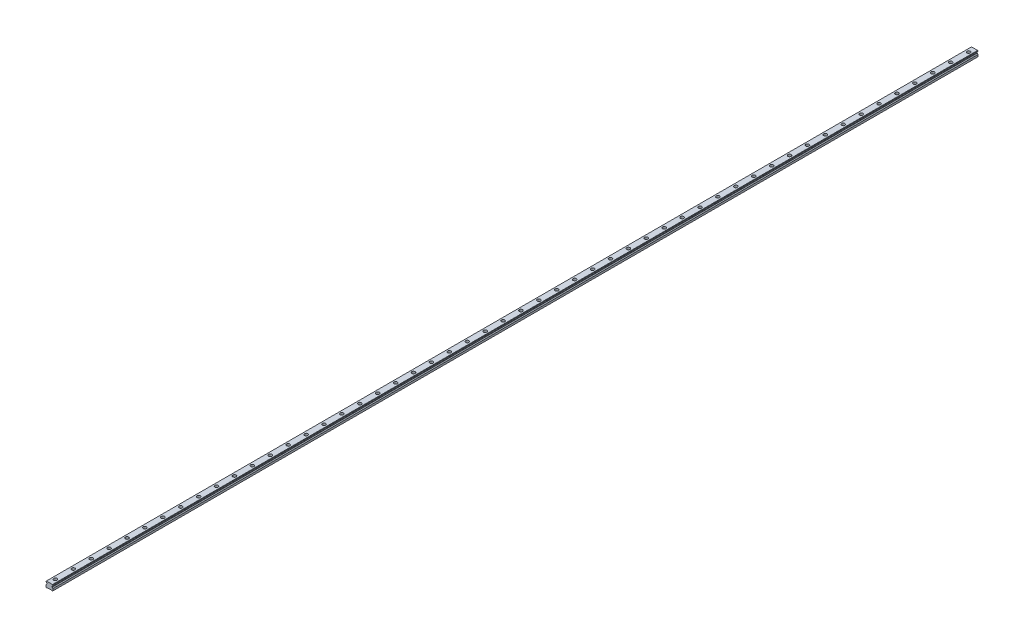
ISO-10303-21;
HEADER;
FILE_DESCRIPTION(('STEP AP214'),'2;1');
FILE_NAME('part.step','',(''),(''),'','','');
FILE_SCHEMA(('AUTOMOTIVE_DESIGN { 1 0 10303 214 1 1 1 1 }'));
ENDSEC;
DATA;
#1=APPLICATION_CONTEXT('core data for automotive mechanical design processes');
#2=APPLICATION_PROTOCOL_DEFINITION('international standard','automotive_design',2000,#1);
#3=PRODUCT_CONTEXT('',#1,'mechanical');
#4=PRODUCT('Part','Part','',(#3));
#5=PRODUCT_RELATED_PRODUCT_CATEGORY('part','',(#4));
#6=PRODUCT_DEFINITION_FORMATION('','',#4);
#7=PRODUCT_DEFINITION_CONTEXT('part definition',#1,'design');
#8=PRODUCT_DEFINITION('design','',#6,#7);
#9=PRODUCT_DEFINITION_SHAPE('','',#8);
#10=(LENGTH_UNIT() NAMED_UNIT(*) SI_UNIT(.MILLI.,.METRE.));
#11=(NAMED_UNIT(*) PLANE_ANGLE_UNIT() SI_UNIT($,.RADIAN.));
#12=(NAMED_UNIT(*) SI_UNIT($,.STERADIAN.) SOLID_ANGLE_UNIT());
#13=UNCERTAINTY_MEASURE_WITH_UNIT(LENGTH_MEASURE(1.E-05),#10,'distance_accuracy_value','');
#14=(GEOMETRIC_REPRESENTATION_CONTEXT(3) GLOBAL_UNCERTAINTY_ASSIGNED_CONTEXT((#13)) GLOBAL_UNIT_ASSIGNED_CONTEXT((#10,
#11,#12)) REPRESENTATION_CONTEXT('',''));
#15=CARTESIAN_POINT('',(0.,0.,0.));
#16=DIRECTION('',(0.,0.,1.));
#17=DIRECTION('',(1.,0.,0.));
#18=AXIS2_PLACEMENT_3D('',#15,#16,#17);
#19=CARTESIAN_POINT('',(0.,10.2,-1530.));
#20=DIRECTION('',(0.,1.,0.));
#21=DIRECTION('',(0.,0.,1.));
#22=AXIS2_PLACEMENT_3D('',#19,#20,#21);
#23=PLANE('',#22);
#24=CARTESIAN_POINT('',(0.,10.2,-1530.));
#25=DIRECTION('',(0.,1.,0.));
#26=DIRECTION('',(0.,0.,1.));
#27=AXIS2_PLACEMENT_3D('',#24,#25,#26);
#28=CIRCLE('',#27,3.49999999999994);
#29=CARTESIAN_POINT('',(0.,10.2,-1526.5));
#30=VERTEX_POINT('',#29);
#31=EDGE_CURVE('E758',#30,#30,#28,.T.);
#32=ORIENTED_EDGE('',*,*,#31,.F.);
#33=EDGE_LOOP('',(#32));
#34=FACE_BOUND('',#33,.T.);
#35=CARTESIAN_POINT('',(0.,10.2,-1530.));
#36=DIRECTION('',(0.,1.,0.));
#37=DIRECTION('',(0.,0.,1.));
#38=AXIS2_PLACEMENT_3D('',#35,#36,#37);
#39=CIRCLE('',#38,5.49999999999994);
#40=CARTESIAN_POINT('',(0.,10.2,-1524.5));
#41=VERTEX_POINT('',#40);
#42=EDGE_CURVE('E11',#41,#41,#39,.T.);
#43=ORIENTED_EDGE('',*,*,#42,.T.);
#44=EDGE_LOOP('',(#43));
#45=FACE_BOUND('',#44,.T.);
#46=ADVANCED_FACE('F39',(#34,#45),#23,.T.);
#47=CARTESIAN_POINT('',(0.,10.2,-1530.));
#48=DIRECTION('',(0.,1.,0.));
#49=DIRECTION('',(0.,0.,1.));
#50=AXIS2_PLACEMENT_3D('',#47,#48,#49);
#51=CYLINDRICAL_SURFACE('',#50,5.49999999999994);
#52=ORIENTED_EDGE('',*,*,#42,.F.);
#53=EDGE_LOOP('',(#52));
#54=FACE_BOUND('',#53,.T.);
#55=CARTESIAN_POINT('',(0.,19.2,-1530.));
#56=DIRECTION('',(0.,1.,0.));
#57=DIRECTION('',(0.,0.,1.));
#58=AXIS2_PLACEMENT_3D('',#55,#56,#57);
#59=CIRCLE('',#58,5.49999999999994);
#60=CARTESIAN_POINT('',(0.,19.2,-1524.5));
#61=VERTEX_POINT('',#60);
#62=EDGE_CURVE('E48',#61,#61,#59,.T.);
#63=ORIENTED_EDGE('',*,*,#62,.T.);
#64=EDGE_LOOP('',(#63));
#65=FACE_BOUND('',#64,.T.);
#66=ADVANCED_FACE('F1328',(#54,#65),#51,.F.);
#67=CARTESIAN_POINT('',(0.,10.2,-1470.));
#68=DIRECTION('',(0.,1.,0.));
#69=DIRECTION('',(0.,0.,1.));
#70=AXIS2_PLACEMENT_3D('',#67,#68,#69);
#71=PLANE('',#70);
#72=CARTESIAN_POINT('',(0.,10.2,-1470.));
#73=DIRECTION('',(0.,1.,0.));
#74=DIRECTION('',(0.,0.,1.));
#75=AXIS2_PLACEMENT_3D('',#72,#73,#74);
#76=CIRCLE('',#75,3.49999999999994);
#77=CARTESIAN_POINT('',(0.,10.2,-1466.5));
#78=VERTEX_POINT('',#77);
#79=EDGE_CURVE('E763',#78,#78,#76,.T.);
#80=ORIENTED_EDGE('',*,*,#79,.F.);
#81=EDGE_LOOP('',(#80));
#82=FACE_BOUND('',#81,.T.);
#83=CARTESIAN_POINT('',(0.,10.2,-1470.));
#84=DIRECTION('',(0.,1.,0.));
#85=DIRECTION('',(0.,0.,1.));
#86=AXIS2_PLACEMENT_3D('',#83,#84,#85);
#87=CIRCLE('',#86,5.49999999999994);
#88=CARTESIAN_POINT('',(0.,10.2,-1464.5));
#89=VERTEX_POINT('',#88);
#90=EDGE_CURVE('E742',#89,#89,#87,.T.);
#91=ORIENTED_EDGE('',*,*,#90,.T.);
#92=EDGE_LOOP('',(#91));
#93=FACE_BOUND('',#92,.T.);
#94=ADVANCED_FACE('F1330',(#82,#93),#71,.T.);
#95=CARTESIAN_POINT('',(0.,10.2,-1470.));
#96=DIRECTION('',(0.,1.,0.));
#97=DIRECTION('',(0.,0.,1.));
#98=AXIS2_PLACEMENT_3D('',#95,#96,#97);
#99=CYLINDRICAL_SURFACE('',#98,5.49999999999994);
#100=ORIENTED_EDGE('',*,*,#90,.F.);
#101=EDGE_LOOP('',(#100));
#102=FACE_BOUND('',#101,.T.);
#103=CARTESIAN_POINT('',(0.,19.2,-1470.));
#104=DIRECTION('',(0.,1.,0.));
#105=DIRECTION('',(0.,0.,1.));
#106=AXIS2_PLACEMENT_3D('',#103,#104,#105);
#107=CIRCLE('',#106,5.49999999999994);
#108=CARTESIAN_POINT('',(0.,19.2,-1464.5));
#109=VERTEX_POINT('',#108);
#110=EDGE_CURVE('E738',#109,#109,#107,.T.);
#111=ORIENTED_EDGE('',*,*,#110,.T.);
#112=EDGE_LOOP('',(#111));
#113=FACE_BOUND('',#112,.T.);
#114=ADVANCED_FACE('F1336',(#102,#113),#99,.F.);
#115=CARTESIAN_POINT('',(0.,10.2,-1410.));
#116=DIRECTION('',(0.,1.,0.));
#117=DIRECTION('',(0.,0.,1.));
#118=AXIS2_PLACEMENT_3D('',#115,#116,#117);
#119=PLANE('',#118);
#120=CARTESIAN_POINT('',(0.,10.2,-1410.));
#121=DIRECTION('',(0.,1.,0.));
#122=DIRECTION('',(0.,0.,1.));
#123=AXIS2_PLACEMENT_3D('',#120,#121,#122);
#124=CIRCLE('',#123,3.49999999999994);
#125=CARTESIAN_POINT('',(0.,10.2,-1406.5));
#126=VERTEX_POINT('',#125);
#127=EDGE_CURVE('E768',#126,#126,#124,.T.);
#128=ORIENTED_EDGE('',*,*,#127,.F.);
#129=EDGE_LOOP('',(#128));
#130=FACE_BOUND('',#129,.T.);
#131=CARTESIAN_POINT('',(0.,10.2,-1410.));
#132=DIRECTION('',(0.,1.,0.));
#133=DIRECTION('',(0.,0.,1.));
#134=AXIS2_PLACEMENT_3D('',#131,#132,#133);
#135=CIRCLE('',#134,5.49999999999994);
#136=CARTESIAN_POINT('',(0.,10.2,-1404.5));
#137=VERTEX_POINT('',#136);
#138=EDGE_CURVE('E734',#137,#137,#135,.T.);
#139=ORIENTED_EDGE('',*,*,#138,.T.);
#140=EDGE_LOOP('',(#139));
#141=FACE_BOUND('',#140,.T.);
#142=ADVANCED_FACE('F1344',(#130,#141),#119,.T.);
#143=CARTESIAN_POINT('',(0.,10.2,-1410.));
#144=DIRECTION('',(0.,1.,0.));
#145=DIRECTION('',(0.,0.,1.));
#146=AXIS2_PLACEMENT_3D('',#143,#144,#145);
#147=CYLINDRICAL_SURFACE('',#146,5.49999999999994);
#148=ORIENTED_EDGE('',*,*,#138,.F.);
#149=EDGE_LOOP('',(#148));
#150=FACE_BOUND('',#149,.T.);
#151=CARTESIAN_POINT('',(0.,19.2,-1410.));
#152=DIRECTION('',(0.,1.,0.));
#153=DIRECTION('',(0.,0.,1.));
#154=AXIS2_PLACEMENT_3D('',#151,#152,#153);
#155=CIRCLE('',#154,5.49999999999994);
#156=CARTESIAN_POINT('',(0.,19.2,-1404.5));
#157=VERTEX_POINT('',#156);
#158=EDGE_CURVE('E730',#157,#157,#155,.T.);
#159=ORIENTED_EDGE('',*,*,#158,.T.);
#160=EDGE_LOOP('',(#159));
#161=FACE_BOUND('',#160,.T.);
#162=ADVANCED_FACE('F1348',(#150,#161),#147,.F.);
#163=CARTESIAN_POINT('',(0.,10.2,-1350.));
#164=DIRECTION('',(0.,1.,0.));
#165=DIRECTION('',(0.,0.,1.));
#166=AXIS2_PLACEMENT_3D('',#163,#164,#165);
#167=PLANE('',#166);
#168=CARTESIAN_POINT('',(0.,10.2,-1350.));
#169=DIRECTION('',(0.,1.,0.));
#170=DIRECTION('',(0.,0.,1.));
#171=AXIS2_PLACEMENT_3D('',#168,#169,#170);
#172=CIRCLE('',#171,3.49999999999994);
#173=CARTESIAN_POINT('',(0.,10.2,-1346.5));
#174=VERTEX_POINT('',#173);
#175=EDGE_CURVE('E773',#174,#174,#172,.T.);
#176=ORIENTED_EDGE('',*,*,#175,.F.);
#177=EDGE_LOOP('',(#176));
#178=FACE_BOUND('',#177,.T.);
#179=CARTESIAN_POINT('',(0.,10.2,-1350.));
#180=DIRECTION('',(0.,1.,0.));
#181=DIRECTION('',(0.,0.,1.));
#182=AXIS2_PLACEMENT_3D('',#179,#180,#181);
#183=CIRCLE('',#182,5.49999999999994);
#184=CARTESIAN_POINT('',(0.,10.2,-1344.5));
#185=VERTEX_POINT('',#184);
#186=EDGE_CURVE('E726',#185,#185,#183,.T.);
#187=ORIENTED_EDGE('',*,*,#186,.T.);
#188=EDGE_LOOP('',(#187));
#189=FACE_BOUND('',#188,.T.);
#190=ADVANCED_FACE('F1352',(#178,#189),#167,.T.);
#191=CARTESIAN_POINT('',(0.,10.2,-1350.));
#192=DIRECTION('',(0.,1.,0.));
#193=DIRECTION('',(0.,0.,1.));
#194=AXIS2_PLACEMENT_3D('',#191,#192,#193);
#195=CYLINDRICAL_SURFACE('',#194,5.49999999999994);
#196=ORIENTED_EDGE('',*,*,#186,.F.);
#197=EDGE_LOOP('',(#196));
#198=FACE_BOUND('',#197,.T.);
#199=CARTESIAN_POINT('',(0.,19.2,-1350.));
#200=DIRECTION('',(0.,1.,0.));
#201=DIRECTION('',(0.,0.,1.));
#202=AXIS2_PLACEMENT_3D('',#199,#200,#201);
#203=CIRCLE('',#202,5.49999999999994);
#204=CARTESIAN_POINT('',(0.,19.2,-1344.5));
#205=VERTEX_POINT('',#204);
#206=EDGE_CURVE('E722',#205,#205,#203,.T.);
#207=ORIENTED_EDGE('',*,*,#206,.T.);
#208=EDGE_LOOP('',(#207));
#209=FACE_BOUND('',#208,.T.);
#210=ADVANCED_FACE('F1356',(#198,#209),#195,.F.);
#211=CARTESIAN_POINT('',(0.,10.2,-1290.));
#212=DIRECTION('',(0.,1.,0.));
#213=DIRECTION('',(0.,0.,1.));
#214=AXIS2_PLACEMENT_3D('',#211,#212,#213);
#215=PLANE('',#214);
#216=CARTESIAN_POINT('',(0.,10.2,-1290.));
#217=DIRECTION('',(0.,1.,0.));
#218=DIRECTION('',(0.,0.,1.));
#219=AXIS2_PLACEMENT_3D('',#216,#217,#218);
#220=CIRCLE('',#219,3.49999999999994);
#221=CARTESIAN_POINT('',(0.,10.2,-1286.5));
#222=VERTEX_POINT('',#221);
#223=EDGE_CURVE('E778',#222,#222,#220,.T.);
#224=ORIENTED_EDGE('',*,*,#223,.F.);
#225=EDGE_LOOP('',(#224));
#226=FACE_BOUND('',#225,.T.);
#227=CARTESIAN_POINT('',(0.,10.2,-1290.));
#228=DIRECTION('',(0.,1.,0.));
#229=DIRECTION('',(0.,0.,1.));
#230=AXIS2_PLACEMENT_3D('',#227,#228,#229);
#231=CIRCLE('',#230,5.49999999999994);
#232=CARTESIAN_POINT('',(0.,10.2,-1284.5));
#233=VERTEX_POINT('',#232);
#234=EDGE_CURVE('E718',#233,#233,#231,.T.);
#235=ORIENTED_EDGE('',*,*,#234,.T.);
#236=EDGE_LOOP('',(#235));
#237=FACE_BOUND('',#236,.T.);
#238=ADVANCED_FACE('F1360',(#226,#237),#215,.T.);
#239=CARTESIAN_POINT('',(0.,10.2,-1290.));
#240=DIRECTION('',(0.,1.,0.));
#241=DIRECTION('',(0.,0.,1.));
#242=AXIS2_PLACEMENT_3D('',#239,#240,#241);
#243=CYLINDRICAL_SURFACE('',#242,5.49999999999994);
#244=ORIENTED_EDGE('',*,*,#234,.F.);
#245=EDGE_LOOP('',(#244));
#246=FACE_BOUND('',#245,.T.);
#247=CARTESIAN_POINT('',(0.,19.2,-1290.));
#248=DIRECTION('',(0.,1.,0.));
#249=DIRECTION('',(0.,0.,1.));
#250=AXIS2_PLACEMENT_3D('',#247,#248,#249);
#251=CIRCLE('',#250,5.49999999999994);
#252=CARTESIAN_POINT('',(0.,19.2,-1284.5));
#253=VERTEX_POINT('',#252);
#254=EDGE_CURVE('E714',#253,#253,#251,.T.);
#255=ORIENTED_EDGE('',*,*,#254,.T.);
#256=EDGE_LOOP('',(#255));
#257=FACE_BOUND('',#256,.T.);
#258=ADVANCED_FACE('F1364',(#246,#257),#243,.F.);
#259=CARTESIAN_POINT('',(0.,10.2,-1230.));
#260=DIRECTION('',(0.,1.,0.));
#261=DIRECTION('',(0.,0.,1.));
#262=AXIS2_PLACEMENT_3D('',#259,#260,#261);
#263=PLANE('',#262);
#264=CARTESIAN_POINT('',(0.,10.2,-1230.));
#265=DIRECTION('',(0.,1.,0.));
#266=DIRECTION('',(0.,0.,1.));
#267=AXIS2_PLACEMENT_3D('',#264,#265,#266);
#268=CIRCLE('',#267,3.49999999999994);
#269=CARTESIAN_POINT('',(0.,10.2,-1226.5));
#270=VERTEX_POINT('',#269);
#271=EDGE_CURVE('E783',#270,#270,#268,.T.);
#272=ORIENTED_EDGE('',*,*,#271,.F.);
#273=EDGE_LOOP('',(#272));
#274=FACE_BOUND('',#273,.T.);
#275=CARTESIAN_POINT('',(0.,10.2,-1230.));
#276=DIRECTION('',(0.,1.,0.));
#277=DIRECTION('',(0.,0.,1.));
#278=AXIS2_PLACEMENT_3D('',#275,#276,#277);
#279=CIRCLE('',#278,5.49999999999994);
#280=CARTESIAN_POINT('',(0.,10.2,-1224.5));
#281=VERTEX_POINT('',#280);
#282=EDGE_CURVE('E710',#281,#281,#279,.T.);
#283=ORIENTED_EDGE('',*,*,#282,.T.);
#284=EDGE_LOOP('',(#283));
#285=FACE_BOUND('',#284,.T.);
#286=ADVANCED_FACE('F1368',(#274,#285),#263,.T.);
#287=CARTESIAN_POINT('',(0.,10.2,-1230.));
#288=DIRECTION('',(0.,1.,0.));
#289=DIRECTION('',(0.,0.,1.));
#290=AXIS2_PLACEMENT_3D('',#287,#288,#289);
#291=CYLINDRICAL_SURFACE('',#290,5.49999999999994);
#292=ORIENTED_EDGE('',*,*,#282,.F.);
#293=EDGE_LOOP('',(#292));
#294=FACE_BOUND('',#293,.T.);
#295=CARTESIAN_POINT('',(0.,19.2,-1230.));
#296=DIRECTION('',(0.,1.,0.));
#297=DIRECTION('',(0.,0.,1.));
#298=AXIS2_PLACEMENT_3D('',#295,#296,#297);
#299=CIRCLE('',#298,5.49999999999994);
#300=CARTESIAN_POINT('',(0.,19.2,-1224.5));
#301=VERTEX_POINT('',#300);
#302=EDGE_CURVE('E706',#301,#301,#299,.T.);
#303=ORIENTED_EDGE('',*,*,#302,.T.);
#304=EDGE_LOOP('',(#303));
#305=FACE_BOUND('',#304,.T.);
#306=ADVANCED_FACE('F1372',(#294,#305),#291,.F.);
#307=CARTESIAN_POINT('',(0.,10.2,-1170.));
#308=DIRECTION('',(0.,1.,0.));
#309=DIRECTION('',(0.,0.,1.));
#310=AXIS2_PLACEMENT_3D('',#307,#308,#309);
#311=PLANE('',#310);
#312=CARTESIAN_POINT('',(0.,10.2,-1170.));
#313=DIRECTION('',(0.,1.,0.));
#314=DIRECTION('',(0.,0.,1.));
#315=AXIS2_PLACEMENT_3D('',#312,#313,#314);
#316=CIRCLE('',#315,3.49999999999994);
#317=CARTESIAN_POINT('',(0.,10.2,-1166.5));
#318=VERTEX_POINT('',#317);
#319=EDGE_CURVE('E788',#318,#318,#316,.T.);
#320=ORIENTED_EDGE('',*,*,#319,.F.);
#321=EDGE_LOOP('',(#320));
#322=FACE_BOUND('',#321,.T.);
#323=CARTESIAN_POINT('',(0.,10.2,-1170.));
#324=DIRECTION('',(0.,1.,0.));
#325=DIRECTION('',(0.,0.,1.));
#326=AXIS2_PLACEMENT_3D('',#323,#324,#325);
#327=CIRCLE('',#326,5.49999999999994);
#328=CARTESIAN_POINT('',(0.,10.2,-1164.5));
#329=VERTEX_POINT('',#328);
#330=EDGE_CURVE('E702',#329,#329,#327,.T.);
#331=ORIENTED_EDGE('',*,*,#330,.T.);
#332=EDGE_LOOP('',(#331));
#333=FACE_BOUND('',#332,.T.);
#334=ADVANCED_FACE('F1376',(#322,#333),#311,.T.);
#335=CARTESIAN_POINT('',(0.,10.2,-1170.));
#336=DIRECTION('',(0.,1.,0.));
#337=DIRECTION('',(0.,0.,1.));
#338=AXIS2_PLACEMENT_3D('',#335,#336,#337);
#339=CYLINDRICAL_SURFACE('',#338,5.49999999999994);
#340=ORIENTED_EDGE('',*,*,#330,.F.);
#341=EDGE_LOOP('',(#340));
#342=FACE_BOUND('',#341,.T.);
#343=CARTESIAN_POINT('',(0.,19.2,-1170.));
#344=DIRECTION('',(0.,1.,0.));
#345=DIRECTION('',(0.,0.,1.));
#346=AXIS2_PLACEMENT_3D('',#343,#344,#345);
#347=CIRCLE('',#346,5.49999999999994);
#348=CARTESIAN_POINT('',(0.,19.2,-1164.5));
#349=VERTEX_POINT('',#348);
#350=EDGE_CURVE('E698',#349,#349,#347,.T.);
#351=ORIENTED_EDGE('',*,*,#350,.T.);
#352=EDGE_LOOP('',(#351));
#353=FACE_BOUND('',#352,.T.);
#354=ADVANCED_FACE('F1380',(#342,#353),#339,.F.);
#355=CARTESIAN_POINT('',(0.,10.2,-1110.));
#356=DIRECTION('',(0.,1.,0.));
#357=DIRECTION('',(0.,0.,1.));
#358=AXIS2_PLACEMENT_3D('',#355,#356,#357);
#359=PLANE('',#358);
#360=CARTESIAN_POINT('',(0.,10.2,-1110.));
#361=DIRECTION('',(0.,1.,0.));
#362=DIRECTION('',(0.,0.,1.));
#363=AXIS2_PLACEMENT_3D('',#360,#361,#362);
#364=CIRCLE('',#363,3.49999999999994);
#365=CARTESIAN_POINT('',(0.,10.2,-1106.5));
#366=VERTEX_POINT('',#365);
#367=EDGE_CURVE('E793',#366,#366,#364,.T.);
#368=ORIENTED_EDGE('',*,*,#367,.F.);
#369=EDGE_LOOP('',(#368));
#370=FACE_BOUND('',#369,.T.);
#371=CARTESIAN_POINT('',(0.,10.2,-1110.));
#372=DIRECTION('',(0.,1.,0.));
#373=DIRECTION('',(0.,0.,1.));
#374=AXIS2_PLACEMENT_3D('',#371,#372,#373);
#375=CIRCLE('',#374,5.49999999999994);
#376=CARTESIAN_POINT('',(0.,10.2,-1104.5));
#377=VERTEX_POINT('',#376);
#378=EDGE_CURVE('E694',#377,#377,#375,.T.);
#379=ORIENTED_EDGE('',*,*,#378,.T.);
#380=EDGE_LOOP('',(#379));
#381=FACE_BOUND('',#380,.T.);
#382=ADVANCED_FACE('F1384',(#370,#381),#359,.T.);
#383=CARTESIAN_POINT('',(0.,10.2,-1110.));
#384=DIRECTION('',(0.,1.,0.));
#385=DIRECTION('',(0.,0.,1.));
#386=AXIS2_PLACEMENT_3D('',#383,#384,#385);
#387=CYLINDRICAL_SURFACE('',#386,5.49999999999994);
#388=ORIENTED_EDGE('',*,*,#378,.F.);
#389=EDGE_LOOP('',(#388));
#390=FACE_BOUND('',#389,.T.);
#391=CARTESIAN_POINT('',(0.,19.2,-1110.));
#392=DIRECTION('',(0.,1.,0.));
#393=DIRECTION('',(0.,0.,1.));
#394=AXIS2_PLACEMENT_3D('',#391,#392,#393);
#395=CIRCLE('',#394,5.49999999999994);
#396=CARTESIAN_POINT('',(0.,19.2,-1104.5));
#397=VERTEX_POINT('',#396);
#398=EDGE_CURVE('E690',#397,#397,#395,.T.);
#399=ORIENTED_EDGE('',*,*,#398,.T.);
#400=EDGE_LOOP('',(#399));
#401=FACE_BOUND('',#400,.T.);
#402=ADVANCED_FACE('F1388',(#390,#401),#387,.F.);
#403=CARTESIAN_POINT('',(0.,10.2,-1050.));
#404=DIRECTION('',(0.,1.,0.));
#405=DIRECTION('',(0.,0.,1.));
#406=AXIS2_PLACEMENT_3D('',#403,#404,#405);
#407=PLANE('',#406);
#408=CARTESIAN_POINT('',(0.,10.2,-1050.));
#409=DIRECTION('',(0.,1.,0.));
#410=DIRECTION('',(0.,0.,1.));
#411=AXIS2_PLACEMENT_3D('',#408,#409,#410);
#412=CIRCLE('',#411,3.49999999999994);
#413=CARTESIAN_POINT('',(0.,10.2,-1046.5));
#414=VERTEX_POINT('',#413);
#415=EDGE_CURVE('E798',#414,#414,#412,.T.);
#416=ORIENTED_EDGE('',*,*,#415,.F.);
#417=EDGE_LOOP('',(#416));
#418=FACE_BOUND('',#417,.T.);
#419=CARTESIAN_POINT('',(0.,10.2,-1050.));
#420=DIRECTION('',(0.,1.,0.));
#421=DIRECTION('',(0.,0.,1.));
#422=AXIS2_PLACEMENT_3D('',#419,#420,#421);
#423=CIRCLE('',#422,5.49999999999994);
#424=CARTESIAN_POINT('',(0.,10.2,-1044.5));
#425=VERTEX_POINT('',#424);
#426=EDGE_CURVE('E686',#425,#425,#423,.T.);
#427=ORIENTED_EDGE('',*,*,#426,.T.);
#428=EDGE_LOOP('',(#427));
#429=FACE_BOUND('',#428,.T.);
#430=ADVANCED_FACE('F1392',(#418,#429),#407,.T.);
#431=CARTESIAN_POINT('',(0.,10.2,-1050.));
#432=DIRECTION('',(0.,1.,0.));
#433=DIRECTION('',(0.,0.,1.));
#434=AXIS2_PLACEMENT_3D('',#431,#432,#433);
#435=CYLINDRICAL_SURFACE('',#434,5.49999999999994);
#436=ORIENTED_EDGE('',*,*,#426,.F.);
#437=EDGE_LOOP('',(#436));
#438=FACE_BOUND('',#437,.T.);
#439=CARTESIAN_POINT('',(0.,19.2,-1050.));
#440=DIRECTION('',(0.,1.,0.));
#441=DIRECTION('',(0.,0.,1.));
#442=AXIS2_PLACEMENT_3D('',#439,#440,#441);
#443=CIRCLE('',#442,5.49999999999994);
#444=CARTESIAN_POINT('',(0.,19.2,-1044.5));
#445=VERTEX_POINT('',#444);
#446=EDGE_CURVE('E682',#445,#445,#443,.T.);
#447=ORIENTED_EDGE('',*,*,#446,.T.);
#448=EDGE_LOOP('',(#447));
#449=FACE_BOUND('',#448,.T.);
#450=ADVANCED_FACE('F1396',(#438,#449),#435,.F.);
#451=CARTESIAN_POINT('',(0.,10.2,-990.));
#452=DIRECTION('',(0.,1.,0.));
#453=DIRECTION('',(0.,0.,1.));
#454=AXIS2_PLACEMENT_3D('',#451,#452,#453);
#455=PLANE('',#454);
#456=CARTESIAN_POINT('',(0.,10.2,-990.));
#457=DIRECTION('',(0.,1.,0.));
#458=DIRECTION('',(0.,0.,1.));
#459=AXIS2_PLACEMENT_3D('',#456,#457,#458);
#460=CIRCLE('',#459,3.49999999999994);
#461=CARTESIAN_POINT('',(0.,10.2,-986.5));
#462=VERTEX_POINT('',#461);
#463=EDGE_CURVE('E803',#462,#462,#460,.T.);
#464=ORIENTED_EDGE('',*,*,#463,.F.);
#465=EDGE_LOOP('',(#464));
#466=FACE_BOUND('',#465,.T.);
#467=CARTESIAN_POINT('',(0.,10.2,-990.));
#468=DIRECTION('',(0.,1.,0.));
#469=DIRECTION('',(0.,0.,1.));
#470=AXIS2_PLACEMENT_3D('',#467,#468,#469);
#471=CIRCLE('',#470,5.49999999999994);
#472=CARTESIAN_POINT('',(0.,10.2,-984.5));
#473=VERTEX_POINT('',#472);
#474=EDGE_CURVE('E678',#473,#473,#471,.T.);
#475=ORIENTED_EDGE('',*,*,#474,.T.);
#476=EDGE_LOOP('',(#475));
#477=FACE_BOUND('',#476,.T.);
#478=ADVANCED_FACE('F1400',(#466,#477),#455,.T.);
#479=CARTESIAN_POINT('',(0.,10.2,-990.));
#480=DIRECTION('',(0.,1.,0.));
#481=DIRECTION('',(0.,0.,1.));
#482=AXIS2_PLACEMENT_3D('',#479,#480,#481);
#483=CYLINDRICAL_SURFACE('',#482,5.49999999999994);
#484=ORIENTED_EDGE('',*,*,#474,.F.);
#485=EDGE_LOOP('',(#484));
#486=FACE_BOUND('',#485,.T.);
#487=CARTESIAN_POINT('',(0.,19.2,-990.));
#488=DIRECTION('',(0.,1.,0.));
#489=DIRECTION('',(0.,0.,1.));
#490=AXIS2_PLACEMENT_3D('',#487,#488,#489);
#491=CIRCLE('',#490,5.49999999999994);
#492=CARTESIAN_POINT('',(0.,19.2,-984.5));
#493=VERTEX_POINT('',#492);
#494=EDGE_CURVE('E674',#493,#493,#491,.T.);
#495=ORIENTED_EDGE('',*,*,#494,.T.);
#496=EDGE_LOOP('',(#495));
#497=FACE_BOUND('',#496,.T.);
#498=ADVANCED_FACE('F1404',(#486,#497),#483,.F.);
#499=CARTESIAN_POINT('',(0.,10.2,-930.));
#500=DIRECTION('',(0.,1.,0.));
#501=DIRECTION('',(0.,0.,1.));
#502=AXIS2_PLACEMENT_3D('',#499,#500,#501);
#503=PLANE('',#502);
#504=CARTESIAN_POINT('',(0.,10.2,-930.));
#505=DIRECTION('',(0.,1.,0.));
#506=DIRECTION('',(0.,0.,1.));
#507=AXIS2_PLACEMENT_3D('',#504,#505,#506);
#508=CIRCLE('',#507,3.49999999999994);
#509=CARTESIAN_POINT('',(0.,10.2,-926.5));
#510=VERTEX_POINT('',#509);
#511=EDGE_CURVE('E808',#510,#510,#508,.T.);
#512=ORIENTED_EDGE('',*,*,#511,.F.);
#513=EDGE_LOOP('',(#512));
#514=FACE_BOUND('',#513,.T.);
#515=CARTESIAN_POINT('',(0.,10.2,-930.));
#516=DIRECTION('',(0.,1.,0.));
#517=DIRECTION('',(0.,0.,1.));
#518=AXIS2_PLACEMENT_3D('',#515,#516,#517);
#519=CIRCLE('',#518,5.49999999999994);
#520=CARTESIAN_POINT('',(0.,10.2,-924.5));
#521=VERTEX_POINT('',#520);
#522=EDGE_CURVE('E670',#521,#521,#519,.T.);
#523=ORIENTED_EDGE('',*,*,#522,.T.);
#524=EDGE_LOOP('',(#523));
#525=FACE_BOUND('',#524,.T.);
#526=ADVANCED_FACE('F1408',(#514,#525),#503,.T.);
#527=CARTESIAN_POINT('',(0.,10.2,-930.));
#528=DIRECTION('',(0.,1.,0.));
#529=DIRECTION('',(0.,0.,1.));
#530=AXIS2_PLACEMENT_3D('',#527,#528,#529);
#531=CYLINDRICAL_SURFACE('',#530,5.49999999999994);
#532=ORIENTED_EDGE('',*,*,#522,.F.);
#533=EDGE_LOOP('',(#532));
#534=FACE_BOUND('',#533,.T.);
#535=CARTESIAN_POINT('',(0.,19.2,-930.));
#536=DIRECTION('',(0.,1.,0.));
#537=DIRECTION('',(0.,0.,1.));
#538=AXIS2_PLACEMENT_3D('',#535,#536,#537);
#539=CIRCLE('',#538,5.49999999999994);
#540=CARTESIAN_POINT('',(0.,19.2,-924.5));
#541=VERTEX_POINT('',#540);
#542=EDGE_CURVE('E666',#541,#541,#539,.T.);
#543=ORIENTED_EDGE('',*,*,#542,.T.);
#544=EDGE_LOOP('',(#543));
#545=FACE_BOUND('',#544,.T.);
#546=ADVANCED_FACE('F1412',(#534,#545),#531,.F.);
#547=CARTESIAN_POINT('',(0.,10.2,-870.));
#548=DIRECTION('',(0.,1.,0.));
#549=DIRECTION('',(0.,0.,1.));
#550=AXIS2_PLACEMENT_3D('',#547,#548,#549);
#551=PLANE('',#550);
#552=CARTESIAN_POINT('',(0.,10.2,-870.));
#553=DIRECTION('',(0.,1.,0.));
#554=DIRECTION('',(0.,0.,1.));
#555=AXIS2_PLACEMENT_3D('',#552,#553,#554);
#556=CIRCLE('',#555,3.49999999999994);
#557=CARTESIAN_POINT('',(0.,10.2,-866.5));
#558=VERTEX_POINT('',#557);
#559=EDGE_CURVE('E813',#558,#558,#556,.T.);
#560=ORIENTED_EDGE('',*,*,#559,.F.);
#561=EDGE_LOOP('',(#560));
#562=FACE_BOUND('',#561,.T.);
#563=CARTESIAN_POINT('',(0.,10.2,-870.));
#564=DIRECTION('',(0.,1.,0.));
#565=DIRECTION('',(0.,0.,1.));
#566=AXIS2_PLACEMENT_3D('',#563,#564,#565);
#567=CIRCLE('',#566,5.49999999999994);
#568=CARTESIAN_POINT('',(0.,10.2,-864.5));
#569=VERTEX_POINT('',#568);
#570=EDGE_CURVE('E662',#569,#569,#567,.T.);
#571=ORIENTED_EDGE('',*,*,#570,.T.);
#572=EDGE_LOOP('',(#571));
#573=FACE_BOUND('',#572,.T.);
#574=ADVANCED_FACE('F1416',(#562,#573),#551,.T.);
#575=CARTESIAN_POINT('',(0.,10.2,-870.));
#576=DIRECTION('',(0.,1.,0.));
#577=DIRECTION('',(0.,0.,1.));
#578=AXIS2_PLACEMENT_3D('',#575,#576,#577);
#579=CYLINDRICAL_SURFACE('',#578,5.49999999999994);
#580=ORIENTED_EDGE('',*,*,#570,.F.);
#581=EDGE_LOOP('',(#580));
#582=FACE_BOUND('',#581,.T.);
#583=CARTESIAN_POINT('',(0.,19.2,-870.));
#584=DIRECTION('',(0.,1.,0.));
#585=DIRECTION('',(0.,0.,1.));
#586=AXIS2_PLACEMENT_3D('',#583,#584,#585);
#587=CIRCLE('',#586,5.49999999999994);
#588=CARTESIAN_POINT('',(0.,19.2,-864.5));
#589=VERTEX_POINT('',#588);
#590=EDGE_CURVE('E658',#589,#589,#587,.T.);
#591=ORIENTED_EDGE('',*,*,#590,.T.);
#592=EDGE_LOOP('',(#591));
#593=FACE_BOUND('',#592,.T.);
#594=ADVANCED_FACE('F1420',(#582,#593),#579,.F.);
#595=CARTESIAN_POINT('',(0.,10.2,-810.));
#596=DIRECTION('',(0.,1.,0.));
#597=DIRECTION('',(0.,0.,1.));
#598=AXIS2_PLACEMENT_3D('',#595,#596,#597);
#599=PLANE('',#598);
#600=CARTESIAN_POINT('',(0.,10.2,-810.));
#601=DIRECTION('',(0.,1.,0.));
#602=DIRECTION('',(0.,0.,1.));
#603=AXIS2_PLACEMENT_3D('',#600,#601,#602);
#604=CIRCLE('',#603,3.49999999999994);
#605=CARTESIAN_POINT('',(0.,10.2,-806.5));
#606=VERTEX_POINT('',#605);
#607=EDGE_CURVE('E818',#606,#606,#604,.T.);
#608=ORIENTED_EDGE('',*,*,#607,.F.);
#609=EDGE_LOOP('',(#608));
#610=FACE_BOUND('',#609,.T.);
#611=CARTESIAN_POINT('',(0.,10.2,-810.));
#612=DIRECTION('',(0.,1.,0.));
#613=DIRECTION('',(0.,0.,1.));
#614=AXIS2_PLACEMENT_3D('',#611,#612,#613);
#615=CIRCLE('',#614,5.49999999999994);
#616=CARTESIAN_POINT('',(0.,10.2,-804.5));
#617=VERTEX_POINT('',#616);
#618=EDGE_CURVE('E654',#617,#617,#615,.T.);
#619=ORIENTED_EDGE('',*,*,#618,.T.);
#620=EDGE_LOOP('',(#619));
#621=FACE_BOUND('',#620,.T.);
#622=ADVANCED_FACE('F1424',(#610,#621),#599,.T.);
#623=CARTESIAN_POINT('',(0.,10.2,-810.));
#624=DIRECTION('',(0.,1.,0.));
#625=DIRECTION('',(0.,0.,1.));
#626=AXIS2_PLACEMENT_3D('',#623,#624,#625);
#627=CYLINDRICAL_SURFACE('',#626,5.49999999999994);
#628=ORIENTED_EDGE('',*,*,#618,.F.);
#629=EDGE_LOOP('',(#628));
#630=FACE_BOUND('',#629,.T.);
#631=CARTESIAN_POINT('',(0.,19.2,-810.));
#632=DIRECTION('',(0.,1.,0.));
#633=DIRECTION('',(0.,0.,1.));
#634=AXIS2_PLACEMENT_3D('',#631,#632,#633);
#635=CIRCLE('',#634,5.49999999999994);
#636=CARTESIAN_POINT('',(0.,19.2,-804.5));
#637=VERTEX_POINT('',#636);
#638=EDGE_CURVE('E650',#637,#637,#635,.T.);
#639=ORIENTED_EDGE('',*,*,#638,.T.);
#640=EDGE_LOOP('',(#639));
#641=FACE_BOUND('',#640,.T.);
#642=ADVANCED_FACE('F1428',(#630,#641),#627,.F.);
#643=CARTESIAN_POINT('',(0.,10.2,-750.));
#644=DIRECTION('',(0.,1.,0.));
#645=DIRECTION('',(0.,0.,1.));
#646=AXIS2_PLACEMENT_3D('',#643,#644,#645);
#647=PLANE('',#646);
#648=CARTESIAN_POINT('',(0.,10.2,-750.));
#649=DIRECTION('',(0.,1.,0.));
#650=DIRECTION('',(0.,0.,1.));
#651=AXIS2_PLACEMENT_3D('',#648,#649,#650);
#652=CIRCLE('',#651,3.49999999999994);
#653=CARTESIAN_POINT('',(0.,10.2,-746.5));
#654=VERTEX_POINT('',#653);
#655=EDGE_CURVE('E823',#654,#654,#652,.T.);
#656=ORIENTED_EDGE('',*,*,#655,.F.);
#657=EDGE_LOOP('',(#656));
#658=FACE_BOUND('',#657,.T.);
#659=CARTESIAN_POINT('',(0.,10.2,-750.));
#660=DIRECTION('',(0.,1.,0.));
#661=DIRECTION('',(0.,0.,1.));
#662=AXIS2_PLACEMENT_3D('',#659,#660,#661);
#663=CIRCLE('',#662,5.49999999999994);
#664=CARTESIAN_POINT('',(0.,10.2,-744.5));
#665=VERTEX_POINT('',#664);
#666=EDGE_CURVE('E646',#665,#665,#663,.T.);
#667=ORIENTED_EDGE('',*,*,#666,.T.);
#668=EDGE_LOOP('',(#667));
#669=FACE_BOUND('',#668,.T.);
#670=ADVANCED_FACE('F1432',(#658,#669),#647,.T.);
#671=CARTESIAN_POINT('',(0.,10.2,-750.));
#672=DIRECTION('',(0.,1.,0.));
#673=DIRECTION('',(0.,0.,1.));
#674=AXIS2_PLACEMENT_3D('',#671,#672,#673);
#675=CYLINDRICAL_SURFACE('',#674,5.49999999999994);
#676=ORIENTED_EDGE('',*,*,#666,.F.);
#677=EDGE_LOOP('',(#676));
#678=FACE_BOUND('',#677,.T.);
#679=CARTESIAN_POINT('',(0.,19.2,-750.));
#680=DIRECTION('',(0.,1.,0.));
#681=DIRECTION('',(0.,0.,1.));
#682=AXIS2_PLACEMENT_3D('',#679,#680,#681);
#683=CIRCLE('',#682,5.49999999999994);
#684=CARTESIAN_POINT('',(0.,19.2,-744.5));
#685=VERTEX_POINT('',#684);
#686=EDGE_CURVE('E642',#685,#685,#683,.T.);
#687=ORIENTED_EDGE('',*,*,#686,.T.);
#688=EDGE_LOOP('',(#687));
#689=FACE_BOUND('',#688,.T.);
#690=ADVANCED_FACE('F1436',(#678,#689),#675,.F.);
#691=CARTESIAN_POINT('',(0.,10.2,-690.));
#692=DIRECTION('',(0.,1.,0.));
#693=DIRECTION('',(0.,0.,1.));
#694=AXIS2_PLACEMENT_3D('',#691,#692,#693);
#695=PLANE('',#694);
#696=CARTESIAN_POINT('',(0.,10.2,-690.));
#697=DIRECTION('',(0.,1.,0.));
#698=DIRECTION('',(0.,0.,1.));
#699=AXIS2_PLACEMENT_3D('',#696,#697,#698);
#700=CIRCLE('',#699,3.49999999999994);
#701=CARTESIAN_POINT('',(0.,10.2,-686.5));
#702=VERTEX_POINT('',#701);
#703=EDGE_CURVE('E828',#702,#702,#700,.T.);
#704=ORIENTED_EDGE('',*,*,#703,.F.);
#705=EDGE_LOOP('',(#704));
#706=FACE_BOUND('',#705,.T.);
#707=CARTESIAN_POINT('',(0.,10.2,-690.));
#708=DIRECTION('',(0.,1.,0.));
#709=DIRECTION('',(0.,0.,1.));
#710=AXIS2_PLACEMENT_3D('',#707,#708,#709);
#711=CIRCLE('',#710,5.49999999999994);
#712=CARTESIAN_POINT('',(0.,10.2,-684.5));
#713=VERTEX_POINT('',#712);
#714=EDGE_CURVE('E638',#713,#713,#711,.T.);
#715=ORIENTED_EDGE('',*,*,#714,.T.);
#716=EDGE_LOOP('',(#715));
#717=FACE_BOUND('',#716,.T.);
#718=ADVANCED_FACE('F1440',(#706,#717),#695,.T.);
#719=CARTESIAN_POINT('',(0.,10.2,-690.));
#720=DIRECTION('',(0.,1.,0.));
#721=DIRECTION('',(0.,0.,1.));
#722=AXIS2_PLACEMENT_3D('',#719,#720,#721);
#723=CYLINDRICAL_SURFACE('',#722,5.49999999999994);
#724=ORIENTED_EDGE('',*,*,#714,.F.);
#725=EDGE_LOOP('',(#724));
#726=FACE_BOUND('',#725,.T.);
#727=CARTESIAN_POINT('',(0.,19.2,-690.));
#728=DIRECTION('',(0.,1.,0.));
#729=DIRECTION('',(0.,0.,1.));
#730=AXIS2_PLACEMENT_3D('',#727,#728,#729);
#731=CIRCLE('',#730,5.49999999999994);
#732=CARTESIAN_POINT('',(0.,19.2,-684.5));
#733=VERTEX_POINT('',#732);
#734=EDGE_CURVE('E634',#733,#733,#731,.T.);
#735=ORIENTED_EDGE('',*,*,#734,.T.);
#736=EDGE_LOOP('',(#735));
#737=FACE_BOUND('',#736,.T.);
#738=ADVANCED_FACE('F1444',(#726,#737),#723,.F.);
#739=CARTESIAN_POINT('',(0.,10.2,-630.));
#740=DIRECTION('',(0.,1.,0.));
#741=DIRECTION('',(0.,0.,1.));
#742=AXIS2_PLACEMENT_3D('',#739,#740,#741);
#743=PLANE('',#742);
#744=CARTESIAN_POINT('',(0.,10.2,-630.));
#745=DIRECTION('',(0.,1.,0.));
#746=DIRECTION('',(0.,0.,1.));
#747=AXIS2_PLACEMENT_3D('',#744,#745,#746);
#748=CIRCLE('',#747,3.49999999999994);
#749=CARTESIAN_POINT('',(0.,10.2,-626.5));
#750=VERTEX_POINT('',#749);
#751=EDGE_CURVE('E833',#750,#750,#748,.T.);
#752=ORIENTED_EDGE('',*,*,#751,.F.);
#753=EDGE_LOOP('',(#752));
#754=FACE_BOUND('',#753,.T.);
#755=CARTESIAN_POINT('',(0.,10.2,-630.));
#756=DIRECTION('',(0.,1.,0.));
#757=DIRECTION('',(0.,0.,1.));
#758=AXIS2_PLACEMENT_3D('',#755,#756,#757);
#759=CIRCLE('',#758,5.49999999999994);
#760=CARTESIAN_POINT('',(0.,10.2,-624.5));
#761=VERTEX_POINT('',#760);
#762=EDGE_CURVE('E630',#761,#761,#759,.T.);
#763=ORIENTED_EDGE('',*,*,#762,.T.);
#764=EDGE_LOOP('',(#763));
#765=FACE_BOUND('',#764,.T.);
#766=ADVANCED_FACE('F1448',(#754,#765),#743,.T.);
#767=CARTESIAN_POINT('',(0.,10.2,-630.));
#768=DIRECTION('',(0.,1.,0.));
#769=DIRECTION('',(0.,0.,1.));
#770=AXIS2_PLACEMENT_3D('',#767,#768,#769);
#771=CYLINDRICAL_SURFACE('',#770,5.49999999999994);
#772=ORIENTED_EDGE('',*,*,#762,.F.);
#773=EDGE_LOOP('',(#772));
#774=FACE_BOUND('',#773,.T.);
#775=CARTESIAN_POINT('',(0.,19.2,-630.));
#776=DIRECTION('',(0.,1.,0.));
#777=DIRECTION('',(0.,0.,1.));
#778=AXIS2_PLACEMENT_3D('',#775,#776,#777);
#779=CIRCLE('',#778,5.49999999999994);
#780=CARTESIAN_POINT('',(0.,19.2,-624.5));
#781=VERTEX_POINT('',#780);
#782=EDGE_CURVE('E626',#781,#781,#779,.T.);
#783=ORIENTED_EDGE('',*,*,#782,.T.);
#784=EDGE_LOOP('',(#783));
#785=FACE_BOUND('',#784,.T.);
#786=ADVANCED_FACE('F1452',(#774,#785),#771,.F.);
#787=CARTESIAN_POINT('',(0.,10.2,-570.));
#788=DIRECTION('',(0.,1.,0.));
#789=DIRECTION('',(0.,0.,1.));
#790=AXIS2_PLACEMENT_3D('',#787,#788,#789);
#791=PLANE('',#790);
#792=CARTESIAN_POINT('',(0.,10.2,-570.));
#793=DIRECTION('',(0.,1.,0.));
#794=DIRECTION('',(0.,0.,1.));
#795=AXIS2_PLACEMENT_3D('',#792,#793,#794);
#796=CIRCLE('',#795,3.49999999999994);
#797=CARTESIAN_POINT('',(0.,10.2,-566.5));
#798=VERTEX_POINT('',#797);
#799=EDGE_CURVE('E838',#798,#798,#796,.T.);
#800=ORIENTED_EDGE('',*,*,#799,.F.);
#801=EDGE_LOOP('',(#800));
#802=FACE_BOUND('',#801,.T.);
#803=CARTESIAN_POINT('',(0.,10.2,-570.));
#804=DIRECTION('',(0.,1.,0.));
#805=DIRECTION('',(0.,0.,1.));
#806=AXIS2_PLACEMENT_3D('',#803,#804,#805);
#807=CIRCLE('',#806,5.49999999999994);
#808=CARTESIAN_POINT('',(0.,10.2,-564.5));
#809=VERTEX_POINT('',#808);
#810=EDGE_CURVE('E622',#809,#809,#807,.T.);
#811=ORIENTED_EDGE('',*,*,#810,.T.);
#812=EDGE_LOOP('',(#811));
#813=FACE_BOUND('',#812,.T.);
#814=ADVANCED_FACE('F1456',(#802,#813),#791,.T.);
#815=CARTESIAN_POINT('',(0.,10.2,-570.));
#816=DIRECTION('',(0.,1.,0.));
#817=DIRECTION('',(0.,0.,1.));
#818=AXIS2_PLACEMENT_3D('',#815,#816,#817);
#819=CYLINDRICAL_SURFACE('',#818,5.49999999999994);
#820=ORIENTED_EDGE('',*,*,#810,.F.);
#821=EDGE_LOOP('',(#820));
#822=FACE_BOUND('',#821,.T.);
#823=CARTESIAN_POINT('',(0.,19.2,-570.));
#824=DIRECTION('',(0.,1.,0.));
#825=DIRECTION('',(0.,0.,1.));
#826=AXIS2_PLACEMENT_3D('',#823,#824,#825);
#827=CIRCLE('',#826,5.49999999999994);
#828=CARTESIAN_POINT('',(0.,19.2,-564.5));
#829=VERTEX_POINT('',#828);
#830=EDGE_CURVE('E618',#829,#829,#827,.T.);
#831=ORIENTED_EDGE('',*,*,#830,.T.);
#832=EDGE_LOOP('',(#831));
#833=FACE_BOUND('',#832,.T.);
#834=ADVANCED_FACE('F1460',(#822,#833),#819,.F.);
#835=CARTESIAN_POINT('',(0.,10.2,-510.));
#836=DIRECTION('',(0.,1.,0.));
#837=DIRECTION('',(0.,0.,1.));
#838=AXIS2_PLACEMENT_3D('',#835,#836,#837);
#839=PLANE('',#838);
#840=CARTESIAN_POINT('',(0.,10.2,-510.));
#841=DIRECTION('',(0.,1.,0.));
#842=DIRECTION('',(0.,0.,1.));
#843=AXIS2_PLACEMENT_3D('',#840,#841,#842);
#844=CIRCLE('',#843,3.49999999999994);
#845=CARTESIAN_POINT('',(0.,10.2,-506.5));
#846=VERTEX_POINT('',#845);
#847=EDGE_CURVE('E843',#846,#846,#844,.T.);
#848=ORIENTED_EDGE('',*,*,#847,.F.);
#849=EDGE_LOOP('',(#848));
#850=FACE_BOUND('',#849,.T.);
#851=CARTESIAN_POINT('',(0.,10.2,-510.));
#852=DIRECTION('',(0.,1.,0.));
#853=DIRECTION('',(0.,0.,1.));
#854=AXIS2_PLACEMENT_3D('',#851,#852,#853);
#855=CIRCLE('',#854,5.49999999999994);
#856=CARTESIAN_POINT('',(0.,10.2,-504.5));
#857=VERTEX_POINT('',#856);
#858=EDGE_CURVE('E614',#857,#857,#855,.T.);
#859=ORIENTED_EDGE('',*,*,#858,.T.);
#860=EDGE_LOOP('',(#859));
#861=FACE_BOUND('',#860,.T.);
#862=ADVANCED_FACE('F1464',(#850,#861),#839,.T.);
#863=CARTESIAN_POINT('',(0.,10.2,-510.));
#864=DIRECTION('',(0.,1.,0.));
#865=DIRECTION('',(0.,0.,1.));
#866=AXIS2_PLACEMENT_3D('',#863,#864,#865);
#867=CYLINDRICAL_SURFACE('',#866,5.49999999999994);
#868=ORIENTED_EDGE('',*,*,#858,.F.);
#869=EDGE_LOOP('',(#868));
#870=FACE_BOUND('',#869,.T.);
#871=CARTESIAN_POINT('',(0.,19.2,-510.));
#872=DIRECTION('',(0.,1.,0.));
#873=DIRECTION('',(0.,0.,1.));
#874=AXIS2_PLACEMENT_3D('',#871,#872,#873);
#875=CIRCLE('',#874,5.49999999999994);
#876=CARTESIAN_POINT('',(0.,19.2,-504.5));
#877=VERTEX_POINT('',#876);
#878=EDGE_CURVE('E610',#877,#877,#875,.T.);
#879=ORIENTED_EDGE('',*,*,#878,.T.);
#880=EDGE_LOOP('',(#879));
#881=FACE_BOUND('',#880,.T.);
#882=ADVANCED_FACE('F1468',(#870,#881),#867,.F.);
#883=CARTESIAN_POINT('',(0.,10.2,-450.));
#884=DIRECTION('',(0.,1.,0.));
#885=DIRECTION('',(0.,0.,1.));
#886=AXIS2_PLACEMENT_3D('',#883,#884,#885);
#887=PLANE('',#886);
#888=CARTESIAN_POINT('',(0.,10.2,-450.));
#889=DIRECTION('',(0.,1.,0.));
#890=DIRECTION('',(0.,0.,1.));
#891=AXIS2_PLACEMENT_3D('',#888,#889,#890);
#892=CIRCLE('',#891,3.49999999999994);
#893=CARTESIAN_POINT('',(0.,10.2,-446.5));
#894=VERTEX_POINT('',#893);
#895=EDGE_CURVE('E848',#894,#894,#892,.T.);
#896=ORIENTED_EDGE('',*,*,#895,.F.);
#897=EDGE_LOOP('',(#896));
#898=FACE_BOUND('',#897,.T.);
#899=CARTESIAN_POINT('',(0.,10.2,-450.));
#900=DIRECTION('',(0.,1.,0.));
#901=DIRECTION('',(0.,0.,1.));
#902=AXIS2_PLACEMENT_3D('',#899,#900,#901);
#903=CIRCLE('',#902,5.49999999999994);
#904=CARTESIAN_POINT('',(0.,10.2,-444.5));
#905=VERTEX_POINT('',#904);
#906=EDGE_CURVE('E606',#905,#905,#903,.T.);
#907=ORIENTED_EDGE('',*,*,#906,.T.);
#908=EDGE_LOOP('',(#907));
#909=FACE_BOUND('',#908,.T.);
#910=ADVANCED_FACE('F1472',(#898,#909),#887,.T.);
#911=CARTESIAN_POINT('',(0.,10.2,-450.));
#912=DIRECTION('',(0.,1.,0.));
#913=DIRECTION('',(0.,0.,1.));
#914=AXIS2_PLACEMENT_3D('',#911,#912,#913);
#915=CYLINDRICAL_SURFACE('',#914,5.49999999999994);
#916=ORIENTED_EDGE('',*,*,#906,.F.);
#917=EDGE_LOOP('',(#916));
#918=FACE_BOUND('',#917,.T.);
#919=CARTESIAN_POINT('',(0.,19.2,-450.));
#920=DIRECTION('',(0.,1.,0.));
#921=DIRECTION('',(0.,0.,1.));
#922=AXIS2_PLACEMENT_3D('',#919,#920,#921);
#923=CIRCLE('',#922,5.49999999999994);
#924=CARTESIAN_POINT('',(0.,19.2,-444.5));
#925=VERTEX_POINT('',#924);
#926=EDGE_CURVE('E602',#925,#925,#923,.T.);
#927=ORIENTED_EDGE('',*,*,#926,.T.);
#928=EDGE_LOOP('',(#927));
#929=FACE_BOUND('',#928,.T.);
#930=ADVANCED_FACE('F1476',(#918,#929),#915,.F.);
#931=CARTESIAN_POINT('',(0.,10.2,-390.));
#932=DIRECTION('',(0.,1.,0.));
#933=DIRECTION('',(0.,0.,1.));
#934=AXIS2_PLACEMENT_3D('',#931,#932,#933);
#935=PLANE('',#934);
#936=CARTESIAN_POINT('',(0.,10.2,-390.));
#937=DIRECTION('',(0.,1.,0.));
#938=DIRECTION('',(0.,0.,1.));
#939=AXIS2_PLACEMENT_3D('',#936,#937,#938);
#940=CIRCLE('',#939,3.49999999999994);
#941=CARTESIAN_POINT('',(0.,10.2,-386.5));
#942=VERTEX_POINT('',#941);
#943=EDGE_CURVE('E853',#942,#942,#940,.T.);
#944=ORIENTED_EDGE('',*,*,#943,.F.);
#945=EDGE_LOOP('',(#944));
#946=FACE_BOUND('',#945,.T.);
#947=CARTESIAN_POINT('',(0.,10.2,-390.));
#948=DIRECTION('',(0.,1.,0.));
#949=DIRECTION('',(0.,0.,1.));
#950=AXIS2_PLACEMENT_3D('',#947,#948,#949);
#951=CIRCLE('',#950,5.49999999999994);
#952=CARTESIAN_POINT('',(0.,10.2,-384.5));
#953=VERTEX_POINT('',#952);
#954=EDGE_CURVE('E598',#953,#953,#951,.T.);
#955=ORIENTED_EDGE('',*,*,#954,.T.);
#956=EDGE_LOOP('',(#955));
#957=FACE_BOUND('',#956,.T.);
#958=ADVANCED_FACE('F1480',(#946,#957),#935,.T.);
#959=CARTESIAN_POINT('',(0.,10.2,-390.));
#960=DIRECTION('',(0.,1.,0.));
#961=DIRECTION('',(0.,0.,1.));
#962=AXIS2_PLACEMENT_3D('',#959,#960,#961);
#963=CYLINDRICAL_SURFACE('',#962,5.49999999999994);
#964=ORIENTED_EDGE('',*,*,#954,.F.);
#965=EDGE_LOOP('',(#964));
#966=FACE_BOUND('',#965,.T.);
#967=CARTESIAN_POINT('',(0.,19.2,-390.));
#968=DIRECTION('',(0.,1.,0.));
#969=DIRECTION('',(0.,0.,1.));
#970=AXIS2_PLACEMENT_3D('',#967,#968,#969);
#971=CIRCLE('',#970,5.49999999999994);
#972=CARTESIAN_POINT('',(0.,19.2,-384.5));
#973=VERTEX_POINT('',#972);
#974=EDGE_CURVE('E594',#973,#973,#971,.T.);
#975=ORIENTED_EDGE('',*,*,#974,.T.);
#976=EDGE_LOOP('',(#975));
#977=FACE_BOUND('',#976,.T.);
#978=ADVANCED_FACE('F1484',(#966,#977),#963,.F.);
#979=CARTESIAN_POINT('',(0.,10.2,-330.));
#980=DIRECTION('',(0.,1.,0.));
#981=DIRECTION('',(0.,0.,1.));
#982=AXIS2_PLACEMENT_3D('',#979,#980,#981);
#983=PLANE('',#982);
#984=CARTESIAN_POINT('',(0.,10.2,-330.));
#985=DIRECTION('',(0.,1.,0.));
#986=DIRECTION('',(0.,0.,1.));
#987=AXIS2_PLACEMENT_3D('',#984,#985,#986);
#988=CIRCLE('',#987,3.49999999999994);
#989=CARTESIAN_POINT('',(0.,10.2,-326.5));
#990=VERTEX_POINT('',#989);
#991=EDGE_CURVE('E858',#990,#990,#988,.T.);
#992=ORIENTED_EDGE('',*,*,#991,.F.);
#993=EDGE_LOOP('',(#992));
#994=FACE_BOUND('',#993,.T.);
#995=CARTESIAN_POINT('',(0.,10.2,-330.));
#996=DIRECTION('',(0.,1.,0.));
#997=DIRECTION('',(0.,0.,1.));
#998=AXIS2_PLACEMENT_3D('',#995,#996,#997);
#999=CIRCLE('',#998,5.49999999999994);
#1000=CARTESIAN_POINT('',(0.,10.2,-324.5));
#1001=VERTEX_POINT('',#1000);
#1002=EDGE_CURVE('E590',#1001,#1001,#999,.T.);
#1003=ORIENTED_EDGE('',*,*,#1002,.T.);
#1004=EDGE_LOOP('',(#1003));
#1005=FACE_BOUND('',#1004,.T.);
#1006=ADVANCED_FACE('F1488',(#994,#1005),#983,.T.);
#1007=CARTESIAN_POINT('',(0.,10.2,-330.));
#1008=DIRECTION('',(0.,1.,0.));
#1009=DIRECTION('',(0.,0.,1.));
#1010=AXIS2_PLACEMENT_3D('',#1007,#1008,#1009);
#1011=CYLINDRICAL_SURFACE('',#1010,5.49999999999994);
#1012=ORIENTED_EDGE('',*,*,#1002,.F.);
#1013=EDGE_LOOP('',(#1012));
#1014=FACE_BOUND('',#1013,.T.);
#1015=CARTESIAN_POINT('',(0.,19.2,-330.));
#1016=DIRECTION('',(0.,1.,0.));
#1017=DIRECTION('',(0.,0.,1.));
#1018=AXIS2_PLACEMENT_3D('',#1015,#1016,#1017);
#1019=CIRCLE('',#1018,5.49999999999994);
#1020=CARTESIAN_POINT('',(0.,19.2,-324.5));
#1021=VERTEX_POINT('',#1020);
#1022=EDGE_CURVE('E586',#1021,#1021,#1019,.T.);
#1023=ORIENTED_EDGE('',*,*,#1022,.T.);
#1024=EDGE_LOOP('',(#1023));
#1025=FACE_BOUND('',#1024,.T.);
#1026=ADVANCED_FACE('F1492',(#1014,#1025),#1011,.F.);
#1027=CARTESIAN_POINT('',(0.,10.2,-270.));
#1028=DIRECTION('',(0.,1.,0.));
#1029=DIRECTION('',(0.,0.,1.));
#1030=AXIS2_PLACEMENT_3D('',#1027,#1028,#1029);
#1031=PLANE('',#1030);
#1032=CARTESIAN_POINT('',(0.,10.2,-270.));
#1033=DIRECTION('',(0.,1.,0.));
#1034=DIRECTION('',(0.,0.,1.));
#1035=AXIS2_PLACEMENT_3D('',#1032,#1033,#1034);
#1036=CIRCLE('',#1035,3.49999999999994);
#1037=CARTESIAN_POINT('',(0.,10.2,-266.5));
#1038=VERTEX_POINT('',#1037);
#1039=EDGE_CURVE('E863',#1038,#1038,#1036,.T.);
#1040=ORIENTED_EDGE('',*,*,#1039,.F.);
#1041=EDGE_LOOP('',(#1040));
#1042=FACE_BOUND('',#1041,.T.);
#1043=CARTESIAN_POINT('',(0.,10.2,-270.));
#1044=DIRECTION('',(0.,1.,0.));
#1045=DIRECTION('',(0.,0.,1.));
#1046=AXIS2_PLACEMENT_3D('',#1043,#1044,#1045);
#1047=CIRCLE('',#1046,5.49999999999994);
#1048=CARTESIAN_POINT('',(0.,10.2,-264.5));
#1049=VERTEX_POINT('',#1048);
#1050=EDGE_CURVE('E582',#1049,#1049,#1047,.T.);
#1051=ORIENTED_EDGE('',*,*,#1050,.T.);
#1052=EDGE_LOOP('',(#1051));
#1053=FACE_BOUND('',#1052,.T.);
#1054=ADVANCED_FACE('F1496',(#1042,#1053),#1031,.T.);
#1055=CARTESIAN_POINT('',(0.,10.2,-270.));
#1056=DIRECTION('',(0.,1.,0.));
#1057=DIRECTION('',(0.,0.,1.));
#1058=AXIS2_PLACEMENT_3D('',#1055,#1056,#1057);
#1059=CYLINDRICAL_SURFACE('',#1058,5.49999999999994);
#1060=ORIENTED_EDGE('',*,*,#1050,.F.);
#1061=EDGE_LOOP('',(#1060));
#1062=FACE_BOUND('',#1061,.T.);
#1063=CARTESIAN_POINT('',(0.,19.2,-270.));
#1064=DIRECTION('',(0.,1.,0.));
#1065=DIRECTION('',(0.,0.,1.));
#1066=AXIS2_PLACEMENT_3D('',#1063,#1064,#1065);
#1067=CIRCLE('',#1066,5.49999999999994);
#1068=CARTESIAN_POINT('',(0.,19.2,-264.5));
#1069=VERTEX_POINT('',#1068);
#1070=EDGE_CURVE('E578',#1069,#1069,#1067,.T.);
#1071=ORIENTED_EDGE('',*,*,#1070,.T.);
#1072=EDGE_LOOP('',(#1071));
#1073=FACE_BOUND('',#1072,.T.);
#1074=ADVANCED_FACE('F1500',(#1062,#1073),#1059,.F.);
#1075=CARTESIAN_POINT('',(0.,10.2,-210.));
#1076=DIRECTION('',(0.,1.,0.));
#1077=DIRECTION('',(0.,0.,1.));
#1078=AXIS2_PLACEMENT_3D('',#1075,#1076,#1077);
#1079=PLANE('',#1078);
#1080=CARTESIAN_POINT('',(0.,10.2,-210.));
#1081=DIRECTION('',(0.,1.,0.));
#1082=DIRECTION('',(0.,0.,1.));
#1083=AXIS2_PLACEMENT_3D('',#1080,#1081,#1082);
#1084=CIRCLE('',#1083,3.49999999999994);
#1085=CARTESIAN_POINT('',(0.,10.2,-206.5));
#1086=VERTEX_POINT('',#1085);
#1087=EDGE_CURVE('E868',#1086,#1086,#1084,.T.);
#1088=ORIENTED_EDGE('',*,*,#1087,.F.);
#1089=EDGE_LOOP('',(#1088));
#1090=FACE_BOUND('',#1089,.T.);
#1091=CARTESIAN_POINT('',(0.,10.2,-210.));
#1092=DIRECTION('',(0.,1.,0.));
#1093=DIRECTION('',(0.,0.,1.));
#1094=AXIS2_PLACEMENT_3D('',#1091,#1092,#1093);
#1095=CIRCLE('',#1094,5.49999999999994);
#1096=CARTESIAN_POINT('',(0.,10.2,-204.5));
#1097=VERTEX_POINT('',#1096);
#1098=EDGE_CURVE('E574',#1097,#1097,#1095,.T.);
#1099=ORIENTED_EDGE('',*,*,#1098,.T.);
#1100=EDGE_LOOP('',(#1099));
#1101=FACE_BOUND('',#1100,.T.);
#1102=ADVANCED_FACE('F1504',(#1090,#1101),#1079,.T.);
#1103=CARTESIAN_POINT('',(0.,10.2,-210.));
#1104=DIRECTION('',(0.,1.,0.));
#1105=DIRECTION('',(0.,0.,1.));
#1106=AXIS2_PLACEMENT_3D('',#1103,#1104,#1105);
#1107=CYLINDRICAL_SURFACE('',#1106,5.49999999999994);
#1108=ORIENTED_EDGE('',*,*,#1098,.F.);
#1109=EDGE_LOOP('',(#1108));
#1110=FACE_BOUND('',#1109,.T.);
#1111=CARTESIAN_POINT('',(0.,19.2,-210.));
#1112=DIRECTION('',(0.,1.,0.));
#1113=DIRECTION('',(0.,0.,1.));
#1114=AXIS2_PLACEMENT_3D('',#1111,#1112,#1113);
#1115=CIRCLE('',#1114,5.49999999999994);
#1116=CARTESIAN_POINT('',(0.,19.2,-204.5));
#1117=VERTEX_POINT('',#1116);
#1118=EDGE_CURVE('E570',#1117,#1117,#1115,.T.);
#1119=ORIENTED_EDGE('',*,*,#1118,.T.);
#1120=EDGE_LOOP('',(#1119));
#1121=FACE_BOUND('',#1120,.T.);
#1122=ADVANCED_FACE('F1508',(#1110,#1121),#1107,.F.);
#1123=CARTESIAN_POINT('',(0.,10.2,-150.));
#1124=DIRECTION('',(0.,1.,0.));
#1125=DIRECTION('',(0.,0.,1.));
#1126=AXIS2_PLACEMENT_3D('',#1123,#1124,#1125);
#1127=PLANE('',#1126);
#1128=CARTESIAN_POINT('',(0.,10.2,-150.));
#1129=DIRECTION('',(0.,1.,0.));
#1130=DIRECTION('',(0.,0.,1.));
#1131=AXIS2_PLACEMENT_3D('',#1128,#1129,#1130);
#1132=CIRCLE('',#1131,3.49999999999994);
#1133=CARTESIAN_POINT('',(0.,10.2,-146.5));
#1134=VERTEX_POINT('',#1133);
#1135=EDGE_CURVE('E873',#1134,#1134,#1132,.T.);
#1136=ORIENTED_EDGE('',*,*,#1135,.F.);
#1137=EDGE_LOOP('',(#1136));
#1138=FACE_BOUND('',#1137,.T.);
#1139=CARTESIAN_POINT('',(0.,10.2,-150.));
#1140=DIRECTION('',(0.,1.,0.));
#1141=DIRECTION('',(0.,0.,1.));
#1142=AXIS2_PLACEMENT_3D('',#1139,#1140,#1141);
#1143=CIRCLE('',#1142,5.49999999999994);
#1144=CARTESIAN_POINT('',(0.,10.2,-144.5));
#1145=VERTEX_POINT('',#1144);
#1146=EDGE_CURVE('E566',#1145,#1145,#1143,.T.);
#1147=ORIENTED_EDGE('',*,*,#1146,.T.);
#1148=EDGE_LOOP('',(#1147));
#1149=FACE_BOUND('',#1148,.T.);
#1150=ADVANCED_FACE('F1512',(#1138,#1149),#1127,.T.);
#1151=CARTESIAN_POINT('',(0.,10.2,-150.));
#1152=DIRECTION('',(0.,1.,0.));
#1153=DIRECTION('',(0.,0.,1.));
#1154=AXIS2_PLACEMENT_3D('',#1151,#1152,#1153);
#1155=CYLINDRICAL_SURFACE('',#1154,5.49999999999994);
#1156=ORIENTED_EDGE('',*,*,#1146,.F.);
#1157=EDGE_LOOP('',(#1156));
#1158=FACE_BOUND('',#1157,.T.);
#1159=CARTESIAN_POINT('',(0.,19.2,-150.));
#1160=DIRECTION('',(0.,1.,0.));
#1161=DIRECTION('',(0.,0.,1.));
#1162=AXIS2_PLACEMENT_3D('',#1159,#1160,#1161);
#1163=CIRCLE('',#1162,5.49999999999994);
#1164=CARTESIAN_POINT('',(0.,19.2,-144.5));
#1165=VERTEX_POINT('',#1164);
#1166=EDGE_CURVE('E562',#1165,#1165,#1163,.T.);
#1167=ORIENTED_EDGE('',*,*,#1166,.T.);
#1168=EDGE_LOOP('',(#1167));
#1169=FACE_BOUND('',#1168,.T.);
#1170=ADVANCED_FACE('F1516',(#1158,#1169),#1155,.F.);
#1171=CARTESIAN_POINT('',(0.,10.2,-89.9999999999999));
#1172=DIRECTION('',(0.,1.,0.));
#1173=DIRECTION('',(0.,0.,1.));
#1174=AXIS2_PLACEMENT_3D('',#1171,#1172,#1173);
#1175=PLANE('',#1174);
#1176=CARTESIAN_POINT('',(0.,10.2,-89.9999999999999));
#1177=DIRECTION('',(0.,1.,0.));
#1178=DIRECTION('',(0.,0.,1.));
#1179=AXIS2_PLACEMENT_3D('',#1176,#1177,#1178);
#1180=CIRCLE('',#1179,3.49999999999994);
#1181=CARTESIAN_POINT('',(0.,10.2,-86.4999999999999));
#1182=VERTEX_POINT('',#1181);
#1183=EDGE_CURVE('E878',#1182,#1182,#1180,.T.);
#1184=ORIENTED_EDGE('',*,*,#1183,.F.);
#1185=EDGE_LOOP('',(#1184));
#1186=FACE_BOUND('',#1185,.T.);
#1187=CARTESIAN_POINT('',(0.,10.2,-89.9999999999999));
#1188=DIRECTION('',(0.,1.,0.));
#1189=DIRECTION('',(0.,0.,1.));
#1190=AXIS2_PLACEMENT_3D('',#1187,#1188,#1189);
#1191=CIRCLE('',#1190,5.49999999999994);
#1192=CARTESIAN_POINT('',(0.,10.2,-84.4999999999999));
#1193=VERTEX_POINT('',#1192);
#1194=EDGE_CURVE('E558',#1193,#1193,#1191,.T.);
#1195=ORIENTED_EDGE('',*,*,#1194,.T.);
#1196=EDGE_LOOP('',(#1195));
#1197=FACE_BOUND('',#1196,.T.);
#1198=ADVANCED_FACE('F1520',(#1186,#1197),#1175,.T.);
#1199=CARTESIAN_POINT('',(0.,10.2,-89.9999999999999));
#1200=DIRECTION('',(0.,1.,0.));
#1201=DIRECTION('',(0.,0.,1.));
#1202=AXIS2_PLACEMENT_3D('',#1199,#1200,#1201);
#1203=CYLINDRICAL_SURFACE('',#1202,5.49999999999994);
#1204=ORIENTED_EDGE('',*,*,#1194,.F.);
#1205=EDGE_LOOP('',(#1204));
#1206=FACE_BOUND('',#1205,.T.);
#1207=CARTESIAN_POINT('',(0.,19.2,-89.9999999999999));
#1208=DIRECTION('',(0.,1.,0.));
#1209=DIRECTION('',(0.,0.,1.));
#1210=AXIS2_PLACEMENT_3D('',#1207,#1208,#1209);
#1211=CIRCLE('',#1210,5.49999999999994);
#1212=CARTESIAN_POINT('',(0.,19.2,-84.4999999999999));
#1213=VERTEX_POINT('',#1212);
#1214=EDGE_CURVE('E554',#1213,#1213,#1211,.T.);
#1215=ORIENTED_EDGE('',*,*,#1214,.T.);
#1216=EDGE_LOOP('',(#1215));
#1217=FACE_BOUND('',#1216,.T.);
#1218=ADVANCED_FACE('F1524',(#1206,#1217),#1203,.F.);
#1219=CARTESIAN_POINT('',(0.,10.2,-30.));
#1220=DIRECTION('',(0.,1.,0.));
#1221=DIRECTION('',(0.,0.,1.));
#1222=AXIS2_PLACEMENT_3D('',#1219,#1220,#1221);
#1223=PLANE('',#1222);
#1224=CARTESIAN_POINT('',(0.,10.2,-30.));
#1225=DIRECTION('',(0.,1.,0.));
#1226=DIRECTION('',(0.,0.,1.));
#1227=AXIS2_PLACEMENT_3D('',#1224,#1225,#1226);
#1228=CIRCLE('',#1227,3.49999999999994);
#1229=CARTESIAN_POINT('',(0.,10.2,-26.5000000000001));
#1230=VERTEX_POINT('',#1229);
#1231=EDGE_CURVE('E883',#1230,#1230,#1228,.T.);
#1232=ORIENTED_EDGE('',*,*,#1231,.F.);
#1233=EDGE_LOOP('',(#1232));
#1234=FACE_BOUND('',#1233,.T.);
#1235=CARTESIAN_POINT('',(0.,10.2,-30.));
#1236=DIRECTION('',(0.,1.,0.));
#1237=DIRECTION('',(0.,0.,1.));
#1238=AXIS2_PLACEMENT_3D('',#1235,#1236,#1237);
#1239=CIRCLE('',#1238,5.49999999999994);
#1240=CARTESIAN_POINT('',(0.,10.2,-24.5000000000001));
#1241=VERTEX_POINT('',#1240);
#1242=EDGE_CURVE('E550',#1241,#1241,#1239,.T.);
#1243=ORIENTED_EDGE('',*,*,#1242,.T.);
#1244=EDGE_LOOP('',(#1243));
#1245=FACE_BOUND('',#1244,.T.);
#1246=ADVANCED_FACE('F1528',(#1234,#1245),#1223,.T.);
#1247=CARTESIAN_POINT('',(0.,10.2,-30.));
#1248=DIRECTION('',(0.,1.,0.));
#1249=DIRECTION('',(0.,0.,1.));
#1250=AXIS2_PLACEMENT_3D('',#1247,#1248,#1249);
#1251=CYLINDRICAL_SURFACE('',#1250,5.49999999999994);
#1252=ORIENTED_EDGE('',*,*,#1242,.F.);
#1253=EDGE_LOOP('',(#1252));
#1254=FACE_BOUND('',#1253,.T.);
#1255=CARTESIAN_POINT('',(0.,19.2,-30.));
#1256=DIRECTION('',(0.,1.,0.));
#1257=DIRECTION('',(0.,0.,1.));
#1258=AXIS2_PLACEMENT_3D('',#1255,#1256,#1257);
#1259=CIRCLE('',#1258,5.49999999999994);
#1260=CARTESIAN_POINT('',(0.,19.2,-24.5000000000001));
#1261=VERTEX_POINT('',#1260);
#1262=EDGE_CURVE('E546',#1261,#1261,#1259,.T.);
#1263=ORIENTED_EDGE('',*,*,#1262,.T.);
#1264=EDGE_LOOP('',(#1263));
#1265=FACE_BOUND('',#1264,.T.);
#1266=ADVANCED_FACE('F1532',(#1254,#1265),#1251,.F.);
#1267=CARTESIAN_POINT('',(0.,10.2,30.));
#1268=DIRECTION('',(0.,1.,0.));
#1269=DIRECTION('',(0.,0.,1.));
#1270=AXIS2_PLACEMENT_3D('',#1267,#1268,#1269);
#1271=PLANE('',#1270);
#1272=CARTESIAN_POINT('',(0.,10.2,30.));
#1273=DIRECTION('',(0.,1.,0.));
#1274=DIRECTION('',(0.,0.,1.));
#1275=AXIS2_PLACEMENT_3D('',#1272,#1273,#1274);
#1276=CIRCLE('',#1275,3.49999999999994);
#1277=CARTESIAN_POINT('',(0.,10.2,33.5));
#1278=VERTEX_POINT('',#1277);
#1279=EDGE_CURVE('E888',#1278,#1278,#1276,.T.);
#1280=ORIENTED_EDGE('',*,*,#1279,.F.);
#1281=EDGE_LOOP('',(#1280));
#1282=FACE_BOUND('',#1281,.T.);
#1283=CARTESIAN_POINT('',(0.,10.2,30.));
#1284=DIRECTION('',(0.,1.,0.));
#1285=DIRECTION('',(0.,0.,1.));
#1286=AXIS2_PLACEMENT_3D('',#1283,#1284,#1285);
#1287=CIRCLE('',#1286,5.49999999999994);
#1288=CARTESIAN_POINT('',(0.,10.2,35.5));
#1289=VERTEX_POINT('',#1288);
#1290=EDGE_CURVE('E542',#1289,#1289,#1287,.T.);
#1291=ORIENTED_EDGE('',*,*,#1290,.T.);
#1292=EDGE_LOOP('',(#1291));
#1293=FACE_BOUND('',#1292,.T.);
#1294=ADVANCED_FACE('F1536',(#1282,#1293),#1271,.T.);
#1295=CARTESIAN_POINT('',(0.,10.2,30.));
#1296=DIRECTION('',(0.,1.,0.));
#1297=DIRECTION('',(0.,0.,1.));
#1298=AXIS2_PLACEMENT_3D('',#1295,#1296,#1297);
#1299=CYLINDRICAL_SURFACE('',#1298,5.49999999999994);
#1300=ORIENTED_EDGE('',*,*,#1290,.F.);
#1301=EDGE_LOOP('',(#1300));
#1302=FACE_BOUND('',#1301,.T.);
#1303=CARTESIAN_POINT('',(0.,19.2,30.));
#1304=DIRECTION('',(0.,1.,0.));
#1305=DIRECTION('',(0.,0.,1.));
#1306=AXIS2_PLACEMENT_3D('',#1303,#1304,#1305);
#1307=CIRCLE('',#1306,5.49999999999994);
#1308=CARTESIAN_POINT('',(0.,19.2,35.5));
#1309=VERTEX_POINT('',#1308);
#1310=EDGE_CURVE('E538',#1309,#1309,#1307,.T.);
#1311=ORIENTED_EDGE('',*,*,#1310,.T.);
#1312=EDGE_LOOP('',(#1311));
#1313=FACE_BOUND('',#1312,.T.);
#1314=ADVANCED_FACE('F1540',(#1302,#1313),#1299,.F.);
#1315=CARTESIAN_POINT('',(0.,10.2,90.0000000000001));
#1316=DIRECTION('',(0.,1.,0.));
#1317=DIRECTION('',(0.,0.,1.));
#1318=AXIS2_PLACEMENT_3D('',#1315,#1316,#1317);
#1319=PLANE('',#1318);
#1320=CARTESIAN_POINT('',(0.,10.2,90.0000000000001));
#1321=DIRECTION('',(0.,1.,0.));
#1322=DIRECTION('',(0.,0.,1.));
#1323=AXIS2_PLACEMENT_3D('',#1320,#1321,#1322);
#1324=CIRCLE('',#1323,3.49999999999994);
#1325=CARTESIAN_POINT('',(0.,10.2,93.5));
#1326=VERTEX_POINT('',#1325);
#1327=EDGE_CURVE('E893',#1326,#1326,#1324,.T.);
#1328=ORIENTED_EDGE('',*,*,#1327,.F.);
#1329=EDGE_LOOP('',(#1328));
#1330=FACE_BOUND('',#1329,.T.);
#1331=CARTESIAN_POINT('',(0.,10.2,90.0000000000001));
#1332=DIRECTION('',(0.,1.,0.));
#1333=DIRECTION('',(0.,0.,1.));
#1334=AXIS2_PLACEMENT_3D('',#1331,#1332,#1333);
#1335=CIRCLE('',#1334,5.49999999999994);
#1336=CARTESIAN_POINT('',(0.,10.2,95.5));
#1337=VERTEX_POINT('',#1336);
#1338=EDGE_CURVE('E534',#1337,#1337,#1335,.T.);
#1339=ORIENTED_EDGE('',*,*,#1338,.T.);
#1340=EDGE_LOOP('',(#1339));
#1341=FACE_BOUND('',#1340,.T.);
#1342=ADVANCED_FACE('F1544',(#1330,#1341),#1319,.T.);
#1343=CARTESIAN_POINT('',(0.,10.2,90.0000000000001));
#1344=DIRECTION('',(0.,1.,0.));
#1345=DIRECTION('',(0.,0.,1.));
#1346=AXIS2_PLACEMENT_3D('',#1343,#1344,#1345);
#1347=CYLINDRICAL_SURFACE('',#1346,5.49999999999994);
#1348=ORIENTED_EDGE('',*,*,#1338,.F.);
#1349=EDGE_LOOP('',(#1348));
#1350=FACE_BOUND('',#1349,.T.);
#1351=CARTESIAN_POINT('',(0.,19.2,90.0000000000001));
#1352=DIRECTION('',(0.,1.,0.));
#1353=DIRECTION('',(0.,0.,1.));
#1354=AXIS2_PLACEMENT_3D('',#1351,#1352,#1353);
#1355=CIRCLE('',#1354,5.49999999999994);
#1356=CARTESIAN_POINT('',(0.,19.2,95.5));
#1357=VERTEX_POINT('',#1356);
#1358=EDGE_CURVE('E530',#1357,#1357,#1355,.T.);
#1359=ORIENTED_EDGE('',*,*,#1358,.T.);
#1360=EDGE_LOOP('',(#1359));
#1361=FACE_BOUND('',#1360,.T.);
#1362=ADVANCED_FACE('F1548',(#1350,#1361),#1347,.F.);
#1363=CARTESIAN_POINT('',(0.,10.2,150.));
#1364=DIRECTION('',(0.,1.,0.));
#1365=DIRECTION('',(0.,0.,1.));
#1366=AXIS2_PLACEMENT_3D('',#1363,#1364,#1365);
#1367=PLANE('',#1366);
#1368=CARTESIAN_POINT('',(0.,10.2,150.));
#1369=DIRECTION('',(0.,1.,0.));
#1370=DIRECTION('',(0.,0.,1.));
#1371=AXIS2_PLACEMENT_3D('',#1368,#1369,#1370);
#1372=CIRCLE('',#1371,3.49999999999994);
#1373=CARTESIAN_POINT('',(0.,10.2,153.5));
#1374=VERTEX_POINT('',#1373);
#1375=EDGE_CURVE('E898',#1374,#1374,#1372,.T.);
#1376=ORIENTED_EDGE('',*,*,#1375,.F.);
#1377=EDGE_LOOP('',(#1376));
#1378=FACE_BOUND('',#1377,.T.);
#1379=CARTESIAN_POINT('',(0.,10.2,150.));
#1380=DIRECTION('',(0.,1.,0.));
#1381=DIRECTION('',(0.,0.,1.));
#1382=AXIS2_PLACEMENT_3D('',#1379,#1380,#1381);
#1383=CIRCLE('',#1382,5.49999999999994);
#1384=CARTESIAN_POINT('',(0.,10.2,155.5));
#1385=VERTEX_POINT('',#1384);
#1386=EDGE_CURVE('E526',#1385,#1385,#1383,.T.);
#1387=ORIENTED_EDGE('',*,*,#1386,.T.);
#1388=EDGE_LOOP('',(#1387));
#1389=FACE_BOUND('',#1388,.T.);
#1390=ADVANCED_FACE('F1552',(#1378,#1389),#1367,.T.);
#1391=CARTESIAN_POINT('',(0.,10.2,150.));
#1392=DIRECTION('',(0.,1.,0.));
#1393=DIRECTION('',(0.,0.,1.));
#1394=AXIS2_PLACEMENT_3D('',#1391,#1392,#1393);
#1395=CYLINDRICAL_SURFACE('',#1394,5.49999999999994);
#1396=ORIENTED_EDGE('',*,*,#1386,.F.);
#1397=EDGE_LOOP('',(#1396));
#1398=FACE_BOUND('',#1397,.T.);
#1399=CARTESIAN_POINT('',(0.,19.2,150.));
#1400=DIRECTION('',(0.,1.,0.));
#1401=DIRECTION('',(0.,0.,1.));
#1402=AXIS2_PLACEMENT_3D('',#1399,#1400,#1401);
#1403=CIRCLE('',#1402,5.49999999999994);
#1404=CARTESIAN_POINT('',(0.,19.2,155.5));
#1405=VERTEX_POINT('',#1404);
#1406=EDGE_CURVE('E522',#1405,#1405,#1403,.T.);
#1407=ORIENTED_EDGE('',*,*,#1406,.T.);
#1408=EDGE_LOOP('',(#1407));
#1409=FACE_BOUND('',#1408,.T.);
#1410=ADVANCED_FACE('F1556',(#1398,#1409),#1395,.F.);
#1411=CARTESIAN_POINT('',(0.,10.2,210.));
#1412=DIRECTION('',(0.,1.,0.));
#1413=DIRECTION('',(0.,0.,1.));
#1414=AXIS2_PLACEMENT_3D('',#1411,#1412,#1413);
#1415=PLANE('',#1414);
#1416=CARTESIAN_POINT('',(0.,10.2,210.));
#1417=DIRECTION('',(0.,1.,0.));
#1418=DIRECTION('',(0.,0.,1.));
#1419=AXIS2_PLACEMENT_3D('',#1416,#1417,#1418);
#1420=CIRCLE('',#1419,3.49999999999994);
#1421=CARTESIAN_POINT('',(0.,10.2,213.5));
#1422=VERTEX_POINT('',#1421);
#1423=EDGE_CURVE('E903',#1422,#1422,#1420,.T.);
#1424=ORIENTED_EDGE('',*,*,#1423,.F.);
#1425=EDGE_LOOP('',(#1424));
#1426=FACE_BOUND('',#1425,.T.);
#1427=CARTESIAN_POINT('',(0.,10.2,210.));
#1428=DIRECTION('',(0.,1.,0.));
#1429=DIRECTION('',(0.,0.,1.));
#1430=AXIS2_PLACEMENT_3D('',#1427,#1428,#1429);
#1431=CIRCLE('',#1430,5.49999999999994);
#1432=CARTESIAN_POINT('',(0.,10.2,215.5));
#1433=VERTEX_POINT('',#1432);
#1434=EDGE_CURVE('E518',#1433,#1433,#1431,.T.);
#1435=ORIENTED_EDGE('',*,*,#1434,.T.);
#1436=EDGE_LOOP('',(#1435));
#1437=FACE_BOUND('',#1436,.T.);
#1438=ADVANCED_FACE('F1560',(#1426,#1437),#1415,.T.);
#1439=CARTESIAN_POINT('',(0.,10.2,210.));
#1440=DIRECTION('',(0.,1.,0.));
#1441=DIRECTION('',(0.,0.,1.));
#1442=AXIS2_PLACEMENT_3D('',#1439,#1440,#1441);
#1443=CYLINDRICAL_SURFACE('',#1442,5.49999999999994);
#1444=ORIENTED_EDGE('',*,*,#1434,.F.);
#1445=EDGE_LOOP('',(#1444));
#1446=FACE_BOUND('',#1445,.T.);
#1447=CARTESIAN_POINT('',(0.,19.2,210.));
#1448=DIRECTION('',(0.,1.,0.));
#1449=DIRECTION('',(0.,0.,1.));
#1450=AXIS2_PLACEMENT_3D('',#1447,#1448,#1449);
#1451=CIRCLE('',#1450,5.49999999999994);
#1452=CARTESIAN_POINT('',(0.,19.2,215.5));
#1453=VERTEX_POINT('',#1452);
#1454=EDGE_CURVE('E514',#1453,#1453,#1451,.T.);
#1455=ORIENTED_EDGE('',*,*,#1454,.T.);
#1456=EDGE_LOOP('',(#1455));
#1457=FACE_BOUND('',#1456,.T.);
#1458=ADVANCED_FACE('F1564',(#1446,#1457),#1443,.F.);
#1459=CARTESIAN_POINT('',(0.,10.2,270.));
#1460=DIRECTION('',(0.,1.,0.));
#1461=DIRECTION('',(0.,0.,1.));
#1462=AXIS2_PLACEMENT_3D('',#1459,#1460,#1461);
#1463=PLANE('',#1462);
#1464=CARTESIAN_POINT('',(0.,10.2,270.));
#1465=DIRECTION('',(0.,1.,0.));
#1466=DIRECTION('',(0.,0.,1.));
#1467=AXIS2_PLACEMENT_3D('',#1464,#1465,#1466);
#1468=CIRCLE('',#1467,3.49999999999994);
#1469=CARTESIAN_POINT('',(0.,10.2,273.5));
#1470=VERTEX_POINT('',#1469);
#1471=EDGE_CURVE('E908',#1470,#1470,#1468,.T.);
#1472=ORIENTED_EDGE('',*,*,#1471,.F.);
#1473=EDGE_LOOP('',(#1472));
#1474=FACE_BOUND('',#1473,.T.);
#1475=CARTESIAN_POINT('',(0.,10.2,270.));
#1476=DIRECTION('',(0.,1.,0.));
#1477=DIRECTION('',(0.,0.,1.));
#1478=AXIS2_PLACEMENT_3D('',#1475,#1476,#1477);
#1479=CIRCLE('',#1478,5.49999999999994);
#1480=CARTESIAN_POINT('',(0.,10.2,275.5));
#1481=VERTEX_POINT('',#1480);
#1482=EDGE_CURVE('E510',#1481,#1481,#1479,.T.);
#1483=ORIENTED_EDGE('',*,*,#1482,.T.);
#1484=EDGE_LOOP('',(#1483));
#1485=FACE_BOUND('',#1484,.T.);
#1486=ADVANCED_FACE('F1568',(#1474,#1485),#1463,.T.);
#1487=CARTESIAN_POINT('',(0.,10.2,270.));
#1488=DIRECTION('',(0.,1.,0.));
#1489=DIRECTION('',(0.,0.,1.));
#1490=AXIS2_PLACEMENT_3D('',#1487,#1488,#1489);
#1491=CYLINDRICAL_SURFACE('',#1490,5.49999999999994);
#1492=ORIENTED_EDGE('',*,*,#1482,.F.);
#1493=EDGE_LOOP('',(#1492));
#1494=FACE_BOUND('',#1493,.T.);
#1495=CARTESIAN_POINT('',(0.,19.2,270.));
#1496=DIRECTION('',(0.,1.,0.));
#1497=DIRECTION('',(0.,0.,1.));
#1498=AXIS2_PLACEMENT_3D('',#1495,#1496,#1497);
#1499=CIRCLE('',#1498,5.49999999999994);
#1500=CARTESIAN_POINT('',(0.,19.2,275.5));
#1501=VERTEX_POINT('',#1500);
#1502=EDGE_CURVE('E506',#1501,#1501,#1499,.T.);
#1503=ORIENTED_EDGE('',*,*,#1502,.T.);
#1504=EDGE_LOOP('',(#1503));
#1505=FACE_BOUND('',#1504,.T.);
#1506=ADVANCED_FACE('F1572',(#1494,#1505),#1491,.F.);
#1507=CARTESIAN_POINT('',(0.,10.2,330.));
#1508=DIRECTION('',(0.,1.,0.));
#1509=DIRECTION('',(0.,0.,1.));
#1510=AXIS2_PLACEMENT_3D('',#1507,#1508,#1509);
#1511=PLANE('',#1510);
#1512=CARTESIAN_POINT('',(0.,10.2,330.));
#1513=DIRECTION('',(0.,1.,0.));
#1514=DIRECTION('',(0.,0.,1.));
#1515=AXIS2_PLACEMENT_3D('',#1512,#1513,#1514);
#1516=CIRCLE('',#1515,3.49999999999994);
#1517=CARTESIAN_POINT('',(0.,10.2,333.5));
#1518=VERTEX_POINT('',#1517);
#1519=EDGE_CURVE('E913',#1518,#1518,#1516,.T.);
#1520=ORIENTED_EDGE('',*,*,#1519,.F.);
#1521=EDGE_LOOP('',(#1520));
#1522=FACE_BOUND('',#1521,.T.);
#1523=CARTESIAN_POINT('',(0.,10.2,330.));
#1524=DIRECTION('',(0.,1.,0.));
#1525=DIRECTION('',(0.,0.,1.));
#1526=AXIS2_PLACEMENT_3D('',#1523,#1524,#1525);
#1527=CIRCLE('',#1526,5.49999999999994);
#1528=CARTESIAN_POINT('',(0.,10.2,335.5));
#1529=VERTEX_POINT('',#1528);
#1530=EDGE_CURVE('E502',#1529,#1529,#1527,.T.);
#1531=ORIENTED_EDGE('',*,*,#1530,.T.);
#1532=EDGE_LOOP('',(#1531));
#1533=FACE_BOUND('',#1532,.T.);
#1534=ADVANCED_FACE('F1576',(#1522,#1533),#1511,.T.);
#1535=CARTESIAN_POINT('',(0.,10.2,330.));
#1536=DIRECTION('',(0.,1.,0.));
#1537=DIRECTION('',(0.,0.,1.));
#1538=AXIS2_PLACEMENT_3D('',#1535,#1536,#1537);
#1539=CYLINDRICAL_SURFACE('',#1538,5.49999999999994);
#1540=ORIENTED_EDGE('',*,*,#1530,.F.);
#1541=EDGE_LOOP('',(#1540));
#1542=FACE_BOUND('',#1541,.T.);
#1543=CARTESIAN_POINT('',(0.,19.2,330.));
#1544=DIRECTION('',(0.,1.,0.));
#1545=DIRECTION('',(0.,0.,1.));
#1546=AXIS2_PLACEMENT_3D('',#1543,#1544,#1545);
#1547=CIRCLE('',#1546,5.49999999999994);
#1548=CARTESIAN_POINT('',(0.,19.2,335.5));
#1549=VERTEX_POINT('',#1548);
#1550=EDGE_CURVE('E498',#1549,#1549,#1547,.T.);
#1551=ORIENTED_EDGE('',*,*,#1550,.T.);
#1552=EDGE_LOOP('',(#1551));
#1553=FACE_BOUND('',#1552,.T.);
#1554=ADVANCED_FACE('F1580',(#1542,#1553),#1539,.F.);
#1555=CARTESIAN_POINT('',(0.,10.2,390.));
#1556=DIRECTION('',(0.,1.,0.));
#1557=DIRECTION('',(0.,0.,1.));
#1558=AXIS2_PLACEMENT_3D('',#1555,#1556,#1557);
#1559=PLANE('',#1558);
#1560=CARTESIAN_POINT('',(0.,10.2,390.));
#1561=DIRECTION('',(0.,1.,0.));
#1562=DIRECTION('',(0.,0.,1.));
#1563=AXIS2_PLACEMENT_3D('',#1560,#1561,#1562);
#1564=CIRCLE('',#1563,3.49999999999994);
#1565=CARTESIAN_POINT('',(0.,10.2,393.5));
#1566=VERTEX_POINT('',#1565);
#1567=EDGE_CURVE('E918',#1566,#1566,#1564,.T.);
#1568=ORIENTED_EDGE('',*,*,#1567,.F.);
#1569=EDGE_LOOP('',(#1568));
#1570=FACE_BOUND('',#1569,.T.);
#1571=CARTESIAN_POINT('',(0.,10.2,390.));
#1572=DIRECTION('',(0.,1.,0.));
#1573=DIRECTION('',(0.,0.,1.));
#1574=AXIS2_PLACEMENT_3D('',#1571,#1572,#1573);
#1575=CIRCLE('',#1574,5.49999999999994);
#1576=CARTESIAN_POINT('',(0.,10.2,395.5));
#1577=VERTEX_POINT('',#1576);
#1578=EDGE_CURVE('E494',#1577,#1577,#1575,.T.);
#1579=ORIENTED_EDGE('',*,*,#1578,.T.);
#1580=EDGE_LOOP('',(#1579));
#1581=FACE_BOUND('',#1580,.T.);
#1582=ADVANCED_FACE('F1584',(#1570,#1581),#1559,.T.);
#1583=CARTESIAN_POINT('',(0.,10.2,390.));
#1584=DIRECTION('',(0.,1.,0.));
#1585=DIRECTION('',(0.,0.,1.));
#1586=AXIS2_PLACEMENT_3D('',#1583,#1584,#1585);
#1587=CYLINDRICAL_SURFACE('',#1586,5.49999999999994);
#1588=ORIENTED_EDGE('',*,*,#1578,.F.);
#1589=EDGE_LOOP('',(#1588));
#1590=FACE_BOUND('',#1589,.T.);
#1591=CARTESIAN_POINT('',(0.,19.2,390.));
#1592=DIRECTION('',(0.,1.,0.));
#1593=DIRECTION('',(0.,0.,1.));
#1594=AXIS2_PLACEMENT_3D('',#1591,#1592,#1593);
#1595=CIRCLE('',#1594,5.49999999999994);
#1596=CARTESIAN_POINT('',(0.,19.2,395.5));
#1597=VERTEX_POINT('',#1596);
#1598=EDGE_CURVE('E490',#1597,#1597,#1595,.T.);
#1599=ORIENTED_EDGE('',*,*,#1598,.T.);
#1600=EDGE_LOOP('',(#1599));
#1601=FACE_BOUND('',#1600,.T.);
#1602=ADVANCED_FACE('F1588',(#1590,#1601),#1587,.F.);
#1603=CARTESIAN_POINT('',(0.,10.2,450.));
#1604=DIRECTION('',(0.,1.,0.));
#1605=DIRECTION('',(0.,0.,1.));
#1606=AXIS2_PLACEMENT_3D('',#1603,#1604,#1605);
#1607=PLANE('',#1606);
#1608=CARTESIAN_POINT('',(0.,10.2,450.));
#1609=DIRECTION('',(0.,1.,0.));
#1610=DIRECTION('',(0.,0.,1.));
#1611=AXIS2_PLACEMENT_3D('',#1608,#1609,#1610);
#1612=CIRCLE('',#1611,3.49999999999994);
#1613=CARTESIAN_POINT('',(0.,10.2,453.5));
#1614=VERTEX_POINT('',#1613);
#1615=EDGE_CURVE('E923',#1614,#1614,#1612,.T.);
#1616=ORIENTED_EDGE('',*,*,#1615,.F.);
#1617=EDGE_LOOP('',(#1616));
#1618=FACE_BOUND('',#1617,.T.);
#1619=CARTESIAN_POINT('',(0.,10.2,450.));
#1620=DIRECTION('',(0.,1.,0.));
#1621=DIRECTION('',(0.,0.,1.));
#1622=AXIS2_PLACEMENT_3D('',#1619,#1620,#1621);
#1623=CIRCLE('',#1622,5.49999999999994);
#1624=CARTESIAN_POINT('',(0.,10.2,455.5));
#1625=VERTEX_POINT('',#1624);
#1626=EDGE_CURVE('E486',#1625,#1625,#1623,.T.);
#1627=ORIENTED_EDGE('',*,*,#1626,.T.);
#1628=EDGE_LOOP('',(#1627));
#1629=FACE_BOUND('',#1628,.T.);
#1630=ADVANCED_FACE('F1592',(#1618,#1629),#1607,.T.);
#1631=CARTESIAN_POINT('',(0.,10.2,450.));
#1632=DIRECTION('',(0.,1.,0.));
#1633=DIRECTION('',(0.,0.,1.));
#1634=AXIS2_PLACEMENT_3D('',#1631,#1632,#1633);
#1635=CYLINDRICAL_SURFACE('',#1634,5.49999999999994);
#1636=ORIENTED_EDGE('',*,*,#1626,.F.);
#1637=EDGE_LOOP('',(#1636));
#1638=FACE_BOUND('',#1637,.T.);
#1639=CARTESIAN_POINT('',(0.,19.2,450.));
#1640=DIRECTION('',(0.,1.,0.));
#1641=DIRECTION('',(0.,0.,1.));
#1642=AXIS2_PLACEMENT_3D('',#1639,#1640,#1641);
#1643=CIRCLE('',#1642,5.49999999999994);
#1644=CARTESIAN_POINT('',(0.,19.2,455.5));
#1645=VERTEX_POINT('',#1644);
#1646=EDGE_CURVE('E482',#1645,#1645,#1643,.T.);
#1647=ORIENTED_EDGE('',*,*,#1646,.T.);
#1648=EDGE_LOOP('',(#1647));
#1649=FACE_BOUND('',#1648,.T.);
#1650=ADVANCED_FACE('F1596',(#1638,#1649),#1635,.F.);
#1651=CARTESIAN_POINT('',(0.,10.2,510.));
#1652=DIRECTION('',(0.,1.,0.));
#1653=DIRECTION('',(0.,0.,1.));
#1654=AXIS2_PLACEMENT_3D('',#1651,#1652,#1653);
#1655=PLANE('',#1654);
#1656=CARTESIAN_POINT('',(0.,10.2,510.));
#1657=DIRECTION('',(0.,1.,0.));
#1658=DIRECTION('',(0.,0.,1.));
#1659=AXIS2_PLACEMENT_3D('',#1656,#1657,#1658);
#1660=CIRCLE('',#1659,3.49999999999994);
#1661=CARTESIAN_POINT('',(0.,10.2,513.5));
#1662=VERTEX_POINT('',#1661);
#1663=EDGE_CURVE('E928',#1662,#1662,#1660,.T.);
#1664=ORIENTED_EDGE('',*,*,#1663,.F.);
#1665=EDGE_LOOP('',(#1664));
#1666=FACE_BOUND('',#1665,.T.);
#1667=CARTESIAN_POINT('',(0.,10.2,510.));
#1668=DIRECTION('',(0.,1.,0.));
#1669=DIRECTION('',(0.,0.,1.));
#1670=AXIS2_PLACEMENT_3D('',#1667,#1668,#1669);
#1671=CIRCLE('',#1670,5.49999999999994);
#1672=CARTESIAN_POINT('',(0.,10.2,515.5));
#1673=VERTEX_POINT('',#1672);
#1674=EDGE_CURVE('E478',#1673,#1673,#1671,.T.);
#1675=ORIENTED_EDGE('',*,*,#1674,.T.);
#1676=EDGE_LOOP('',(#1675));
#1677=FACE_BOUND('',#1676,.T.);
#1678=ADVANCED_FACE('F1600',(#1666,#1677),#1655,.T.);
#1679=CARTESIAN_POINT('',(0.,10.2,510.));
#1680=DIRECTION('',(0.,1.,0.));
#1681=DIRECTION('',(0.,0.,1.));
#1682=AXIS2_PLACEMENT_3D('',#1679,#1680,#1681);
#1683=CYLINDRICAL_SURFACE('',#1682,5.49999999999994);
#1684=ORIENTED_EDGE('',*,*,#1674,.F.);
#1685=EDGE_LOOP('',(#1684));
#1686=FACE_BOUND('',#1685,.T.);
#1687=CARTESIAN_POINT('',(0.,19.2,510.));
#1688=DIRECTION('',(0.,1.,0.));
#1689=DIRECTION('',(0.,0.,1.));
#1690=AXIS2_PLACEMENT_3D('',#1687,#1688,#1689);
#1691=CIRCLE('',#1690,5.49999999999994);
#1692=CARTESIAN_POINT('',(0.,19.2,515.5));
#1693=VERTEX_POINT('',#1692);
#1694=EDGE_CURVE('E474',#1693,#1693,#1691,.T.);
#1695=ORIENTED_EDGE('',*,*,#1694,.T.);
#1696=EDGE_LOOP('',(#1695));
#1697=FACE_BOUND('',#1696,.T.);
#1698=ADVANCED_FACE('F1604',(#1686,#1697),#1683,.F.);
#1699=CARTESIAN_POINT('',(0.,10.2,570.));
#1700=DIRECTION('',(0.,1.,0.));
#1701=DIRECTION('',(0.,0.,1.));
#1702=AXIS2_PLACEMENT_3D('',#1699,#1700,#1701);
#1703=PLANE('',#1702);
#1704=CARTESIAN_POINT('',(0.,10.2,570.));
#1705=DIRECTION('',(0.,1.,0.));
#1706=DIRECTION('',(0.,0.,1.));
#1707=AXIS2_PLACEMENT_3D('',#1704,#1705,#1706);
#1708=CIRCLE('',#1707,3.49999999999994);
#1709=CARTESIAN_POINT('',(0.,10.2,573.5));
#1710=VERTEX_POINT('',#1709);
#1711=EDGE_CURVE('E933',#1710,#1710,#1708,.T.);
#1712=ORIENTED_EDGE('',*,*,#1711,.F.);
#1713=EDGE_LOOP('',(#1712));
#1714=FACE_BOUND('',#1713,.T.);
#1715=CARTESIAN_POINT('',(0.,10.2,570.));
#1716=DIRECTION('',(0.,1.,0.));
#1717=DIRECTION('',(0.,0.,1.));
#1718=AXIS2_PLACEMENT_3D('',#1715,#1716,#1717);
#1719=CIRCLE('',#1718,5.49999999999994);
#1720=CARTESIAN_POINT('',(0.,10.2,575.5));
#1721=VERTEX_POINT('',#1720);
#1722=EDGE_CURVE('E470',#1721,#1721,#1719,.T.);
#1723=ORIENTED_EDGE('',*,*,#1722,.T.);
#1724=EDGE_LOOP('',(#1723));
#1725=FACE_BOUND('',#1724,.T.);
#1726=ADVANCED_FACE('F1608',(#1714,#1725),#1703,.T.);
#1727=CARTESIAN_POINT('',(0.,10.2,570.));
#1728=DIRECTION('',(0.,1.,0.));
#1729=DIRECTION('',(0.,0.,1.));
#1730=AXIS2_PLACEMENT_3D('',#1727,#1728,#1729);
#1731=CYLINDRICAL_SURFACE('',#1730,5.49999999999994);
#1732=ORIENTED_EDGE('',*,*,#1722,.F.);
#1733=EDGE_LOOP('',(#1732));
#1734=FACE_BOUND('',#1733,.T.);
#1735=CARTESIAN_POINT('',(0.,19.2,570.));
#1736=DIRECTION('',(0.,1.,0.));
#1737=DIRECTION('',(0.,0.,1.));
#1738=AXIS2_PLACEMENT_3D('',#1735,#1736,#1737);
#1739=CIRCLE('',#1738,5.49999999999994);
#1740=CARTESIAN_POINT('',(0.,19.2,575.5));
#1741=VERTEX_POINT('',#1740);
#1742=EDGE_CURVE('E466',#1741,#1741,#1739,.T.);
#1743=ORIENTED_EDGE('',*,*,#1742,.T.);
#1744=EDGE_LOOP('',(#1743));
#1745=FACE_BOUND('',#1744,.T.);
#1746=ADVANCED_FACE('F1612',(#1734,#1745),#1731,.F.);
#1747=CARTESIAN_POINT('',(0.,10.2,630.));
#1748=DIRECTION('',(0.,1.,0.));
#1749=DIRECTION('',(0.,0.,1.));
#1750=AXIS2_PLACEMENT_3D('',#1747,#1748,#1749);
#1751=PLANE('',#1750);
#1752=CARTESIAN_POINT('',(0.,10.2,630.));
#1753=DIRECTION('',(0.,1.,0.));
#1754=DIRECTION('',(0.,0.,1.));
#1755=AXIS2_PLACEMENT_3D('',#1752,#1753,#1754);
#1756=CIRCLE('',#1755,3.49999999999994);
#1757=CARTESIAN_POINT('',(0.,10.2,633.5));
#1758=VERTEX_POINT('',#1757);
#1759=EDGE_CURVE('E938',#1758,#1758,#1756,.T.);
#1760=ORIENTED_EDGE('',*,*,#1759,.F.);
#1761=EDGE_LOOP('',(#1760));
#1762=FACE_BOUND('',#1761,.T.);
#1763=CARTESIAN_POINT('',(0.,10.2,630.));
#1764=DIRECTION('',(0.,1.,0.));
#1765=DIRECTION('',(0.,0.,1.));
#1766=AXIS2_PLACEMENT_3D('',#1763,#1764,#1765);
#1767=CIRCLE('',#1766,5.49999999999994);
#1768=CARTESIAN_POINT('',(0.,10.2,635.5));
#1769=VERTEX_POINT('',#1768);
#1770=EDGE_CURVE('E462',#1769,#1769,#1767,.T.);
#1771=ORIENTED_EDGE('',*,*,#1770,.T.);
#1772=EDGE_LOOP('',(#1771));
#1773=FACE_BOUND('',#1772,.T.);
#1774=ADVANCED_FACE('F1616',(#1762,#1773),#1751,.T.);
#1775=CARTESIAN_POINT('',(0.,10.2,630.));
#1776=DIRECTION('',(0.,1.,0.));
#1777=DIRECTION('',(0.,0.,1.));
#1778=AXIS2_PLACEMENT_3D('',#1775,#1776,#1777);
#1779=CYLINDRICAL_SURFACE('',#1778,5.49999999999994);
#1780=ORIENTED_EDGE('',*,*,#1770,.F.);
#1781=EDGE_LOOP('',(#1780));
#1782=FACE_BOUND('',#1781,.T.);
#1783=CARTESIAN_POINT('',(0.,19.2,630.));
#1784=DIRECTION('',(0.,1.,0.));
#1785=DIRECTION('',(0.,0.,1.));
#1786=AXIS2_PLACEMENT_3D('',#1783,#1784,#1785);
#1787=CIRCLE('',#1786,5.49999999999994);
#1788=CARTESIAN_POINT('',(0.,19.2,635.5));
#1789=VERTEX_POINT('',#1788);
#1790=EDGE_CURVE('E458',#1789,#1789,#1787,.T.);
#1791=ORIENTED_EDGE('',*,*,#1790,.T.);
#1792=EDGE_LOOP('',(#1791));
#1793=FACE_BOUND('',#1792,.T.);
#1794=ADVANCED_FACE('F1620',(#1782,#1793),#1779,.F.);
#1795=CARTESIAN_POINT('',(0.,10.2,690.));
#1796=DIRECTION('',(0.,1.,0.));
#1797=DIRECTION('',(0.,0.,1.));
#1798=AXIS2_PLACEMENT_3D('',#1795,#1796,#1797);
#1799=PLANE('',#1798);
#1800=CARTESIAN_POINT('',(0.,10.2,690.));
#1801=DIRECTION('',(0.,1.,0.));
#1802=DIRECTION('',(0.,0.,1.));
#1803=AXIS2_PLACEMENT_3D('',#1800,#1801,#1802);
#1804=CIRCLE('',#1803,3.49999999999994);
#1805=CARTESIAN_POINT('',(0.,10.2,693.5));
#1806=VERTEX_POINT('',#1805);
#1807=EDGE_CURVE('E943',#1806,#1806,#1804,.T.);
#1808=ORIENTED_EDGE('',*,*,#1807,.F.);
#1809=EDGE_LOOP('',(#1808));
#1810=FACE_BOUND('',#1809,.T.);
#1811=CARTESIAN_POINT('',(0.,10.2,690.));
#1812=DIRECTION('',(0.,1.,0.));
#1813=DIRECTION('',(0.,0.,1.));
#1814=AXIS2_PLACEMENT_3D('',#1811,#1812,#1813);
#1815=CIRCLE('',#1814,5.49999999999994);
#1816=CARTESIAN_POINT('',(0.,10.2,695.5));
#1817=VERTEX_POINT('',#1816);
#1818=EDGE_CURVE('E454',#1817,#1817,#1815,.T.);
#1819=ORIENTED_EDGE('',*,*,#1818,.T.);
#1820=EDGE_LOOP('',(#1819));
#1821=FACE_BOUND('',#1820,.T.);
#1822=ADVANCED_FACE('F1624',(#1810,#1821),#1799,.T.);
#1823=CARTESIAN_POINT('',(0.,10.2,690.));
#1824=DIRECTION('',(0.,1.,0.));
#1825=DIRECTION('',(0.,0.,1.));
#1826=AXIS2_PLACEMENT_3D('',#1823,#1824,#1825);
#1827=CYLINDRICAL_SURFACE('',#1826,5.49999999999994);
#1828=ORIENTED_EDGE('',*,*,#1818,.F.);
#1829=EDGE_LOOP('',(#1828));
#1830=FACE_BOUND('',#1829,.T.);
#1831=CARTESIAN_POINT('',(0.,19.2,690.));
#1832=DIRECTION('',(0.,1.,0.));
#1833=DIRECTION('',(0.,0.,1.));
#1834=AXIS2_PLACEMENT_3D('',#1831,#1832,#1833);
#1835=CIRCLE('',#1834,5.49999999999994);
#1836=CARTESIAN_POINT('',(0.,19.2,695.5));
#1837=VERTEX_POINT('',#1836);
#1838=EDGE_CURVE('E450',#1837,#1837,#1835,.T.);
#1839=ORIENTED_EDGE('',*,*,#1838,.T.);
#1840=EDGE_LOOP('',(#1839));
#1841=FACE_BOUND('',#1840,.T.);
#1842=ADVANCED_FACE('F1628',(#1830,#1841),#1827,.F.);
#1843=CARTESIAN_POINT('',(0.,10.2,750.));
#1844=DIRECTION('',(0.,1.,0.));
#1845=DIRECTION('',(0.,0.,1.));
#1846=AXIS2_PLACEMENT_3D('',#1843,#1844,#1845);
#1847=PLANE('',#1846);
#1848=CARTESIAN_POINT('',(0.,10.2,750.));
#1849=DIRECTION('',(0.,1.,0.));
#1850=DIRECTION('',(0.,0.,1.));
#1851=AXIS2_PLACEMENT_3D('',#1848,#1849,#1850);
#1852=CIRCLE('',#1851,3.49999999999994);
#1853=CARTESIAN_POINT('',(0.,10.2,753.5));
#1854=VERTEX_POINT('',#1853);
#1855=EDGE_CURVE('E948',#1854,#1854,#1852,.T.);
#1856=ORIENTED_EDGE('',*,*,#1855,.F.);
#1857=EDGE_LOOP('',(#1856));
#1858=FACE_BOUND('',#1857,.T.);
#1859=CARTESIAN_POINT('',(0.,10.2,750.));
#1860=DIRECTION('',(0.,1.,0.));
#1861=DIRECTION('',(0.,0.,1.));
#1862=AXIS2_PLACEMENT_3D('',#1859,#1860,#1861);
#1863=CIRCLE('',#1862,5.49999999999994);
#1864=CARTESIAN_POINT('',(0.,10.2,755.5));
#1865=VERTEX_POINT('',#1864);
#1866=EDGE_CURVE('E446',#1865,#1865,#1863,.T.);
#1867=ORIENTED_EDGE('',*,*,#1866,.T.);
#1868=EDGE_LOOP('',(#1867));
#1869=FACE_BOUND('',#1868,.T.);
#1870=ADVANCED_FACE('F1632',(#1858,#1869),#1847,.T.);
#1871=CARTESIAN_POINT('',(0.,10.2,750.));
#1872=DIRECTION('',(0.,1.,0.));
#1873=DIRECTION('',(0.,0.,1.));
#1874=AXIS2_PLACEMENT_3D('',#1871,#1872,#1873);
#1875=CYLINDRICAL_SURFACE('',#1874,5.49999999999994);
#1876=ORIENTED_EDGE('',*,*,#1866,.F.);
#1877=EDGE_LOOP('',(#1876));
#1878=FACE_BOUND('',#1877,.T.);
#1879=CARTESIAN_POINT('',(0.,19.2,750.));
#1880=DIRECTION('',(0.,1.,0.));
#1881=DIRECTION('',(0.,0.,1.));
#1882=AXIS2_PLACEMENT_3D('',#1879,#1880,#1881);
#1883=CIRCLE('',#1882,5.49999999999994);
#1884=CARTESIAN_POINT('',(0.,19.2,755.5));
#1885=VERTEX_POINT('',#1884);
#1886=EDGE_CURVE('E442',#1885,#1885,#1883,.T.);
#1887=ORIENTED_EDGE('',*,*,#1886,.T.);
#1888=EDGE_LOOP('',(#1887));
#1889=FACE_BOUND('',#1888,.T.);
#1890=ADVANCED_FACE('F1636',(#1878,#1889),#1875,.F.);
#1891=CARTESIAN_POINT('',(0.,10.2,810.));
#1892=DIRECTION('',(0.,1.,0.));
#1893=DIRECTION('',(0.,0.,1.));
#1894=AXIS2_PLACEMENT_3D('',#1891,#1892,#1893);
#1895=PLANE('',#1894);
#1896=CARTESIAN_POINT('',(0.,10.2,810.));
#1897=DIRECTION('',(0.,1.,0.));
#1898=DIRECTION('',(0.,0.,1.));
#1899=AXIS2_PLACEMENT_3D('',#1896,#1897,#1898);
#1900=CIRCLE('',#1899,3.49999999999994);
#1901=CARTESIAN_POINT('',(0.,10.2,813.5));
#1902=VERTEX_POINT('',#1901);
#1903=EDGE_CURVE('E953',#1902,#1902,#1900,.T.);
#1904=ORIENTED_EDGE('',*,*,#1903,.F.);
#1905=EDGE_LOOP('',(#1904));
#1906=FACE_BOUND('',#1905,.T.);
#1907=CARTESIAN_POINT('',(0.,10.2,810.));
#1908=DIRECTION('',(0.,1.,0.));
#1909=DIRECTION('',(0.,0.,1.));
#1910=AXIS2_PLACEMENT_3D('',#1907,#1908,#1909);
#1911=CIRCLE('',#1910,5.49999999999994);
#1912=CARTESIAN_POINT('',(0.,10.2,815.5));
#1913=VERTEX_POINT('',#1912);
#1914=EDGE_CURVE('E438',#1913,#1913,#1911,.T.);
#1915=ORIENTED_EDGE('',*,*,#1914,.T.);
#1916=EDGE_LOOP('',(#1915));
#1917=FACE_BOUND('',#1916,.T.);
#1918=ADVANCED_FACE('F1640',(#1906,#1917),#1895,.T.);
#1919=CARTESIAN_POINT('',(0.,10.2,810.));
#1920=DIRECTION('',(0.,1.,0.));
#1921=DIRECTION('',(0.,0.,1.));
#1922=AXIS2_PLACEMENT_3D('',#1919,#1920,#1921);
#1923=CYLINDRICAL_SURFACE('',#1922,5.49999999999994);
#1924=ORIENTED_EDGE('',*,*,#1914,.F.);
#1925=EDGE_LOOP('',(#1924));
#1926=FACE_BOUND('',#1925,.T.);
#1927=CARTESIAN_POINT('',(0.,19.2,810.));
#1928=DIRECTION('',(0.,1.,0.));
#1929=DIRECTION('',(0.,0.,1.));
#1930=AXIS2_PLACEMENT_3D('',#1927,#1928,#1929);
#1931=CIRCLE('',#1930,5.49999999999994);
#1932=CARTESIAN_POINT('',(0.,19.2,815.5));
#1933=VERTEX_POINT('',#1932);
#1934=EDGE_CURVE('E434',#1933,#1933,#1931,.T.);
#1935=ORIENTED_EDGE('',*,*,#1934,.T.);
#1936=EDGE_LOOP('',(#1935));
#1937=FACE_BOUND('',#1936,.T.);
#1938=ADVANCED_FACE('F1644',(#1926,#1937),#1923,.F.);
#1939=CARTESIAN_POINT('',(0.,10.2,870.));
#1940=DIRECTION('',(0.,1.,0.));
#1941=DIRECTION('',(0.,0.,1.));
#1942=AXIS2_PLACEMENT_3D('',#1939,#1940,#1941);
#1943=PLANE('',#1942);
#1944=CARTESIAN_POINT('',(0.,10.2,870.));
#1945=DIRECTION('',(0.,1.,0.));
#1946=DIRECTION('',(0.,0.,1.));
#1947=AXIS2_PLACEMENT_3D('',#1944,#1945,#1946);
#1948=CIRCLE('',#1947,3.49999999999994);
#1949=CARTESIAN_POINT('',(0.,10.2,873.5));
#1950=VERTEX_POINT('',#1949);
#1951=EDGE_CURVE('E958',#1950,#1950,#1948,.T.);
#1952=ORIENTED_EDGE('',*,*,#1951,.F.);
#1953=EDGE_LOOP('',(#1952));
#1954=FACE_BOUND('',#1953,.T.);
#1955=CARTESIAN_POINT('',(0.,10.2,870.));
#1956=DIRECTION('',(0.,1.,0.));
#1957=DIRECTION('',(0.,0.,1.));
#1958=AXIS2_PLACEMENT_3D('',#1955,#1956,#1957);
#1959=CIRCLE('',#1958,5.49999999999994);
#1960=CARTESIAN_POINT('',(0.,10.2,875.5));
#1961=VERTEX_POINT('',#1960);
#1962=EDGE_CURVE('E430',#1961,#1961,#1959,.T.);
#1963=ORIENTED_EDGE('',*,*,#1962,.T.);
#1964=EDGE_LOOP('',(#1963));
#1965=FACE_BOUND('',#1964,.T.);
#1966=ADVANCED_FACE('F1648',(#1954,#1965),#1943,.T.);
#1967=CARTESIAN_POINT('',(0.,10.2,870.));
#1968=DIRECTION('',(0.,1.,0.));
#1969=DIRECTION('',(0.,0.,1.));
#1970=AXIS2_PLACEMENT_3D('',#1967,#1968,#1969);
#1971=CYLINDRICAL_SURFACE('',#1970,5.49999999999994);
#1972=ORIENTED_EDGE('',*,*,#1962,.F.);
#1973=EDGE_LOOP('',(#1972));
#1974=FACE_BOUND('',#1973,.T.);
#1975=CARTESIAN_POINT('',(0.,19.2,870.));
#1976=DIRECTION('',(0.,1.,0.));
#1977=DIRECTION('',(0.,0.,1.));
#1978=AXIS2_PLACEMENT_3D('',#1975,#1976,#1977);
#1979=CIRCLE('',#1978,5.49999999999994);
#1980=CARTESIAN_POINT('',(0.,19.2,875.5));
#1981=VERTEX_POINT('',#1980);
#1982=EDGE_CURVE('E426',#1981,#1981,#1979,.T.);
#1983=ORIENTED_EDGE('',*,*,#1982,.T.);
#1984=EDGE_LOOP('',(#1983));
#1985=FACE_BOUND('',#1984,.T.);
#1986=ADVANCED_FACE('F1652',(#1974,#1985),#1971,.F.);
#1987=CARTESIAN_POINT('',(0.,10.2,930.));
#1988=DIRECTION('',(0.,1.,0.));
#1989=DIRECTION('',(0.,0.,1.));
#1990=AXIS2_PLACEMENT_3D('',#1987,#1988,#1989);
#1991=PLANE('',#1990);
#1992=CARTESIAN_POINT('',(0.,10.2,930.));
#1993=DIRECTION('',(0.,1.,0.));
#1994=DIRECTION('',(0.,0.,1.));
#1995=AXIS2_PLACEMENT_3D('',#1992,#1993,#1994);
#1996=CIRCLE('',#1995,3.49999999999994);
#1997=CARTESIAN_POINT('',(0.,10.2,933.5));
#1998=VERTEX_POINT('',#1997);
#1999=EDGE_CURVE('E963',#1998,#1998,#1996,.T.);
#2000=ORIENTED_EDGE('',*,*,#1999,.F.);
#2001=EDGE_LOOP('',(#2000));
#2002=FACE_BOUND('',#2001,.T.);
#2003=CARTESIAN_POINT('',(0.,10.2,930.));
#2004=DIRECTION('',(0.,1.,0.));
#2005=DIRECTION('',(0.,0.,1.));
#2006=AXIS2_PLACEMENT_3D('',#2003,#2004,#2005);
#2007=CIRCLE('',#2006,5.49999999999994);
#2008=CARTESIAN_POINT('',(0.,10.2,935.5));
#2009=VERTEX_POINT('',#2008);
#2010=EDGE_CURVE('E423',#2009,#2009,#2007,.T.);
#2011=ORIENTED_EDGE('',*,*,#2010,.T.);
#2012=EDGE_LOOP('',(#2011));
#2013=FACE_BOUND('',#2012,.T.);
#2014=ADVANCED_FACE('F1656',(#2002,#2013),#1991,.T.);
#2015=CARTESIAN_POINT('',(0.,10.2,930.));
#2016=DIRECTION('',(0.,1.,0.));
#2017=DIRECTION('',(0.,0.,1.));
#2018=AXIS2_PLACEMENT_3D('',#2015,#2016,#2017);
#2019=CYLINDRICAL_SURFACE('',#2018,5.49999999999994);
#2020=ORIENTED_EDGE('',*,*,#2010,.F.);
#2021=EDGE_LOOP('',(#2020));
#2022=FACE_BOUND('',#2021,.T.);
#2023=CARTESIAN_POINT('',(0.,19.2,930.));
#2024=DIRECTION('',(0.,1.,0.));
#2025=DIRECTION('',(0.,0.,1.));
#2026=AXIS2_PLACEMENT_3D('',#2023,#2024,#2025);
#2027=CIRCLE('',#2026,5.49999999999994);
#2028=CARTESIAN_POINT('',(0.,19.2,935.5));
#2029=VERTEX_POINT('',#2028);
#2030=EDGE_CURVE('E419',#2029,#2029,#2027,.T.);
#2031=ORIENTED_EDGE('',*,*,#2030,.T.);
#2032=EDGE_LOOP('',(#2031));
#2033=FACE_BOUND('',#2032,.T.);
#2034=ADVANCED_FACE('F1660',(#2022,#2033),#2019,.F.);
#2035=CARTESIAN_POINT('',(0.,10.2,990.));
#2036=DIRECTION('',(0.,1.,0.));
#2037=DIRECTION('',(0.,0.,1.));
#2038=AXIS2_PLACEMENT_3D('',#2035,#2036,#2037);
#2039=PLANE('',#2038);
#2040=CARTESIAN_POINT('',(0.,10.2,990.));
#2041=DIRECTION('',(0.,1.,0.));
#2042=DIRECTION('',(0.,0.,1.));
#2043=AXIS2_PLACEMENT_3D('',#2040,#2041,#2042);
#2044=CIRCLE('',#2043,3.49999999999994);
#2045=CARTESIAN_POINT('',(0.,10.2,993.5));
#2046=VERTEX_POINT('',#2045);
#2047=EDGE_CURVE('E968',#2046,#2046,#2044,.T.);
#2048=ORIENTED_EDGE('',*,*,#2047,.F.);
#2049=EDGE_LOOP('',(#2048));
#2050=FACE_BOUND('',#2049,.T.);
#2051=CARTESIAN_POINT('',(0.,10.2,990.));
#2052=DIRECTION('',(0.,1.,0.));
#2053=DIRECTION('',(0.,0.,1.));
#2054=AXIS2_PLACEMENT_3D('',#2051,#2052,#2053);
#2055=CIRCLE('',#2054,5.49999999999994);
#2056=CARTESIAN_POINT('',(0.,10.2,995.5));
#2057=VERTEX_POINT('',#2056);
#2058=EDGE_CURVE('E415',#2057,#2057,#2055,.T.);
#2059=ORIENTED_EDGE('',*,*,#2058,.T.);
#2060=EDGE_LOOP('',(#2059));
#2061=FACE_BOUND('',#2060,.T.);
#2062=ADVANCED_FACE('F1664',(#2050,#2061),#2039,.T.);
#2063=CARTESIAN_POINT('',(0.,10.2,990.));
#2064=DIRECTION('',(0.,1.,0.));
#2065=DIRECTION('',(0.,0.,1.));
#2066=AXIS2_PLACEMENT_3D('',#2063,#2064,#2065);
#2067=CYLINDRICAL_SURFACE('',#2066,5.49999999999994);
#2068=ORIENTED_EDGE('',*,*,#2058,.F.);
#2069=EDGE_LOOP('',(#2068));
#2070=FACE_BOUND('',#2069,.T.);
#2071=CARTESIAN_POINT('',(0.,19.2,990.));
#2072=DIRECTION('',(0.,1.,0.));
#2073=DIRECTION('',(0.,0.,1.));
#2074=AXIS2_PLACEMENT_3D('',#2071,#2072,#2073);
#2075=CIRCLE('',#2074,5.49999999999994);
#2076=CARTESIAN_POINT('',(0.,19.2,995.5));
#2077=VERTEX_POINT('',#2076);
#2078=EDGE_CURVE('E411',#2077,#2077,#2075,.T.);
#2079=ORIENTED_EDGE('',*,*,#2078,.T.);
#2080=EDGE_LOOP('',(#2079));
#2081=FACE_BOUND('',#2080,.T.);
#2082=ADVANCED_FACE('F1668',(#2070,#2081),#2067,.F.);
#2083=CARTESIAN_POINT('',(0.,10.2,1050.));
#2084=DIRECTION('',(0.,1.,0.));
#2085=DIRECTION('',(0.,0.,1.));
#2086=AXIS2_PLACEMENT_3D('',#2083,#2084,#2085);
#2087=PLANE('',#2086);
#2088=CARTESIAN_POINT('',(0.,10.2,1050.));
#2089=DIRECTION('',(0.,1.,0.));
#2090=DIRECTION('',(0.,0.,1.));
#2091=AXIS2_PLACEMENT_3D('',#2088,#2089,#2090);
#2092=CIRCLE('',#2091,3.49999999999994);
#2093=CARTESIAN_POINT('',(0.,10.2,1053.5));
#2094=VERTEX_POINT('',#2093);
#2095=EDGE_CURVE('E973',#2094,#2094,#2092,.T.);
#2096=ORIENTED_EDGE('',*,*,#2095,.F.);
#2097=EDGE_LOOP('',(#2096));
#2098=FACE_BOUND('',#2097,.T.);
#2099=CARTESIAN_POINT('',(0.,10.2,1050.));
#2100=DIRECTION('',(0.,1.,0.));
#2101=DIRECTION('',(0.,0.,1.));
#2102=AXIS2_PLACEMENT_3D('',#2099,#2100,#2101);
#2103=CIRCLE('',#2102,5.49999999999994);
#2104=CARTESIAN_POINT('',(0.,10.2,1055.5));
#2105=VERTEX_POINT('',#2104);
#2106=EDGE_CURVE('E407',#2105,#2105,#2103,.T.);
#2107=ORIENTED_EDGE('',*,*,#2106,.T.);
#2108=EDGE_LOOP('',(#2107));
#2109=FACE_BOUND('',#2108,.T.);
#2110=ADVANCED_FACE('F1672',(#2098,#2109),#2087,.T.);
#2111=CARTESIAN_POINT('',(0.,10.2,1050.));
#2112=DIRECTION('',(0.,1.,0.));
#2113=DIRECTION('',(0.,0.,1.));
#2114=AXIS2_PLACEMENT_3D('',#2111,#2112,#2113);
#2115=CYLINDRICAL_SURFACE('',#2114,5.49999999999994);
#2116=ORIENTED_EDGE('',*,*,#2106,.F.);
#2117=EDGE_LOOP('',(#2116));
#2118=FACE_BOUND('',#2117,.T.);
#2119=CARTESIAN_POINT('',(0.,19.2,1050.));
#2120=DIRECTION('',(0.,1.,0.));
#2121=DIRECTION('',(0.,0.,1.));
#2122=AXIS2_PLACEMENT_3D('',#2119,#2120,#2121);
#2123=CIRCLE('',#2122,5.49999999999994);
#2124=CARTESIAN_POINT('',(0.,19.2,1055.5));
#2125=VERTEX_POINT('',#2124);
#2126=EDGE_CURVE('E403',#2125,#2125,#2123,.T.);
#2127=ORIENTED_EDGE('',*,*,#2126,.T.);
#2128=EDGE_LOOP('',(#2127));
#2129=FACE_BOUND('',#2128,.T.);
#2130=ADVANCED_FACE('F1676',(#2118,#2129),#2115,.F.);
#2131=CARTESIAN_POINT('',(0.,10.2,1110.));
#2132=DIRECTION('',(0.,1.,0.));
#2133=DIRECTION('',(0.,0.,1.));
#2134=AXIS2_PLACEMENT_3D('',#2131,#2132,#2133);
#2135=PLANE('',#2134);
#2136=CARTESIAN_POINT('',(0.,10.2,1110.));
#2137=DIRECTION('',(0.,1.,0.));
#2138=DIRECTION('',(0.,0.,1.));
#2139=AXIS2_PLACEMENT_3D('',#2136,#2137,#2138);
#2140=CIRCLE('',#2139,3.49999999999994);
#2141=CARTESIAN_POINT('',(0.,10.2,1113.5));
#2142=VERTEX_POINT('',#2141);
#2143=EDGE_CURVE('E978',#2142,#2142,#2140,.T.);
#2144=ORIENTED_EDGE('',*,*,#2143,.F.);
#2145=EDGE_LOOP('',(#2144));
#2146=FACE_BOUND('',#2145,.T.);
#2147=CARTESIAN_POINT('',(0.,10.2,1110.));
#2148=DIRECTION('',(0.,1.,0.));
#2149=DIRECTION('',(0.,0.,1.));
#2150=AXIS2_PLACEMENT_3D('',#2147,#2148,#2149);
#2151=CIRCLE('',#2150,5.49999999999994);
#2152=CARTESIAN_POINT('',(0.,10.2,1115.5));
#2153=VERTEX_POINT('',#2152);
#2154=EDGE_CURVE('E399',#2153,#2153,#2151,.T.);
#2155=ORIENTED_EDGE('',*,*,#2154,.T.);
#2156=EDGE_LOOP('',(#2155));
#2157=FACE_BOUND('',#2156,.T.);
#2158=ADVANCED_FACE('F1680',(#2146,#2157),#2135,.T.);
#2159=CARTESIAN_POINT('',(0.,10.2,1110.));
#2160=DIRECTION('',(0.,1.,0.));
#2161=DIRECTION('',(0.,0.,1.));
#2162=AXIS2_PLACEMENT_3D('',#2159,#2160,#2161);
#2163=CYLINDRICAL_SURFACE('',#2162,5.49999999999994);
#2164=ORIENTED_EDGE('',*,*,#2154,.F.);
#2165=EDGE_LOOP('',(#2164));
#2166=FACE_BOUND('',#2165,.T.);
#2167=CARTESIAN_POINT('',(0.,19.2,1110.));
#2168=DIRECTION('',(0.,1.,0.));
#2169=DIRECTION('',(0.,0.,1.));
#2170=AXIS2_PLACEMENT_3D('',#2167,#2168,#2169);
#2171=CIRCLE('',#2170,5.49999999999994);
#2172=CARTESIAN_POINT('',(0.,19.2,1115.5));
#2173=VERTEX_POINT('',#2172);
#2174=EDGE_CURVE('E395',#2173,#2173,#2171,.T.);
#2175=ORIENTED_EDGE('',*,*,#2174,.T.);
#2176=EDGE_LOOP('',(#2175));
#2177=FACE_BOUND('',#2176,.T.);
#2178=ADVANCED_FACE('F1222',(#2166,#2177),#2163,.F.);
#2179=CARTESIAN_POINT('',(0.,10.2,1170.));
#2180=DIRECTION('',(0.,1.,0.));
#2181=DIRECTION('',(0.,0.,1.));
#2182=AXIS2_PLACEMENT_3D('',#2179,#2180,#2181);
#2183=PLANE('',#2182);
#2184=CARTESIAN_POINT('',(0.,10.2,1170.));
#2185=DIRECTION('',(0.,1.,0.));
#2186=DIRECTION('',(0.,0.,1.));
#2187=AXIS2_PLACEMENT_3D('',#2184,#2185,#2186);
#2188=CIRCLE('',#2187,3.49999999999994);
#2189=CARTESIAN_POINT('',(0.,10.2,1173.5));
#2190=VERTEX_POINT('',#2189);
#2191=EDGE_CURVE('E983',#2190,#2190,#2188,.T.);
#2192=ORIENTED_EDGE('',*,*,#2191,.F.);
#2193=EDGE_LOOP('',(#2192));
#2194=FACE_BOUND('',#2193,.T.);
#2195=CARTESIAN_POINT('',(0.,10.2,1170.));
#2196=DIRECTION('',(0.,1.,0.));
#2197=DIRECTION('',(0.,0.,1.));
#2198=AXIS2_PLACEMENT_3D('',#2195,#2196,#2197);
#2199=CIRCLE('',#2198,5.49999999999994);
#2200=CARTESIAN_POINT('',(0.,10.2,1175.5));
#2201=VERTEX_POINT('',#2200);
#2202=EDGE_CURVE('E391',#2201,#2201,#2199,.T.);
#2203=ORIENTED_EDGE('',*,*,#2202,.T.);
#2204=EDGE_LOOP('',(#2203));
#2205=FACE_BOUND('',#2204,.T.);
#2206=ADVANCED_FACE('F1218',(#2194,#2205),#2183,.T.);
#2207=CARTESIAN_POINT('',(0.,10.2,1170.));
#2208=DIRECTION('',(0.,1.,0.));
#2209=DIRECTION('',(0.,0.,1.));
#2210=AXIS2_PLACEMENT_3D('',#2207,#2208,#2209);
#2211=CYLINDRICAL_SURFACE('',#2210,5.49999999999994);
#2212=ORIENTED_EDGE('',*,*,#2202,.F.);
#2213=EDGE_LOOP('',(#2212));
#2214=FACE_BOUND('',#2213,.T.);
#2215=CARTESIAN_POINT('',(0.,19.2,1170.));
#2216=DIRECTION('',(0.,1.,0.));
#2217=DIRECTION('',(0.,0.,1.));
#2218=AXIS2_PLACEMENT_3D('',#2215,#2216,#2217);
#2219=CIRCLE('',#2218,5.49999999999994);
#2220=CARTESIAN_POINT('',(0.,19.2,1175.5));
#2221=VERTEX_POINT('',#2220);
#2222=EDGE_CURVE('E387',#2221,#2221,#2219,.T.);
#2223=ORIENTED_EDGE('',*,*,#2222,.T.);
#2224=EDGE_LOOP('',(#2223));
#2225=FACE_BOUND('',#2224,.T.);
#2226=ADVANCED_FACE('F1221',(#2214,#2225),#2211,.F.);
#2227=CARTESIAN_POINT('',(0.,10.2,1230.));
#2228=DIRECTION('',(0.,1.,0.));
#2229=DIRECTION('',(0.,0.,1.));
#2230=AXIS2_PLACEMENT_3D('',#2227,#2228,#2229);
#2231=PLANE('',#2230);
#2232=CARTESIAN_POINT('',(0.,10.2,1230.));
#2233=DIRECTION('',(0.,1.,0.));
#2234=DIRECTION('',(0.,0.,1.));
#2235=AXIS2_PLACEMENT_3D('',#2232,#2233,#2234);
#2236=CIRCLE('',#2235,3.49999999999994);
#2237=CARTESIAN_POINT('',(0.,10.2,1233.5));
#2238=VERTEX_POINT('',#2237);
#2239=EDGE_CURVE('E988',#2238,#2238,#2236,.T.);
#2240=ORIENTED_EDGE('',*,*,#2239,.F.);
#2241=EDGE_LOOP('',(#2240));
#2242=FACE_BOUND('',#2241,.T.);
#2243=CARTESIAN_POINT('',(0.,10.2,1230.));
#2244=DIRECTION('',(0.,1.,0.));
#2245=DIRECTION('',(0.,0.,1.));
#2246=AXIS2_PLACEMENT_3D('',#2243,#2244,#2245);
#2247=CIRCLE('',#2246,5.49999999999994);
#2248=CARTESIAN_POINT('',(0.,10.2,1235.5));
#2249=VERTEX_POINT('',#2248);
#2250=EDGE_CURVE('E383',#2249,#2249,#2247,.T.);
#2251=ORIENTED_EDGE('',*,*,#2250,.T.);
#2252=EDGE_LOOP('',(#2251));
#2253=FACE_BOUND('',#2252,.T.);
#2254=ADVANCED_FACE('F1228',(#2242,#2253),#2231,.T.);
#2255=CARTESIAN_POINT('',(0.,10.2,1230.));
#2256=DIRECTION('',(0.,1.,0.));
#2257=DIRECTION('',(0.,0.,1.));
#2258=AXIS2_PLACEMENT_3D('',#2255,#2256,#2257);
#2259=CYLINDRICAL_SURFACE('',#2258,5.49999999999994);
#2260=ORIENTED_EDGE('',*,*,#2250,.F.);
#2261=EDGE_LOOP('',(#2260));
#2262=FACE_BOUND('',#2261,.T.);
#2263=CARTESIAN_POINT('',(0.,19.2,1230.));
#2264=DIRECTION('',(0.,1.,0.));
#2265=DIRECTION('',(0.,0.,1.));
#2266=AXIS2_PLACEMENT_3D('',#2263,#2264,#2265);
#2267=CIRCLE('',#2266,5.49999999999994);
#2268=CARTESIAN_POINT('',(0.,19.2,1235.5));
#2269=VERTEX_POINT('',#2268);
#2270=EDGE_CURVE('E379',#2269,#2269,#2267,.T.);
#2271=ORIENTED_EDGE('',*,*,#2270,.T.);
#2272=EDGE_LOOP('',(#2271));
#2273=FACE_BOUND('',#2272,.T.);
#2274=ADVANCED_FACE('F1690',(#2262,#2273),#2259,.F.);
#2275=CARTESIAN_POINT('',(0.,10.2,1290.));
#2276=DIRECTION('',(0.,1.,0.));
#2277=DIRECTION('',(0.,0.,1.));
#2278=AXIS2_PLACEMENT_3D('',#2275,#2276,#2277);
#2279=PLANE('',#2278);
#2280=CARTESIAN_POINT('',(0.,10.2,1290.));
#2281=DIRECTION('',(0.,1.,0.));
#2282=DIRECTION('',(0.,0.,1.));
#2283=AXIS2_PLACEMENT_3D('',#2280,#2281,#2282);
#2284=CIRCLE('',#2283,3.49999999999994);
#2285=CARTESIAN_POINT('',(0.,10.2,1293.5));
#2286=VERTEX_POINT('',#2285);
#2287=EDGE_CURVE('E992',#2286,#2286,#2284,.T.);
#2288=ORIENTED_EDGE('',*,*,#2287,.F.);
#2289=EDGE_LOOP('',(#2288));
#2290=FACE_BOUND('',#2289,.T.);
#2291=CARTESIAN_POINT('',(0.,10.2,1290.));
#2292=DIRECTION('',(0.,1.,0.));
#2293=DIRECTION('',(0.,0.,1.));
#2294=AXIS2_PLACEMENT_3D('',#2291,#2292,#2293);
#2295=CIRCLE('',#2294,5.49999999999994);
#2296=CARTESIAN_POINT('',(0.,10.2,1295.5));
#2297=VERTEX_POINT('',#2296);
#2298=EDGE_CURVE('E375',#2297,#2297,#2295,.T.);
#2299=ORIENTED_EDGE('',*,*,#2298,.T.);
#2300=EDGE_LOOP('',(#2299));
#2301=FACE_BOUND('',#2300,.T.);
#2302=ADVANCED_FACE('F1694',(#2290,#2301),#2279,.T.);
#2303=CARTESIAN_POINT('',(0.,10.2,1290.));
#2304=DIRECTION('',(0.,1.,0.));
#2305=DIRECTION('',(0.,0.,1.));
#2306=AXIS2_PLACEMENT_3D('',#2303,#2304,#2305);
#2307=CYLINDRICAL_SURFACE('',#2306,5.49999999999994);
#2308=ORIENTED_EDGE('',*,*,#2298,.F.);
#2309=EDGE_LOOP('',(#2308));
#2310=FACE_BOUND('',#2309,.T.);
#2311=CARTESIAN_POINT('',(0.,19.2,1290.));
#2312=DIRECTION('',(0.,1.,0.));
#2313=DIRECTION('',(0.,0.,1.));
#2314=AXIS2_PLACEMENT_3D('',#2311,#2312,#2313);
#2315=CIRCLE('',#2314,5.49999999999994);
#2316=CARTESIAN_POINT('',(0.,19.2,1295.5));
#2317=VERTEX_POINT('',#2316);
#2318=EDGE_CURVE('E371',#2317,#2317,#2315,.T.);
#2319=ORIENTED_EDGE('',*,*,#2318,.T.);
#2320=EDGE_LOOP('',(#2319));
#2321=FACE_BOUND('',#2320,.T.);
#2322=ADVANCED_FACE('F1698',(#2310,#2321),#2307,.F.);
#2323=CARTESIAN_POINT('',(0.,10.2,1350.));
#2324=DIRECTION('',(0.,1.,0.));
#2325=DIRECTION('',(0.,0.,1.));
#2326=AXIS2_PLACEMENT_3D('',#2323,#2324,#2325);
#2327=PLANE('',#2326);
#2328=CARTESIAN_POINT('',(0.,10.2,1350.));
#2329=DIRECTION('',(0.,1.,0.));
#2330=DIRECTION('',(0.,0.,1.));
#2331=AXIS2_PLACEMENT_3D('',#2328,#2329,#2330);
#2332=CIRCLE('',#2331,3.49999999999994);
#2333=CARTESIAN_POINT('',(0.,10.2,1353.5));
#2334=VERTEX_POINT('',#2333);
#2335=EDGE_CURVE('E996',#2334,#2334,#2332,.T.);
#2336=ORIENTED_EDGE('',*,*,#2335,.F.);
#2337=EDGE_LOOP('',(#2336));
#2338=FACE_BOUND('',#2337,.T.);
#2339=CARTESIAN_POINT('',(0.,10.2,1350.));
#2340=DIRECTION('',(0.,1.,0.));
#2341=DIRECTION('',(0.,0.,1.));
#2342=AXIS2_PLACEMENT_3D('',#2339,#2340,#2341);
#2343=CIRCLE('',#2342,5.49999999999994);
#2344=CARTESIAN_POINT('',(0.,10.2,1355.5));
#2345=VERTEX_POINT('',#2344);
#2346=EDGE_CURVE('E367',#2345,#2345,#2343,.T.);
#2347=ORIENTED_EDGE('',*,*,#2346,.T.);
#2348=EDGE_LOOP('',(#2347));
#2349=FACE_BOUND('',#2348,.T.);
#2350=ADVANCED_FACE('F1702',(#2338,#2349),#2327,.T.);
#2351=CARTESIAN_POINT('',(0.,10.2,1350.));
#2352=DIRECTION('',(0.,1.,0.));
#2353=DIRECTION('',(0.,0.,1.));
#2354=AXIS2_PLACEMENT_3D('',#2351,#2352,#2353);
#2355=CYLINDRICAL_SURFACE('',#2354,5.49999999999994);
#2356=ORIENTED_EDGE('',*,*,#2346,.F.);
#2357=EDGE_LOOP('',(#2356));
#2358=FACE_BOUND('',#2357,.T.);
#2359=CARTESIAN_POINT('',(0.,19.2,1350.));
#2360=DIRECTION('',(0.,1.,0.));
#2361=DIRECTION('',(0.,0.,1.));
#2362=AXIS2_PLACEMENT_3D('',#2359,#2360,#2361);
#2363=CIRCLE('',#2362,5.49999999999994);
#2364=CARTESIAN_POINT('',(0.,19.2,1355.5));
#2365=VERTEX_POINT('',#2364);
#2366=EDGE_CURVE('E363',#2365,#2365,#2363,.T.);
#2367=ORIENTED_EDGE('',*,*,#2366,.T.);
#2368=EDGE_LOOP('',(#2367));
#2369=FACE_BOUND('',#2368,.T.);
#2370=ADVANCED_FACE('F1706',(#2358,#2369),#2355,.F.);
#2371=CARTESIAN_POINT('',(0.,10.2,1410.));
#2372=DIRECTION('',(0.,1.,0.));
#2373=DIRECTION('',(0.,0.,1.));
#2374=AXIS2_PLACEMENT_3D('',#2371,#2372,#2373);
#2375=PLANE('',#2374);
#2376=CARTESIAN_POINT('',(0.,10.2,1410.));
#2377=DIRECTION('',(0.,1.,0.));
#2378=DIRECTION('',(0.,0.,1.));
#2379=AXIS2_PLACEMENT_3D('',#2376,#2377,#2378);
#2380=CIRCLE('',#2379,3.49999999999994);
#2381=CARTESIAN_POINT('',(0.,10.2,1413.5));
#2382=VERTEX_POINT('',#2381);
#2383=EDGE_CURVE('E1011',#2382,#2382,#2380,.T.);
#2384=ORIENTED_EDGE('',*,*,#2383,.F.);
#2385=EDGE_LOOP('',(#2384));
#2386=FACE_BOUND('',#2385,.T.);
#2387=CARTESIAN_POINT('',(0.,10.2,1410.));
#2388=DIRECTION('',(0.,1.,0.));
#2389=DIRECTION('',(0.,0.,1.));
#2390=AXIS2_PLACEMENT_3D('',#2387,#2388,#2389);
#2391=CIRCLE('',#2390,5.49999999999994);
#2392=CARTESIAN_POINT('',(0.,10.2,1415.5));
#2393=VERTEX_POINT('',#2392);
#2394=EDGE_CURVE('E359',#2393,#2393,#2391,.T.);
#2395=ORIENTED_EDGE('',*,*,#2394,.T.);
#2396=EDGE_LOOP('',(#2395));
#2397=FACE_BOUND('',#2396,.T.);
#2398=ADVANCED_FACE('F1710',(#2386,#2397),#2375,.T.);
#2399=CARTESIAN_POINT('',(0.,10.2,1410.));
#2400=DIRECTION('',(0.,1.,0.));
#2401=DIRECTION('',(0.,0.,1.));
#2402=AXIS2_PLACEMENT_3D('',#2399,#2400,#2401);
#2403=CYLINDRICAL_SURFACE('',#2402,5.49999999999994);
#2404=ORIENTED_EDGE('',*,*,#2394,.F.);
#2405=EDGE_LOOP('',(#2404));
#2406=FACE_BOUND('',#2405,.T.);
#2407=CARTESIAN_POINT('',(0.,19.2,1410.));
#2408=DIRECTION('',(0.,1.,0.));
#2409=DIRECTION('',(0.,0.,1.));
#2410=AXIS2_PLACEMENT_3D('',#2407,#2408,#2409);
#2411=CIRCLE('',#2410,5.49999999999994);
#2412=CARTESIAN_POINT('',(0.,19.2,1415.5));
#2413=VERTEX_POINT('',#2412);
#2414=EDGE_CURVE('E355',#2413,#2413,#2411,.T.);
#2415=ORIENTED_EDGE('',*,*,#2414,.T.);
#2416=EDGE_LOOP('',(#2415));
#2417=FACE_BOUND('',#2416,.T.);
#2418=ADVANCED_FACE('F1714',(#2406,#2417),#2403,.F.);
#2419=CARTESIAN_POINT('',(11.5,0.,1550.));
#2420=DIRECTION('',(0.,1.,0.));
#2421=DIRECTION('',(-1.,0.,0.));
#2422=AXIS2_PLACEMENT_3D('',#2419,#2420,#2421);
#2423=PLANE('',#2422);
#2424=DIRECTION('',(1.,0.,0.));
#2425=VECTOR('',#2424,1.);
#2426=CARTESIAN_POINT('',(11.5,0.,-1550.));
#2427=LINE('',#2426,#2425);
#2428=CARTESIAN_POINT('',(-10.2499999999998,0.,-1550.));
#2429=VERTEX_POINT('',#2428);
#2430=CARTESIAN_POINT('',(-7.00000000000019,0.,-1550.));
#2431=VERTEX_POINT('',#2430);
#2432=EDGE_CURVE('E229',#2429,#2431,#2427,.T.);
#2433=ORIENTED_EDGE('',*,*,#2432,.T.);
#2434=DIRECTION('',(0.,0.,1.));
#2435=VECTOR('',#2434,1.);
#2436=CARTESIAN_POINT('',(-7.00000000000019,0.,-1550.));
#2437=LINE('',#2436,#2435);
#2438=CARTESIAN_POINT('',(-7.00000000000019,0.,1550.));
#2439=VERTEX_POINT('',#2438);
#2440=EDGE_CURVE('E1051',#2431,#2439,#2437,.T.);
#2441=ORIENTED_EDGE('',*,*,#2440,.T.);
#2442=DIRECTION('',(1.,0.,0.));
#2443=VECTOR('',#2442,1.);
#2444=CARTESIAN_POINT('',(11.5,0.,1550.));
#2445=LINE('',#2444,#2443);
#2446=CARTESIAN_POINT('',(-10.2499999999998,0.,1550.));
#2447=VERTEX_POINT('',#2446);
#2448=EDGE_CURVE('E1120',#2447,#2439,#2445,.T.);
#2449=ORIENTED_EDGE('',*,*,#2448,.F.);
#2450=DIRECTION('',(0.,0.,-1.));
#2451=VECTOR('',#2450,1.);
#2452=CARTESIAN_POINT('',(-10.2499999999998,0.,1550.));
#2453=LINE('',#2452,#2451);
#2454=EDGE_CURVE('E290',#2447,#2429,#2453,.T.);
#2455=ORIENTED_EDGE('',*,*,#2454,.T.);
#2456=EDGE_LOOP('',(#2433,#2441,#2449,#2455));
#2457=FACE_BOUND('',#2456,.T.);
#2458=ADVANCED_FACE('F1718',(#2457),#2423,.F.);
#2459=CARTESIAN_POINT('',(-11.5,19.2,1550.));
#2460=DIRECTION('',(1.,0.,0.));
#2461=DIRECTION('',(0.,1.,0.));
#2462=AXIS2_PLACEMENT_3D('',#2459,#2460,#2461);
#2463=PLANE('',#2462);
#2464=DIRECTION('',(0.,-1.,0.));
#2465=VECTOR('',#2464,1.);
#2466=CARTESIAN_POINT('',(-11.5,19.2,1550.));
#2467=LINE('',#2466,#2465);
#2468=CARTESIAN_POINT('',(-11.5,17.9500000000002,1550.));
#2469=VERTEX_POINT('',#2468);
#2470=CARTESIAN_POINT('',(-11.5,16.7,1550.));
#2471=VERTEX_POINT('',#2470);
#2472=EDGE_CURVE('E1116',#2469,#2471,#2467,.T.);
#2473=ORIENTED_EDGE('',*,*,#2472,.F.);
#2474=DIRECTION('',(0.,0.,-1.));
#2475=VECTOR('',#2474,1.);
#2476=CARTESIAN_POINT('',(-11.5,17.9500000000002,1550.));
#2477=LINE('',#2476,#2475);
#2478=CARTESIAN_POINT('',(-11.5,17.9500000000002,-1550.));
#2479=VERTEX_POINT('',#2478);
#2480=EDGE_CURVE('E252',#2469,#2479,#2477,.T.);
#2481=ORIENTED_EDGE('',*,*,#2480,.T.);
#2482=DIRECTION('',(0.,-1.,0.));
#2483=VECTOR('',#2482,1.);
#2484=CARTESIAN_POINT('',(-11.5,19.2,-1550.));
#2485=LINE('',#2484,#2483);
#2486=CARTESIAN_POINT('',(-11.5,16.7,-1550.));
#2487=VERTEX_POINT('',#2486);
#2488=EDGE_CURVE('E230',#2479,#2487,#2485,.T.);
#2489=ORIENTED_EDGE('',*,*,#2488,.T.);
#2490=DIRECTION('',(0.,0.,1.));
#2491=VECTOR('',#2490,1.);
#2492=CARTESIAN_POINT('',(-11.5,16.7,-1550.));
#2493=LINE('',#2492,#2491);
#2494=EDGE_CURVE('E1072',#2487,#2471,#2493,.T.);
#2495=ORIENTED_EDGE('',*,*,#2494,.T.);
#2496=EDGE_LOOP('',(#2473,#2481,#2489,#2495));
#2497=FACE_BOUND('',#2496,.T.);
#2498=ADVANCED_FACE('F1146',(#2497),#2463,.F.);
#2499=CARTESIAN_POINT('',(11.5,19.2,1550.));
#2500=DIRECTION('',(-1.,0.,0.));
#2501=DIRECTION('',(0.,0.,1.));
#2502=AXIS2_PLACEMENT_3D('',#2499,#2500,#2501);
#2503=PLANE('',#2502);
#2504=DIRECTION('',(0.,1.,0.));
#2505=VECTOR('',#2504,1.);
#2506=CARTESIAN_POINT('',(11.5,19.2,1550.));
#2507=LINE('',#2506,#2505);
#2508=CARTESIAN_POINT('',(11.5,1.2500000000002,1550.));
#2509=VERTEX_POINT('',#2508);
#2510=CARTESIAN_POINT('',(11.5,7.95,1550.));
#2511=VERTEX_POINT('',#2510);
#2512=EDGE_CURVE('E1125',#2509,#2511,#2507,.T.);
#2513=ORIENTED_EDGE('',*,*,#2512,.F.);
#2514=DIRECTION('',(0.,0.,-1.));
#2515=VECTOR('',#2514,1.);
#2516=CARTESIAN_POINT('',(11.5,1.2500000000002,1550.));
#2517=LINE('',#2516,#2515);
#2518=CARTESIAN_POINT('',(11.5,1.2500000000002,-1550.));
#2519=VERTEX_POINT('',#2518);
#2520=EDGE_CURVE('E297',#2509,#2519,#2517,.T.);
#2521=ORIENTED_EDGE('',*,*,#2520,.T.);
#2522=DIRECTION('',(0.,1.,0.));
#2523=VECTOR('',#2522,1.);
#2524=CARTESIAN_POINT('',(11.5,19.2,-1550.));
#2525=LINE('',#2524,#2523);
#2526=CARTESIAN_POINT('',(11.5,7.95,-1550.));
#2527=VERTEX_POINT('',#2526);
#2528=EDGE_CURVE('E243',#2519,#2527,#2525,.T.);
#2529=ORIENTED_EDGE('',*,*,#2528,.T.);
#2530=DIRECTION('',(0.,0.,1.));
#2531=VECTOR('',#2530,1.);
#2532=CARTESIAN_POINT('',(11.5,7.95,-1550.));
#2533=LINE('',#2532,#2531);
#2534=EDGE_CURVE('E1101',#2527,#2511,#2533,.T.);
#2535=ORIENTED_EDGE('',*,*,#2534,.T.);
#2536=EDGE_LOOP('',(#2513,#2521,#2529,#2535));
#2537=FACE_BOUND('',#2536,.T.);
#2538=ADVANCED_FACE('F1749',(#2537),#2503,.F.);
#2539=CARTESIAN_POINT('',(-11.5,7.95,-1550.));
#2540=VERTEX_POINT('',#2539);
#2541=CARTESIAN_POINT('',(-11.5,1.2500000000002,-1550.));
#2542=VERTEX_POINT('',#2541);
#2543=EDGE_CURVE('E239',#2540,#2542,#2485,.T.);
#2544=ORIENTED_EDGE('',*,*,#2543,.T.);
#2545=DIRECTION('',(0.,0.,1.));
#2546=VECTOR('',#2545,1.);
#2547=CARTESIAN_POINT('',(-11.5,1.2500000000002,1550.));
#2548=LINE('',#2547,#2546);
#2549=CARTESIAN_POINT('',(-11.5,1.2500000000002,1550.));
#2550=VERTEX_POINT('',#2549);
#2551=EDGE_CURVE('E294',#2542,#2550,#2548,.T.);
#2552=ORIENTED_EDGE('',*,*,#2551,.T.);
#2553=CARTESIAN_POINT('',(-11.5,7.95,1550.));
#2554=VERTEX_POINT('',#2553);
#2555=EDGE_CURVE('E251',#2554,#2550,#2467,.T.);
#2556=ORIENTED_EDGE('',*,*,#2555,.F.);
#2557=DIRECTION('',(0.,0.,1.));
#2558=VECTOR('',#2557,1.);
#2559=CARTESIAN_POINT('',(-11.5,7.95,-1550.));
#2560=LINE('',#2559,#2558);
#2561=EDGE_CURVE('E1084',#2540,#2554,#2560,.T.);
#2562=ORIENTED_EDGE('',*,*,#2561,.F.);
#2563=EDGE_LOOP('',(#2544,#2552,#2556,#2562));
#2564=FACE_BOUND('',#2563,.T.);
#2565=ADVANCED_FACE('F1174',(#2564),#2463,.F.);
#2566=CARTESIAN_POINT('',(7.00000000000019,0.,1550.));
#2567=VERTEX_POINT('',#2566);
#2568=CARTESIAN_POINT('',(10.2499999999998,0.,1550.));
#2569=VERTEX_POINT('',#2568);
#2570=EDGE_CURVE('E219',#2567,#2569,#2445,.T.);
#2571=ORIENTED_EDGE('',*,*,#2570,.F.);
#2572=DIRECTION('',(0.,0.,1.));
#2573=VECTOR('',#2572,1.);
#2574=CARTESIAN_POINT('',(7.00000000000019,0.,-1550.));
#2575=LINE('',#2574,#2573);
#2576=CARTESIAN_POINT('',(7.00000000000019,0.,-1550.));
#2577=VERTEX_POINT('',#2576);
#2578=EDGE_CURVE('E206',#2577,#2567,#2575,.T.);
#2579=ORIENTED_EDGE('',*,*,#2578,.F.);
#2580=CARTESIAN_POINT('',(10.2499999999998,0.,-1550.));
#2581=VERTEX_POINT('',#2580);
#2582=EDGE_CURVE('E217',#2577,#2581,#2427,.T.);
#2583=ORIENTED_EDGE('',*,*,#2582,.T.);
#2584=DIRECTION('',(0.,0.,1.));
#2585=VECTOR('',#2584,1.);
#2586=CARTESIAN_POINT('',(10.2499999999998,0.,1550.));
#2587=LINE('',#2586,#2585);
#2588=EDGE_CURVE('E287',#2581,#2569,#2587,.T.);
#2589=ORIENTED_EDGE('',*,*,#2588,.T.);
#2590=EDGE_LOOP('',(#2571,#2579,#2583,#2589));
#2591=FACE_BOUND('',#2590,.T.);
#2592=ADVANCED_FACE('F215',(#2591),#2423,.F.);
#2593=CARTESIAN_POINT('',(11.5,16.7,-1550.));
#2594=VERTEX_POINT('',#2593);
#2595=CARTESIAN_POINT('',(11.5,17.9499999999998,-1550.));
#2596=VERTEX_POINT('',#2595);
#2597=EDGE_CURVE('E236',#2594,#2596,#2525,.T.);
#2598=ORIENTED_EDGE('',*,*,#2597,.T.);
#2599=DIRECTION('',(0.,0.,1.));
#2600=VECTOR('',#2599,1.);
#2601=CARTESIAN_POINT('',(11.5,17.9499999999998,1550.));
#2602=LINE('',#2601,#2600);
#2603=CARTESIAN_POINT('',(11.5,17.9499999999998,1550.));
#2604=VERTEX_POINT('',#2603);
#2605=EDGE_CURVE('E301',#2596,#2604,#2602,.T.);
#2606=ORIENTED_EDGE('',*,*,#2605,.T.);
#2607=CARTESIAN_POINT('',(11.5,16.7,1550.));
#2608=VERTEX_POINT('',#2607);
#2609=EDGE_CURVE('E1124',#2608,#2604,#2507,.T.);
#2610=ORIENTED_EDGE('',*,*,#2609,.F.);
#2611=DIRECTION('',(0.,0.,1.));
#2612=VECTOR('',#2611,1.);
#2613=CARTESIAN_POINT('',(11.5,16.7,-1550.));
#2614=LINE('',#2613,#2612);
#2615=EDGE_CURVE('E1077',#2594,#2608,#2614,.T.);
#2616=ORIENTED_EDGE('',*,*,#2615,.F.);
#2617=EDGE_LOOP('',(#2598,#2606,#2610,#2616));
#2618=FACE_BOUND('',#2617,.T.);
#2619=ADVANCED_FACE('F1235',(#2618),#2503,.F.);
#2620=CARTESIAN_POINT('',(11.5,19.2,1550.));
#2621=DIRECTION('',(0.,-1.,0.));
#2622=DIRECTION('',(0.,0.,-1.));
#2623=AXIS2_PLACEMENT_3D('',#2620,#2621,#2622);
#2624=PLANE('',#2623);
#2625=CARTESIAN_POINT('',(0.,19.2,1470.));
#2626=DIRECTION('',(0.,1.,0.));
#2627=DIRECTION('',(0.,0.,1.));
#2628=AXIS2_PLACEMENT_3D('',#2625,#2626,#2627);
#2629=CIRCLE('',#2628,5.49999999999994);
#2630=CARTESIAN_POINT('',(0.,19.2,1475.5));
#2631=VERTEX_POINT('',#2630);
#2632=EDGE_CURVE('E1014',#2631,#2631,#2629,.T.);
#2633=ORIENTED_EDGE('',*,*,#2632,.F.);
#2634=EDGE_LOOP('',(#2633));
#2635=FACE_BOUND('',#2634,.T.);
#2636=CARTESIAN_POINT('',(0.,19.2,1530.));
#2637=DIRECTION('',(0.,1.,0.));
#2638=DIRECTION('',(0.,0.,1.));
#2639=AXIS2_PLACEMENT_3D('',#2636,#2637,#2638);
#2640=CIRCLE('',#2639,5.49999999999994);
#2641=CARTESIAN_POINT('',(0.,19.2,1535.5));
#2642=VERTEX_POINT('',#2641);
#2643=EDGE_CURVE('E1030',#2642,#2642,#2640,.T.);
#2644=ORIENTED_EDGE('',*,*,#2643,.F.);
#2645=EDGE_LOOP('',(#2644));
#2646=FACE_BOUND('',#2645,.T.);
#2647=DIRECTION('',(-1.,0.,0.));
#2648=VECTOR('',#2647,1.);
#2649=CARTESIAN_POINT('',(11.5,19.2,-1550.));
#2650=LINE('',#2649,#2648);
#2651=CARTESIAN_POINT('',(10.2499999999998,19.2,-1550.));
#2652=VERTEX_POINT('',#2651);
#2653=CARTESIAN_POINT('',(-10.2500000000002,19.2,-1550.));
#2654=VERTEX_POINT('',#2653);
#2655=EDGE_CURVE('E247',#2652,#2654,#2650,.T.);
#2656=ORIENTED_EDGE('',*,*,#2655,.T.);
#2657=DIRECTION('',(0.,0.,1.));
#2658=VECTOR('',#2657,1.);
#2659=CARTESIAN_POINT('',(-10.2500000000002,19.2,1550.));
#2660=LINE('',#2659,#2658);
#2661=CARTESIAN_POINT('',(-10.2500000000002,19.2,1550.));
#2662=VERTEX_POINT('',#2661);
#2663=EDGE_CURVE('E272',#2654,#2662,#2660,.T.);
#2664=ORIENTED_EDGE('',*,*,#2663,.T.);
#2665=DIRECTION('',(-1.,0.,0.));
#2666=VECTOR('',#2665,1.);
#2667=CARTESIAN_POINT('',(11.5,19.2,1550.));
#2668=LINE('',#2667,#2666);
#2669=CARTESIAN_POINT('',(10.2499999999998,19.2,1550.));
#2670=VERTEX_POINT('',#2669);
#2671=EDGE_CURVE('E257',#2670,#2662,#2668,.T.);
#2672=ORIENTED_EDGE('',*,*,#2671,.F.);
#2673=DIRECTION('',(0.,0.,-1.));
#2674=VECTOR('',#2673,1.);
#2675=CARTESIAN_POINT('',(10.2499999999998,19.2,1550.));
#2676=LINE('',#2675,#2674);
#2677=EDGE_CURVE('E268',#2670,#2652,#2676,.T.);
#2678=ORIENTED_EDGE('',*,*,#2677,.T.);
#2679=EDGE_LOOP('',(#2656,#2664,#2672,#2678));
#2680=FACE_BOUND('',#2679,.T.);
#2681=ORIENTED_EDGE('',*,*,#2414,.F.);
#2682=EDGE_LOOP('',(#2681));
#2683=FACE_BOUND('',#2682,.T.);
#2684=ORIENTED_EDGE('',*,*,#2366,.F.);
#2685=EDGE_LOOP('',(#2684));
#2686=FACE_BOUND('',#2685,.T.);
#2687=ORIENTED_EDGE('',*,*,#2318,.F.);
#2688=EDGE_LOOP('',(#2687));
#2689=FACE_BOUND('',#2688,.T.);
#2690=ORIENTED_EDGE('',*,*,#2270,.F.);
#2691=EDGE_LOOP('',(#2690));
#2692=FACE_BOUND('',#2691,.T.);
#2693=ORIENTED_EDGE('',*,*,#2222,.F.);
#2694=EDGE_LOOP('',(#2693));
#2695=FACE_BOUND('',#2694,.T.);
#2696=ORIENTED_EDGE('',*,*,#2174,.F.);
#2697=EDGE_LOOP('',(#2696));
#2698=FACE_BOUND('',#2697,.T.);
#2699=ORIENTED_EDGE('',*,*,#2126,.F.);
#2700=EDGE_LOOP('',(#2699));
#2701=FACE_BOUND('',#2700,.T.);
#2702=ORIENTED_EDGE('',*,*,#2078,.F.);
#2703=EDGE_LOOP('',(#2702));
#2704=FACE_BOUND('',#2703,.T.);
#2705=ORIENTED_EDGE('',*,*,#2030,.F.);
#2706=EDGE_LOOP('',(#2705));
#2707=FACE_BOUND('',#2706,.T.);
#2708=ORIENTED_EDGE('',*,*,#1982,.F.);
#2709=EDGE_LOOP('',(#2708));
#2710=FACE_BOUND('',#2709,.T.);
#2711=ORIENTED_EDGE('',*,*,#1934,.F.);
#2712=EDGE_LOOP('',(#2711));
#2713=FACE_BOUND('',#2712,.T.);
#2714=ORIENTED_EDGE('',*,*,#1886,.F.);
#2715=EDGE_LOOP('',(#2714));
#2716=FACE_BOUND('',#2715,.T.);
#2717=ORIENTED_EDGE('',*,*,#1838,.F.);
#2718=EDGE_LOOP('',(#2717));
#2719=FACE_BOUND('',#2718,.T.);
#2720=ORIENTED_EDGE('',*,*,#1790,.F.);
#2721=EDGE_LOOP('',(#2720));
#2722=FACE_BOUND('',#2721,.T.);
#2723=ORIENTED_EDGE('',*,*,#1742,.F.);
#2724=EDGE_LOOP('',(#2723));
#2725=FACE_BOUND('',#2724,.T.);
#2726=ORIENTED_EDGE('',*,*,#1694,.F.);
#2727=EDGE_LOOP('',(#2726));
#2728=FACE_BOUND('',#2727,.T.);
#2729=ORIENTED_EDGE('',*,*,#1646,.F.);
#2730=EDGE_LOOP('',(#2729));
#2731=FACE_BOUND('',#2730,.T.);
#2732=ORIENTED_EDGE('',*,*,#1598,.F.);
#2733=EDGE_LOOP('',(#2732));
#2734=FACE_BOUND('',#2733,.T.);
#2735=ORIENTED_EDGE('',*,*,#1550,.F.);
#2736=EDGE_LOOP('',(#2735));
#2737=FACE_BOUND('',#2736,.T.);
#2738=ORIENTED_EDGE('',*,*,#1502,.F.);
#2739=EDGE_LOOP('',(#2738));
#2740=FACE_BOUND('',#2739,.T.);
#2741=ORIENTED_EDGE('',*,*,#1454,.F.);
#2742=EDGE_LOOP('',(#2741));
#2743=FACE_BOUND('',#2742,.T.);
#2744=ORIENTED_EDGE('',*,*,#1406,.F.);
#2745=EDGE_LOOP('',(#2744));
#2746=FACE_BOUND('',#2745,.T.);
#2747=ORIENTED_EDGE('',*,*,#1358,.F.);
#2748=EDGE_LOOP('',(#2747));
#2749=FACE_BOUND('',#2748,.T.);
#2750=ORIENTED_EDGE('',*,*,#1310,.F.);
#2751=EDGE_LOOP('',(#2750));
#2752=FACE_BOUND('',#2751,.T.);
#2753=ORIENTED_EDGE('',*,*,#1262,.F.);
#2754=EDGE_LOOP('',(#2753));
#2755=FACE_BOUND('',#2754,.T.);
#2756=ORIENTED_EDGE('',*,*,#1214,.F.);
#2757=EDGE_LOOP('',(#2756));
#2758=FACE_BOUND('',#2757,.T.);
#2759=ORIENTED_EDGE('',*,*,#1166,.F.);
#2760=EDGE_LOOP('',(#2759));
#2761=FACE_BOUND('',#2760,.T.);
#2762=ORIENTED_EDGE('',*,*,#1118,.F.);
#2763=EDGE_LOOP('',(#2762));
#2764=FACE_BOUND('',#2763,.T.);
#2765=ORIENTED_EDGE('',*,*,#1070,.F.);
#2766=EDGE_LOOP('',(#2765));
#2767=FACE_BOUND('',#2766,.T.);
#2768=ORIENTED_EDGE('',*,*,#1022,.F.);
#2769=EDGE_LOOP('',(#2768));
#2770=FACE_BOUND('',#2769,.T.);
#2771=ORIENTED_EDGE('',*,*,#974,.F.);
#2772=EDGE_LOOP('',(#2771));
#2773=FACE_BOUND('',#2772,.T.);
#2774=ORIENTED_EDGE('',*,*,#926,.F.);
#2775=EDGE_LOOP('',(#2774));
#2776=FACE_BOUND('',#2775,.T.);
#2777=ORIENTED_EDGE('',*,*,#878,.F.);
#2778=EDGE_LOOP('',(#2777));
#2779=FACE_BOUND('',#2778,.T.);
#2780=ORIENTED_EDGE('',*,*,#830,.F.);
#2781=EDGE_LOOP('',(#2780));
#2782=FACE_BOUND('',#2781,.T.);
#2783=ORIENTED_EDGE('',*,*,#782,.F.);
#2784=EDGE_LOOP('',(#2783));
#2785=FACE_BOUND('',#2784,.T.);
#2786=ORIENTED_EDGE('',*,*,#734,.F.);
#2787=EDGE_LOOP('',(#2786));
#2788=FACE_BOUND('',#2787,.T.);
#2789=ORIENTED_EDGE('',*,*,#686,.F.);
#2790=EDGE_LOOP('',(#2789));
#2791=FACE_BOUND('',#2790,.T.);
#2792=ORIENTED_EDGE('',*,*,#638,.F.);
#2793=EDGE_LOOP('',(#2792));
#2794=FACE_BOUND('',#2793,.T.);
#2795=ORIENTED_EDGE('',*,*,#590,.F.);
#2796=EDGE_LOOP('',(#2795));
#2797=FACE_BOUND('',#2796,.T.);
#2798=ORIENTED_EDGE('',*,*,#542,.F.);
#2799=EDGE_LOOP('',(#2798));
#2800=FACE_BOUND('',#2799,.T.);
#2801=ORIENTED_EDGE('',*,*,#494,.F.);
#2802=EDGE_LOOP('',(#2801));
#2803=FACE_BOUND('',#2802,.T.);
#2804=ORIENTED_EDGE('',*,*,#446,.F.);
#2805=EDGE_LOOP('',(#2804));
#2806=FACE_BOUND('',#2805,.T.);
#2807=ORIENTED_EDGE('',*,*,#398,.F.);
#2808=EDGE_LOOP('',(#2807));
#2809=FACE_BOUND('',#2808,.T.);
#2810=ORIENTED_EDGE('',*,*,#350,.F.);
#2811=EDGE_LOOP('',(#2810));
#2812=FACE_BOUND('',#2811,.T.);
#2813=ORIENTED_EDGE('',*,*,#302,.F.);
#2814=EDGE_LOOP('',(#2813));
#2815=FACE_BOUND('',#2814,.T.);
#2816=ORIENTED_EDGE('',*,*,#254,.F.);
#2817=EDGE_LOOP('',(#2816));
#2818=FACE_BOUND('',#2817,.T.);
#2819=ORIENTED_EDGE('',*,*,#206,.F.);
#2820=EDGE_LOOP('',(#2819));
#2821=FACE_BOUND('',#2820,.T.);
#2822=ORIENTED_EDGE('',*,*,#158,.F.);
#2823=EDGE_LOOP('',(#2822));
#2824=FACE_BOUND('',#2823,.T.);
#2825=ORIENTED_EDGE('',*,*,#110,.F.);
#2826=EDGE_LOOP('',(#2825));
#2827=FACE_BOUND('',#2826,.T.);
#2828=ORIENTED_EDGE('',*,*,#62,.F.);
#2829=EDGE_LOOP('',(#2828));
#2830=FACE_BOUND('',#2829,.T.);
#2831=ADVANCED_FACE('F1232',(#2635,#2646,#2680,#2683,#2686,#2689,#2692,#2695,#2698,#2701,#2704,
#2707,#2710,#2713,#2716,#2719,#2722,#2725,#2728,#2731,#2734,#2737,#2740,#2743,#2746,#2749,#2752,
#2755,#2758,#2761,#2764,#2767,#2770,#2773,#2776,#2779,#2782,#2785,#2788,#2791,#2794,#2797,#2800,
#2803,#2806,#2809,#2812,#2815,#2818,#2821,#2824,#2827,#2830),#2624,.F.);
#2832=CARTESIAN_POINT('',(0.,0.,1550.));
#2833=DIRECTION('',(0.,0.,-1.));
#2834=DIRECTION('',(-1.,0.,0.));
#2835=AXIS2_PLACEMENT_3D('',#2832,#2833,#2834);
#2836=PLANE('',#2835);
#2837=ORIENTED_EDGE('',*,*,#2448,.T.);
#2838=DIRECTION('',(-0.707106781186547,-0.707106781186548,0.));
#2839=VECTOR('',#2838,1.);
#2840=CARTESIAN_POINT('',(-7.00000000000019,0.,1550.));
#2841=LINE('',#2840,#2839);
#2842=CARTESIAN_POINT('',(-5.75,1.2500000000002,1550.));
#2843=VERTEX_POINT('',#2842);
#2844=EDGE_CURVE('E211',#2843,#2439,#2841,.T.);
#2845=ORIENTED_EDGE('',*,*,#2844,.F.);
#2846=DIRECTION('',(-1.,0.,0.));
#2847=VECTOR('',#2846,1.);
#2848=CARTESIAN_POINT('',(-5.75,1.2500000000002,1550.));
#2849=LINE('',#2848,#2847);
#2850=CARTESIAN_POINT('',(5.75,1.2500000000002,1550.));
#2851=VERTEX_POINT('',#2850);
#2852=EDGE_CURVE('E1045',#2851,#2843,#2849,.T.);
#2853=ORIENTED_EDGE('',*,*,#2852,.F.);
#2854=DIRECTION('',(-0.707106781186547,0.707106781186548,0.));
#2855=VECTOR('',#2854,1.);
#2856=CARTESIAN_POINT('',(5.75,1.2500000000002,1550.));
#2857=LINE('',#2856,#2855);
#2858=EDGE_CURVE('E1035',#2567,#2851,#2857,.T.);
#2859=ORIENTED_EDGE('',*,*,#2858,.F.);
#2860=ORIENTED_EDGE('',*,*,#2570,.T.);
#2861=DIRECTION('',(-0.707106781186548,-0.707106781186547,0.));
#2862=VECTOR('',#2861,1.);
#2863=CARTESIAN_POINT('',(11.5,1.2500000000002,1550.));
#2864=LINE('',#2863,#2862);
#2865=EDGE_CURVE('E278',#2569,#2509,#2864,.F.);
#2866=ORIENTED_EDGE('',*,*,#2865,.T.);
#2867=ORIENTED_EDGE('',*,*,#2512,.T.);
#2868=DIRECTION('',(0.707106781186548,-0.707106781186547,0.));
#2869=VECTOR('',#2868,1.);
#2870=CARTESIAN_POINT('',(11.5,7.95,1550.));
#2871=LINE('',#2870,#2869);
#2872=CARTESIAN_POINT('',(8.94944985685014,10.5005501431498,1550.));
#2873=VERTEX_POINT('',#2872);
#2874=EDGE_CURVE('E1055',#2873,#2511,#2871,.T.);
#2875=ORIENTED_EDGE('',*,*,#2874,.F.);
#2876=CARTESIAN_POINT('',(9.83333333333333,11.384433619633,1550.));
#2877=DIRECTION('',(0.,0.,-1.));
#2878=DIRECTION('',(-1.,0.,0.));
#2879=AXIS2_PLACEMENT_3D('',#2876,#2877,#2878);
#2880=CIRCLE('',#2879,1.25);
#2881=CARTESIAN_POINT('',(8.58333333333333,11.384433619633,1550.));
#2882=VERTEX_POINT('',#2881);
#2883=EDGE_CURVE('E332',#2873,#2882,#2880,.T.);
#2884=ORIENTED_EDGE('',*,*,#2883,.T.);
#2885=DIRECTION('',(0.,-1.,0.));
#2886=VECTOR('',#2885,1.);
#2887=CARTESIAN_POINT('',(8.58333333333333,10.8666666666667,1550.));
#2888=LINE('',#2887,#2886);
#2889=CARTESIAN_POINT('',(8.58333333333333,13.265566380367,1550.));
#2890=VERTEX_POINT('',#2889);
#2891=EDGE_CURVE('E1094',#2890,#2882,#2888,.T.);
#2892=ORIENTED_EDGE('',*,*,#2891,.F.);
#2893=CARTESIAN_POINT('',(9.83333333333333,13.265566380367,1550.));
#2894=DIRECTION('',(0.,0.,-1.));
#2895=DIRECTION('',(-1.,0.,0.));
#2896=AXIS2_PLACEMENT_3D('',#2893,#2894,#2895);
#2897=CIRCLE('',#2896,1.25);
#2898=CARTESIAN_POINT('',(8.94944985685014,14.1494498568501,1550.));
#2899=VERTEX_POINT('',#2898);
#2900=EDGE_CURVE('E338',#2890,#2899,#2897,.T.);
#2901=ORIENTED_EDGE('',*,*,#2900,.T.);
#2902=DIRECTION('',(-0.707106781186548,-0.707106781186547,0.));
#2903=VECTOR('',#2902,1.);
#2904=CARTESIAN_POINT('',(8.58333333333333,13.7833333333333,1550.));
#2905=LINE('',#2904,#2903);
#2906=EDGE_CURVE('E1104',#2608,#2899,#2905,.T.);
#2907=ORIENTED_EDGE('',*,*,#2906,.F.);
#2908=ORIENTED_EDGE('',*,*,#2609,.T.);
#2909=DIRECTION('',(0.707106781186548,-0.707106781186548,0.));
#2910=VECTOR('',#2909,1.);
#2911=CARTESIAN_POINT('',(10.2499999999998,19.2,1550.));
#2912=LINE('',#2911,#2910);
#2913=EDGE_CURVE('E275',#2604,#2670,#2912,.F.);
#2914=ORIENTED_EDGE('',*,*,#2913,.T.);
#2915=ORIENTED_EDGE('',*,*,#2671,.T.);
#2916=DIRECTION('',(0.707106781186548,0.707106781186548,0.));
#2917=VECTOR('',#2916,1.);
#2918=CARTESIAN_POINT('',(-11.5,17.9500000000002,1550.));
#2919=LINE('',#2918,#2917);
#2920=EDGE_CURVE('E284',#2662,#2469,#2919,.F.);
#2921=ORIENTED_EDGE('',*,*,#2920,.T.);
#2922=ORIENTED_EDGE('',*,*,#2472,.T.);
#2923=DIRECTION('',(-0.707106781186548,0.707106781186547,0.));
#2924=VECTOR('',#2923,1.);
#2925=CARTESIAN_POINT('',(-8.58333333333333,13.7833333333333,1550.));
#2926=LINE('',#2925,#2924);
#2927=CARTESIAN_POINT('',(-8.94944985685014,14.1494498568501,1550.));
#2928=VERTEX_POINT('',#2927);
#2929=EDGE_CURVE('E1073',#2928,#2471,#2926,.T.);
#2930=ORIENTED_EDGE('',*,*,#2929,.F.);
#2931=CARTESIAN_POINT('',(-9.83333333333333,13.265566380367,1550.));
#2932=DIRECTION('',(0.,0.,-1.));
#2933=DIRECTION('',(-1.,0.,0.));
#2934=AXIS2_PLACEMENT_3D('',#2931,#2932,#2933);
#2935=CIRCLE('',#2934,1.25);
#2936=CARTESIAN_POINT('',(-8.58333333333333,13.265566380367,1550.));
#2937=VERTEX_POINT('',#2936);
#2938=EDGE_CURVE('E350',#2928,#2937,#2935,.T.);
#2939=ORIENTED_EDGE('',*,*,#2938,.T.);
#2940=DIRECTION('',(0.,1.,0.));
#2941=VECTOR('',#2940,1.);
#2942=CARTESIAN_POINT('',(-8.58333333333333,10.8666666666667,1550.));
#2943=LINE('',#2942,#2941);
#2944=CARTESIAN_POINT('',(-8.58333333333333,11.384433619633,1550.));
#2945=VERTEX_POINT('',#2944);
#2946=EDGE_CURVE('E1065',#2945,#2937,#2943,.T.);
#2947=ORIENTED_EDGE('',*,*,#2946,.F.);
#2948=CARTESIAN_POINT('',(-9.83333333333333,11.384433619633,1550.));
#2949=DIRECTION('',(0.,0.,-1.));
#2950=DIRECTION('',(-1.,0.,0.));
#2951=AXIS2_PLACEMENT_3D('',#2948,#2949,#2950);
#2952=CIRCLE('',#2951,1.25);
#2953=CARTESIAN_POINT('',(-8.94944985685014,10.5005501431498,1550.));
#2954=VERTEX_POINT('',#2953);
#2955=EDGE_CURVE('E344',#2945,#2954,#2952,.T.);
#2956=ORIENTED_EDGE('',*,*,#2955,.T.);
#2957=DIRECTION('',(0.707106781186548,0.707106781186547,0.));
#2958=VECTOR('',#2957,1.);
#2959=CARTESIAN_POINT('',(-11.5,7.95,1550.));
#2960=LINE('',#2959,#2958);
#2961=EDGE_CURVE('E1076',#2554,#2954,#2960,.T.);
#2962=ORIENTED_EDGE('',*,*,#2961,.F.);
#2963=ORIENTED_EDGE('',*,*,#2555,.T.);
#2964=DIRECTION('',(-0.707106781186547,0.707106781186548,0.));
#2965=VECTOR('',#2964,1.);
#2966=CARTESIAN_POINT('',(-10.2499999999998,0.,1550.));
#2967=LINE('',#2966,#2965);
#2968=EDGE_CURVE('E281',#2550,#2447,#2967,.F.);
#2969=ORIENTED_EDGE('',*,*,#2968,.T.);
#2970=EDGE_LOOP('',(#2837,#2845,#2853,#2859,#2860,#2866,#2867,#2875,#2884,#2892,#2901,#2907,
#2908,#2914,#2915,#2921,#2922,#2930,#2939,#2947,#2956,#2962,#2963,#2969));
#2971=FACE_BOUND('',#2970,.T.);
#2972=ADVANCED_FACE('F1134',(#2971),#2836,.F.);
#2973=CARTESIAN_POINT('',(0.,0.,-1550.));
#2974=DIRECTION('',(0.,0.,-1.));
#2975=DIRECTION('',(-1.,0.,0.));
#2976=AXIS2_PLACEMENT_3D('',#2973,#2974,#2975);
#2977=PLANE('',#2976);
#2978=DIRECTION('',(-0.707106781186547,-0.707106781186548,0.));
#2979=VECTOR('',#2978,1.);
#2980=CARTESIAN_POINT('',(-7.00000000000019,0.,-1550.));
#2981=LINE('',#2980,#2979);
#2982=CARTESIAN_POINT('',(-5.75,1.2500000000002,-1550.));
#2983=VERTEX_POINT('',#2982);
#2984=EDGE_CURVE('E221',#2983,#2431,#2981,.T.);
#2985=ORIENTED_EDGE('',*,*,#2984,.T.);
#2986=ORIENTED_EDGE('',*,*,#2432,.F.);
#2987=DIRECTION('',(0.707106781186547,-0.707106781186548,0.));
#2988=VECTOR('',#2987,1.);
#2989=CARTESIAN_POINT('',(-5.12499999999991,-5.1249999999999,-1550.));
#2990=LINE('',#2989,#2988);
#2991=EDGE_CURVE('E262',#2429,#2542,#2990,.F.);
#2992=ORIENTED_EDGE('',*,*,#2991,.T.);
#2993=ORIENTED_EDGE('',*,*,#2543,.F.);
#2994=DIRECTION('',(0.707106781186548,0.707106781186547,0.));
#2995=VECTOR('',#2994,1.);
#2996=CARTESIAN_POINT('',(-11.5,7.95,-1550.));
#2997=LINE('',#2996,#2995);
#2998=CARTESIAN_POINT('',(-8.94944985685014,10.5005501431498,-1550.));
#2999=VERTEX_POINT('',#2998);
#3000=EDGE_CURVE('E1064',#2540,#2999,#2997,.T.);
#3001=ORIENTED_EDGE('',*,*,#3000,.T.);
#3002=CARTESIAN_POINT('',(-9.83333333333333,11.384433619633,-1550.));
#3003=DIRECTION('',(0.,0.,-1.));
#3004=DIRECTION('',(-1.,0.,0.));
#3005=AXIS2_PLACEMENT_3D('',#3002,#3003,#3004);
#3006=CIRCLE('',#3005,1.25);
#3007=CARTESIAN_POINT('',(-8.58333333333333,11.384433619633,-1550.));
#3008=VERTEX_POINT('',#3007);
#3009=EDGE_CURVE('E347',#2999,#3008,#3006,.F.);
#3010=ORIENTED_EDGE('',*,*,#3009,.T.);
#3011=DIRECTION('',(0.,1.,0.));
#3012=VECTOR('',#3011,1.);
#3013=CARTESIAN_POINT('',(-8.58333333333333,10.8666666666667,-1550.));
#3014=LINE('',#3013,#3012);
#3015=CARTESIAN_POINT('',(-8.58333333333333,13.265566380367,-1550.));
#3016=VERTEX_POINT('',#3015);
#3017=EDGE_CURVE('E1069',#3008,#3016,#3014,.T.);
#3018=ORIENTED_EDGE('',*,*,#3017,.T.);
#3019=CARTESIAN_POINT('',(-9.83333333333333,13.265566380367,-1550.));
#3020=DIRECTION('',(0.,0.,-1.));
#3021=DIRECTION('',(-1.,0.,0.));
#3022=AXIS2_PLACEMENT_3D('',#3019,#3020,#3021);
#3023=CIRCLE('',#3022,1.25);
#3024=CARTESIAN_POINT('',(-8.94944985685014,14.1494498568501,-1550.));
#3025=VERTEX_POINT('',#3024);
#3026=EDGE_CURVE('E64',#3016,#3025,#3023,.F.);
#3027=ORIENTED_EDGE('',*,*,#3026,.T.);
#3028=DIRECTION('',(-0.707106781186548,0.707106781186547,0.));
#3029=VECTOR('',#3028,1.);
#3030=CARTESIAN_POINT('',(-8.58333333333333,13.7833333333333,-1550.));
#3031=LINE('',#3030,#3029);
#3032=EDGE_CURVE('E1061',#3025,#2487,#3031,.T.);
#3033=ORIENTED_EDGE('',*,*,#3032,.T.);
#3034=ORIENTED_EDGE('',*,*,#2488,.F.);
#3035=DIRECTION('',(-0.707106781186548,-0.707106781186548,0.));
#3036=VECTOR('',#3035,1.);
#3037=CARTESIAN_POINT('',(-14.7250000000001,14.7250000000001,-1550.));
#3038=LINE('',#3037,#3036);
#3039=EDGE_CURVE('E265',#2479,#2654,#3038,.F.);
#3040=ORIENTED_EDGE('',*,*,#3039,.T.);
#3041=ORIENTED_EDGE('',*,*,#2655,.F.);
#3042=DIRECTION('',(-0.707106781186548,0.707106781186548,0.));
#3043=VECTOR('',#3042,1.);
#3044=CARTESIAN_POINT('',(14.7249999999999,14.7249999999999,-1550.));
#3045=LINE('',#3044,#3043);
#3046=EDGE_CURVE('E256',#2652,#2596,#3045,.F.);
#3047=ORIENTED_EDGE('',*,*,#3046,.T.);
#3048=ORIENTED_EDGE('',*,*,#2597,.F.);
#3049=DIRECTION('',(-0.707106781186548,-0.707106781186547,0.));
#3050=VECTOR('',#3049,1.);
#3051=CARTESIAN_POINT('',(8.58333333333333,13.7833333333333,-1550.));
#3052=LINE('',#3051,#3050);
#3053=CARTESIAN_POINT('',(8.94944985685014,14.1494498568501,-1550.));
#3054=VERTEX_POINT('',#3053);
#3055=EDGE_CURVE('E1093',#2594,#3054,#3052,.T.);
#3056=ORIENTED_EDGE('',*,*,#3055,.T.);
#3057=CARTESIAN_POINT('',(9.83333333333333,13.265566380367,-1550.));
#3058=DIRECTION('',(0.,0.,-1.));
#3059=DIRECTION('',(-1.,0.,0.));
#3060=AXIS2_PLACEMENT_3D('',#3057,#3058,#3059);
#3061=CIRCLE('',#3060,1.25);
#3062=CARTESIAN_POINT('',(8.58333333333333,13.265566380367,-1550.));
#3063=VERTEX_POINT('',#3062);
#3064=EDGE_CURVE('E341',#3054,#3063,#3061,.F.);
#3065=ORIENTED_EDGE('',*,*,#3064,.T.);
#3066=DIRECTION('',(0.,-1.,0.));
#3067=VECTOR('',#3066,1.);
#3068=CARTESIAN_POINT('',(8.58333333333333,10.8666666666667,-1550.));
#3069=LINE('',#3068,#3067);
#3070=CARTESIAN_POINT('',(8.58333333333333,11.384433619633,-1550.));
#3071=VERTEX_POINT('',#3070);
#3072=EDGE_CURVE('E1098',#3063,#3071,#3069,.T.);
#3073=ORIENTED_EDGE('',*,*,#3072,.T.);
#3074=CARTESIAN_POINT('',(9.83333333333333,11.384433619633,-1550.));
#3075=DIRECTION('',(0.,0.,-1.));
#3076=DIRECTION('',(-1.,0.,0.));
#3077=AXIS2_PLACEMENT_3D('',#3074,#3075,#3076);
#3078=CIRCLE('',#3077,1.25);
#3079=CARTESIAN_POINT('',(8.94944985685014,10.5005501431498,-1550.));
#3080=VERTEX_POINT('',#3079);
#3081=EDGE_CURVE('E335',#3071,#3080,#3078,.F.);
#3082=ORIENTED_EDGE('',*,*,#3081,.T.);
#3083=DIRECTION('',(0.707106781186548,-0.707106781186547,0.));
#3084=VECTOR('',#3083,1.);
#3085=CARTESIAN_POINT('',(11.5,7.95,-1550.));
#3086=LINE('',#3085,#3084);
#3087=EDGE_CURVE('E1090',#3080,#2527,#3086,.T.);
#3088=ORIENTED_EDGE('',*,*,#3087,.T.);
#3089=ORIENTED_EDGE('',*,*,#2528,.F.);
#3090=DIRECTION('',(0.707106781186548,0.707106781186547,0.));
#3091=VECTOR('',#3090,1.);
#3092=CARTESIAN_POINT('',(5.12499999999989,-5.1249999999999,-1550.));
#3093=LINE('',#3092,#3091);
#3094=EDGE_CURVE('E226',#2519,#2581,#3093,.F.);
#3095=ORIENTED_EDGE('',*,*,#3094,.T.);
#3096=ORIENTED_EDGE('',*,*,#2582,.F.);
#3097=DIRECTION('',(-0.707106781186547,0.707106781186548,0.));
#3098=VECTOR('',#3097,1.);
#3099=CARTESIAN_POINT('',(5.75,1.2500000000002,-1550.));
#3100=LINE('',#3099,#3098);
#3101=CARTESIAN_POINT('',(5.75,1.25000000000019,-1550.));
#3102=VERTEX_POINT('',#3101);
#3103=EDGE_CURVE('E202',#2577,#3102,#3100,.T.);
#3104=ORIENTED_EDGE('',*,*,#3103,.T.);
#3105=DIRECTION('',(-1.,0.,0.));
#3106=VECTOR('',#3105,1.);
#3107=CARTESIAN_POINT('',(-5.75,1.2500000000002,-1550.));
#3108=LINE('',#3107,#3106);
#3109=EDGE_CURVE('E56',#3102,#2983,#3108,.T.);
#3110=ORIENTED_EDGE('',*,*,#3109,.T.);
#3111=EDGE_LOOP('',(#2985,#2986,#2992,#2993,#3001,#3010,#3018,#3027,#3033,#3034,#3040,#3041,
#3047,#3048,#3056,#3065,#3073,#3082,#3088,#3089,#3095,#3096,#3104,#3110));
#3112=FACE_BOUND('',#3111,.T.);
#3113=ADVANCED_FACE('F224',(#3112),#2977,.T.);
#3114=CARTESIAN_POINT('',(11.5,7.95,-1550.));
#3115=DIRECTION('',(-0.707106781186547,-0.707106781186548,0.));
#3116=DIRECTION('',(0.707106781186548,-0.707106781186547,0.));
#3117=AXIS2_PLACEMENT_3D('',#3114,#3115,#3116);
#3118=PLANE('',#3117);
#3119=ORIENTED_EDGE('',*,*,#3087,.F.);
#3120=DIRECTION('',(0.,0.,1.));
#3121=VECTOR('',#3120,1.);
#3122=CARTESIAN_POINT('',(8.94944985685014,10.5005501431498,1550.));
#3123=LINE('',#3122,#3121);
#3124=EDGE_CURVE('E304',#3080,#2873,#3123,.T.);
#3125=ORIENTED_EDGE('',*,*,#3124,.T.);
#3126=ORIENTED_EDGE('',*,*,#2874,.T.);
#3127=ORIENTED_EDGE('',*,*,#2534,.F.);
#3128=EDGE_LOOP('',(#3119,#3125,#3126,#3127));
#3129=FACE_BOUND('',#3128,.T.);
#3130=ADVANCED_FACE('F1757',(#3129),#3118,.F.);
#3131=CARTESIAN_POINT('',(8.58333333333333,10.8666666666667,-1550.));
#3132=DIRECTION('',(-1.,0.,0.));
#3133=DIRECTION('',(0.,0.,1.));
#3134=AXIS2_PLACEMENT_3D('',#3131,#3132,#3133);
#3135=PLANE('',#3134);
#3136=ORIENTED_EDGE('',*,*,#2891,.T.);
#3137=DIRECTION('',(0.,0.,1.));
#3138=VECTOR('',#3137,1.);
#3139=CARTESIAN_POINT('',(8.58333333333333,11.384433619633,-1550.));
#3140=LINE('',#3139,#3138);
#3141=EDGE_CURVE('E312',#2882,#3071,#3140,.F.);
#3142=ORIENTED_EDGE('',*,*,#3141,.T.);
#3143=ORIENTED_EDGE('',*,*,#3072,.F.);
#3144=DIRECTION('',(0.,0.,1.));
#3145=VECTOR('',#3144,1.);
#3146=CARTESIAN_POINT('',(8.58333333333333,13.265566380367,1550.));
#3147=LINE('',#3146,#3145);
#3148=EDGE_CURVE('E308',#3063,#2890,#3147,.T.);
#3149=ORIENTED_EDGE('',*,*,#3148,.T.);
#3150=EDGE_LOOP('',(#3136,#3142,#3143,#3149));
#3151=FACE_BOUND('',#3150,.T.);
#3152=ADVANCED_FACE('F1762',(#3151),#3135,.F.);
#3153=CARTESIAN_POINT('',(8.58333333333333,13.7833333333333,-1550.));
#3154=DIRECTION('',(-0.707106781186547,0.707106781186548,0.));
#3155=DIRECTION('',(-0.707106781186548,-0.707106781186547,0.));
#3156=AXIS2_PLACEMENT_3D('',#3153,#3154,#3155);
#3157=PLANE('',#3156);
#3158=ORIENTED_EDGE('',*,*,#2906,.T.);
#3159=DIRECTION('',(0.,0.,1.));
#3160=VECTOR('',#3159,1.);
#3161=CARTESIAN_POINT('',(8.94944985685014,14.1494498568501,-1550.));
#3162=LINE('',#3161,#3160);
#3163=EDGE_CURVE('E315',#2899,#3054,#3162,.F.);
#3164=ORIENTED_EDGE('',*,*,#3163,.T.);
#3165=ORIENTED_EDGE('',*,*,#3055,.F.);
#3166=ORIENTED_EDGE('',*,*,#2615,.T.);
#3167=EDGE_LOOP('',(#3158,#3164,#3165,#3166));
#3168=FACE_BOUND('',#3167,.T.);
#3169=ADVANCED_FACE('F1764',(#3168),#3157,.F.);
#3170=CARTESIAN_POINT('',(-8.58333333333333,13.7833333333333,-1550.));
#3171=DIRECTION('',(0.707106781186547,0.707106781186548,0.));
#3172=DIRECTION('',(-0.707106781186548,0.707106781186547,0.));
#3173=AXIS2_PLACEMENT_3D('',#3170,#3171,#3172);
#3174=PLANE('',#3173);
#3175=ORIENTED_EDGE('',*,*,#3032,.F.);
#3176=DIRECTION('',(0.,0.,1.));
#3177=VECTOR('',#3176,1.);
#3178=CARTESIAN_POINT('',(-8.94944985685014,14.1494498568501,1550.));
#3179=LINE('',#3178,#3177);
#3180=EDGE_CURVE('E328',#3025,#2928,#3179,.T.);
#3181=ORIENTED_EDGE('',*,*,#3180,.T.);
#3182=ORIENTED_EDGE('',*,*,#2929,.T.);
#3183=ORIENTED_EDGE('',*,*,#2494,.F.);
#3184=EDGE_LOOP('',(#3175,#3181,#3182,#3183));
#3185=FACE_BOUND('',#3184,.T.);
#3186=ADVANCED_FACE('F1151',(#3185),#3174,.F.);
#3187=CARTESIAN_POINT('',(-8.58333333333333,10.8666666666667,-1550.));
#3188=DIRECTION('',(1.,0.,0.));
#3189=DIRECTION('',(0.,0.,-1.));
#3190=AXIS2_PLACEMENT_3D('',#3187,#3188,#3189);
#3191=PLANE('',#3190);
#3192=ORIENTED_EDGE('',*,*,#3017,.F.);
#3193=DIRECTION('',(0.,0.,1.));
#3194=VECTOR('',#3193,1.);
#3195=CARTESIAN_POINT('',(-8.58333333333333,11.384433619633,1550.));
#3196=LINE('',#3195,#3194);
#3197=EDGE_CURVE('E321',#3008,#2945,#3196,.T.);
#3198=ORIENTED_EDGE('',*,*,#3197,.T.);
#3199=ORIENTED_EDGE('',*,*,#2946,.T.);
#3200=DIRECTION('',(0.,0.,1.));
#3201=VECTOR('',#3200,1.);
#3202=CARTESIAN_POINT('',(-8.58333333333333,13.265566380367,-1550.));
#3203=LINE('',#3202,#3201);
#3204=EDGE_CURVE('E318',#2937,#3016,#3203,.F.);
#3205=ORIENTED_EDGE('',*,*,#3204,.T.);
#3206=EDGE_LOOP('',(#3192,#3198,#3199,#3205));
#3207=FACE_BOUND('',#3206,.T.);
#3208=ADVANCED_FACE('F1159',(#3207),#3191,.F.);
#3209=CARTESIAN_POINT('',(-11.5,7.95,-1550.));
#3210=DIRECTION('',(0.707106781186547,-0.707106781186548,0.));
#3211=DIRECTION('',(0.707106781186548,0.707106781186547,0.));
#3212=AXIS2_PLACEMENT_3D('',#3209,#3210,#3211);
#3213=PLANE('',#3212);
#3214=ORIENTED_EDGE('',*,*,#2961,.T.);
#3215=DIRECTION('',(0.,0.,1.));
#3216=VECTOR('',#3215,1.);
#3217=CARTESIAN_POINT('',(-8.94944985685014,10.5005501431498,-1550.));
#3218=LINE('',#3217,#3216);
#3219=EDGE_CURVE('E325',#2954,#2999,#3218,.F.);
#3220=ORIENTED_EDGE('',*,*,#3219,.T.);
#3221=ORIENTED_EDGE('',*,*,#3000,.F.);
#3222=ORIENTED_EDGE('',*,*,#2561,.T.);
#3223=EDGE_LOOP('',(#3214,#3220,#3221,#3222));
#3224=FACE_BOUND('',#3223,.T.);
#3225=ADVANCED_FACE('F1169',(#3224),#3213,.F.);
#3226=CARTESIAN_POINT('',(-11.5,17.9500000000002,1550.));
#3227=DIRECTION('',(0.707106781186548,-0.707106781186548,0.));
#3228=DIRECTION('',(0.,0.,-1.));
#3229=AXIS2_PLACEMENT_3D('',#3226,#3227,#3228);
#3230=PLANE('',#3229);
#3231=ORIENTED_EDGE('',*,*,#2920,.F.);
#3232=ORIENTED_EDGE('',*,*,#2663,.F.);
#3233=ORIENTED_EDGE('',*,*,#3039,.F.);
#3234=ORIENTED_EDGE('',*,*,#2480,.F.);
#3235=EDGE_LOOP('',(#3231,#3232,#3233,#3234));
#3236=FACE_BOUND('',#3235,.T.);
#3237=ADVANCED_FACE('F1143',(#3236),#3230,.F.);
#3238=CARTESIAN_POINT('',(-10.2499999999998,0.,1550.));
#3239=DIRECTION('',(0.707106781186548,0.707106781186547,0.));
#3240=DIRECTION('',(0.,0.,-1.));
#3241=AXIS2_PLACEMENT_3D('',#3238,#3239,#3240);
#3242=PLANE('',#3241);
#3243=ORIENTED_EDGE('',*,*,#2968,.F.);
#3244=ORIENTED_EDGE('',*,*,#2551,.F.);
#3245=ORIENTED_EDGE('',*,*,#2991,.F.);
#3246=ORIENTED_EDGE('',*,*,#2454,.F.);
#3247=EDGE_LOOP('',(#3243,#3244,#3245,#3246));
#3248=FACE_BOUND('',#3247,.T.);
#3249=ADVANCED_FACE('F1740',(#3248),#3242,.F.);
#3250=CARTESIAN_POINT('',(11.5,1.2500000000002,1550.));
#3251=DIRECTION('',(-0.707106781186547,0.707106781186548,0.));
#3252=DIRECTION('',(0.,0.,-1.));
#3253=AXIS2_PLACEMENT_3D('',#3250,#3251,#3252);
#3254=PLANE('',#3253);
#3255=ORIENTED_EDGE('',*,*,#2865,.F.);
#3256=ORIENTED_EDGE('',*,*,#2588,.F.);
#3257=ORIENTED_EDGE('',*,*,#3094,.F.);
#3258=ORIENTED_EDGE('',*,*,#2520,.F.);
#3259=EDGE_LOOP('',(#3255,#3256,#3257,#3258));
#3260=FACE_BOUND('',#3259,.T.);
#3261=ADVANCED_FACE('F1736',(#3260),#3254,.F.);
#3262=CARTESIAN_POINT('',(10.2499999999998,19.2,1550.));
#3263=DIRECTION('',(-0.707106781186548,-0.707106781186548,0.));
#3264=DIRECTION('',(0.,0.,-1.));
#3265=AXIS2_PLACEMENT_3D('',#3262,#3263,#3264);
#3266=PLANE('',#3265);
#3267=ORIENTED_EDGE('',*,*,#2913,.F.);
#3268=ORIENTED_EDGE('',*,*,#2605,.F.);
#3269=ORIENTED_EDGE('',*,*,#3046,.F.);
#3270=ORIENTED_EDGE('',*,*,#2677,.F.);
#3271=EDGE_LOOP('',(#3267,#3268,#3269,#3270));
#3272=FACE_BOUND('',#3271,.T.);
#3273=ADVANCED_FACE('F1732',(#3272),#3266,.F.);
#3274=CARTESIAN_POINT('',(9.83333333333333,11.384433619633,-1550.));
#3275=DIRECTION('',(0.,0.,-1.));
#3276=DIRECTION('',(-1.,0.,0.));
#3277=AXIS2_PLACEMENT_3D('',#3274,#3275,#3276);
#3278=CYLINDRICAL_SURFACE('',#3277,1.25);
#3279=ORIENTED_EDGE('',*,*,#3081,.F.);
#3280=ORIENTED_EDGE('',*,*,#3141,.F.);
#3281=ORIENTED_EDGE('',*,*,#2883,.F.);
#3282=ORIENTED_EDGE('',*,*,#3124,.F.);
#3283=EDGE_LOOP('',(#3279,#3280,#3281,#3282));
#3284=FACE_BOUND('',#3283,.T.);
#3285=ADVANCED_FACE('F1728',(#3284),#3278,.F.);
#3286=CARTESIAN_POINT('',(9.83333333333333,13.265566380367,-1550.));
#3287=DIRECTION('',(0.,0.,-1.));
#3288=DIRECTION('',(-1.,0.,0.));
#3289=AXIS2_PLACEMENT_3D('',#3286,#3287,#3288);
#3290=CYLINDRICAL_SURFACE('',#3289,1.25);
#3291=ORIENTED_EDGE('',*,*,#3064,.F.);
#3292=ORIENTED_EDGE('',*,*,#3163,.F.);
#3293=ORIENTED_EDGE('',*,*,#2900,.F.);
#3294=ORIENTED_EDGE('',*,*,#3148,.F.);
#3295=EDGE_LOOP('',(#3291,#3292,#3293,#3294));
#3296=FACE_BOUND('',#3295,.T.);
#3297=ADVANCED_FACE('F1725',(#3296),#3290,.F.);
#3298=CARTESIAN_POINT('',(-9.83333333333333,11.384433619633,-1550.));
#3299=DIRECTION('',(0.,0.,-1.));
#3300=DIRECTION('',(-1.,0.,0.));
#3301=AXIS2_PLACEMENT_3D('',#3298,#3299,#3300);
#3302=CYLINDRICAL_SURFACE('',#3301,1.25);
#3303=ORIENTED_EDGE('',*,*,#3009,.F.);
#3304=ORIENTED_EDGE('',*,*,#3219,.F.);
#3305=ORIENTED_EDGE('',*,*,#2955,.F.);
#3306=ORIENTED_EDGE('',*,*,#3197,.F.);
#3307=EDGE_LOOP('',(#3303,#3304,#3305,#3306));
#3308=FACE_BOUND('',#3307,.T.);
#3309=ADVANCED_FACE('F1163',(#3308),#3302,.F.);
#3310=CARTESIAN_POINT('',(-9.83333333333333,13.265566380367,-1550.));
#3311=DIRECTION('',(0.,0.,-1.));
#3312=DIRECTION('',(-1.,0.,0.));
#3313=AXIS2_PLACEMENT_3D('',#3310,#3311,#3312);
#3314=CYLINDRICAL_SURFACE('',#3313,1.25);
#3315=ORIENTED_EDGE('',*,*,#3026,.F.);
#3316=ORIENTED_EDGE('',*,*,#3204,.F.);
#3317=ORIENTED_EDGE('',*,*,#2938,.F.);
#3318=ORIENTED_EDGE('',*,*,#3180,.F.);
#3319=EDGE_LOOP('',(#3315,#3316,#3317,#3318));
#3320=FACE_BOUND('',#3319,.T.);
#3321=ADVANCED_FACE('F1154',(#3320),#3314,.F.);
#3322=CARTESIAN_POINT('',(-7.00000000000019,0.,-1550.));
#3323=DIRECTION('',(-0.707106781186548,0.707106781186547,0.));
#3324=DIRECTION('',(-0.707106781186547,-0.707106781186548,0.));
#3325=AXIS2_PLACEMENT_3D('',#3322,#3323,#3324);
#3326=PLANE('',#3325);
#3327=ORIENTED_EDGE('',*,*,#2844,.T.);
#3328=ORIENTED_EDGE('',*,*,#2440,.F.);
#3329=ORIENTED_EDGE('',*,*,#2984,.F.);
#3330=DIRECTION('',(0.,0.,1.));
#3331=VECTOR('',#3330,1.);
#3332=CARTESIAN_POINT('',(-5.75,1.2500000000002,-1550.));
#3333=LINE('',#3332,#3331);
#3334=EDGE_CURVE('E1056',#2983,#2843,#3333,.T.);
#3335=ORIENTED_EDGE('',*,*,#3334,.T.);
#3336=EDGE_LOOP('',(#3327,#3328,#3329,#3335));
#3337=FACE_BOUND('',#3336,.T.);
#3338=ADVANCED_FACE('F1722',(#3337),#3326,.F.);
#3339=CARTESIAN_POINT('',(-5.75,1.2500000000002,-1550.));
#3340=DIRECTION('',(0.,1.,0.));
#3341=DIRECTION('',(0.,0.,1.));
#3342=AXIS2_PLACEMENT_3D('',#3339,#3340,#3341);
#3343=PLANE('',#3342);
#3344=CARTESIAN_POINT('',(0.,1.2500000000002,1470.));
#3345=DIRECTION('',(0.,1.,0.));
#3346=DIRECTION('',(0.,0.,1.));
#3347=AXIS2_PLACEMENT_3D('',#3344,#3345,#3346);
#3348=CIRCLE('',#3347,3.49999999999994);
#3349=CARTESIAN_POINT('',(0.,1.2500000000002,1473.5));
#3350=VERTEX_POINT('',#3349);
#3351=EDGE_CURVE('E753',#3350,#3350,#3348,.T.);
#3352=ORIENTED_EDGE('',*,*,#3351,.T.);
#3353=EDGE_LOOP('',(#3352));
#3354=FACE_BOUND('',#3353,.T.);
#3355=CARTESIAN_POINT('',(0.,1.2500000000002,1410.));
#3356=DIRECTION('',(0.,1.,0.));
#3357=DIRECTION('',(0.,0.,1.));
#3358=AXIS2_PLACEMENT_3D('',#3355,#3356,#3357);
#3359=CIRCLE('',#3358,3.49999999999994);
#3360=CARTESIAN_POINT('',(0.,1.2500000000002,1413.5));
#3361=VERTEX_POINT('',#3360);
#3362=EDGE_CURVE('E42',#3361,#3361,#3359,.T.);
#3363=ORIENTED_EDGE('',*,*,#3362,.T.);
#3364=EDGE_LOOP('',(#3363));
#3365=FACE_BOUND('',#3364,.T.);
#3366=CARTESIAN_POINT('',(0.,1.2500000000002,1350.));
#3367=DIRECTION('',(0.,1.,0.));
#3368=DIRECTION('',(0.,0.,1.));
#3369=AXIS2_PLACEMENT_3D('',#3366,#3367,#3368);
#3370=CIRCLE('',#3369,3.49999999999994);
#3371=CARTESIAN_POINT('',(0.,1.2500000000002,1353.5));
#3372=VERTEX_POINT('',#3371);
#3373=EDGE_CURVE('E993',#3372,#3372,#3370,.T.);
#3374=ORIENTED_EDGE('',*,*,#3373,.T.);
#3375=EDGE_LOOP('',(#3374));
#3376=FACE_BOUND('',#3375,.T.);
#3377=CARTESIAN_POINT('',(0.,1.2500000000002,1290.));
#3378=DIRECTION('',(0.,1.,0.));
#3379=DIRECTION('',(0.,0.,1.));
#3380=AXIS2_PLACEMENT_3D('',#3377,#3378,#3379);
#3381=CIRCLE('',#3380,3.49999999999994);
#3382=CARTESIAN_POINT('',(0.,1.2500000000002,1293.5));
#3383=VERTEX_POINT('',#3382);
#3384=EDGE_CURVE('E989',#3383,#3383,#3381,.T.);
#3385=ORIENTED_EDGE('',*,*,#3384,.T.);
#3386=EDGE_LOOP('',(#3385));
#3387=FACE_BOUND('',#3386,.T.);
#3388=CARTESIAN_POINT('',(0.,1.2500000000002,1230.));
#3389=DIRECTION('',(0.,1.,0.));
#3390=DIRECTION('',(0.,0.,1.));
#3391=AXIS2_PLACEMENT_3D('',#3388,#3389,#3390);
#3392=CIRCLE('',#3391,3.49999999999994);
#3393=CARTESIAN_POINT('',(0.,1.2500000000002,1233.5));
#3394=VERTEX_POINT('',#3393);
#3395=EDGE_CURVE('E984',#3394,#3394,#3392,.T.);
#3396=ORIENTED_EDGE('',*,*,#3395,.T.);
#3397=EDGE_LOOP('',(#3396));
#3398=FACE_BOUND('',#3397,.T.);
#3399=CARTESIAN_POINT('',(0.,1.2500000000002,1170.));
#3400=DIRECTION('',(0.,1.,0.));
#3401=DIRECTION('',(0.,0.,1.));
#3402=AXIS2_PLACEMENT_3D('',#3399,#3400,#3401);
#3403=CIRCLE('',#3402,3.49999999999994);
#3404=CARTESIAN_POINT('',(0.,1.2500000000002,1173.5));
#3405=VERTEX_POINT('',#3404);
#3406=EDGE_CURVE('E979',#3405,#3405,#3403,.T.);
#3407=ORIENTED_EDGE('',*,*,#3406,.T.);
#3408=EDGE_LOOP('',(#3407));
#3409=FACE_BOUND('',#3408,.T.);
#3410=CARTESIAN_POINT('',(0.,1.2500000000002,1110.));
#3411=DIRECTION('',(0.,1.,0.));
#3412=DIRECTION('',(0.,0.,1.));
#3413=AXIS2_PLACEMENT_3D('',#3410,#3411,#3412);
#3414=CIRCLE('',#3413,3.49999999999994);
#3415=CARTESIAN_POINT('',(0.,1.2500000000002,1113.5));
#3416=VERTEX_POINT('',#3415);
#3417=EDGE_CURVE('E974',#3416,#3416,#3414,.T.);
#3418=ORIENTED_EDGE('',*,*,#3417,.T.);
#3419=EDGE_LOOP('',(#3418));
#3420=FACE_BOUND('',#3419,.T.);
#3421=CARTESIAN_POINT('',(0.,1.2500000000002,1050.));
#3422=DIRECTION('',(0.,1.,0.));
#3423=DIRECTION('',(0.,0.,1.));
#3424=AXIS2_PLACEMENT_3D('',#3421,#3422,#3423);
#3425=CIRCLE('',#3424,3.49999999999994);
#3426=CARTESIAN_POINT('',(0.,1.2500000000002,1053.5));
#3427=VERTEX_POINT('',#3426);
#3428=EDGE_CURVE('E969',#3427,#3427,#3425,.T.);
#3429=ORIENTED_EDGE('',*,*,#3428,.T.);
#3430=EDGE_LOOP('',(#3429));
#3431=FACE_BOUND('',#3430,.T.);
#3432=CARTESIAN_POINT('',(0.,1.2500000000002,990.));
#3433=DIRECTION('',(0.,1.,0.));
#3434=DIRECTION('',(0.,0.,1.));
#3435=AXIS2_PLACEMENT_3D('',#3432,#3433,#3434);
#3436=CIRCLE('',#3435,3.49999999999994);
#3437=CARTESIAN_POINT('',(0.,1.2500000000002,993.5));
#3438=VERTEX_POINT('',#3437);
#3439=EDGE_CURVE('E964',#3438,#3438,#3436,.T.);
#3440=ORIENTED_EDGE('',*,*,#3439,.T.);
#3441=EDGE_LOOP('',(#3440));
#3442=FACE_BOUND('',#3441,.T.);
#3443=CARTESIAN_POINT('',(0.,1.2500000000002,930.));
#3444=DIRECTION('',(0.,1.,0.));
#3445=DIRECTION('',(0.,0.,1.));
#3446=AXIS2_PLACEMENT_3D('',#3443,#3444,#3445);
#3447=CIRCLE('',#3446,3.49999999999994);
#3448=CARTESIAN_POINT('',(0.,1.2500000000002,933.5));
#3449=VERTEX_POINT('',#3448);
#3450=EDGE_CURVE('E959',#3449,#3449,#3447,.T.);
#3451=ORIENTED_EDGE('',*,*,#3450,.T.);
#3452=EDGE_LOOP('',(#3451));
#3453=FACE_BOUND('',#3452,.T.);
#3454=CARTESIAN_POINT('',(0.,1.2500000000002,870.));
#3455=DIRECTION('',(0.,1.,0.));
#3456=DIRECTION('',(0.,0.,1.));
#3457=AXIS2_PLACEMENT_3D('',#3454,#3455,#3456);
#3458=CIRCLE('',#3457,3.49999999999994);
#3459=CARTESIAN_POINT('',(0.,1.2500000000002,873.5));
#3460=VERTEX_POINT('',#3459);
#3461=EDGE_CURVE('E954',#3460,#3460,#3458,.T.);
#3462=ORIENTED_EDGE('',*,*,#3461,.T.);
#3463=EDGE_LOOP('',(#3462));
#3464=FACE_BOUND('',#3463,.T.);
#3465=CARTESIAN_POINT('',(0.,1.2500000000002,810.));
#3466=DIRECTION('',(0.,1.,0.));
#3467=DIRECTION('',(0.,0.,1.));
#3468=AXIS2_PLACEMENT_3D('',#3465,#3466,#3467);
#3469=CIRCLE('',#3468,3.49999999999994);
#3470=CARTESIAN_POINT('',(0.,1.2500000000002,813.5));
#3471=VERTEX_POINT('',#3470);
#3472=EDGE_CURVE('E949',#3471,#3471,#3469,.T.);
#3473=ORIENTED_EDGE('',*,*,#3472,.T.);
#3474=EDGE_LOOP('',(#3473));
#3475=FACE_BOUND('',#3474,.T.);
#3476=CARTESIAN_POINT('',(0.,1.2500000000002,750.));
#3477=DIRECTION('',(0.,1.,0.));
#3478=DIRECTION('',(0.,0.,1.));
#3479=AXIS2_PLACEMENT_3D('',#3476,#3477,#3478);
#3480=CIRCLE('',#3479,3.49999999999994);
#3481=CARTESIAN_POINT('',(0.,1.2500000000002,753.5));
#3482=VERTEX_POINT('',#3481);
#3483=EDGE_CURVE('E944',#3482,#3482,#3480,.T.);
#3484=ORIENTED_EDGE('',*,*,#3483,.T.);
#3485=EDGE_LOOP('',(#3484));
#3486=FACE_BOUND('',#3485,.T.);
#3487=CARTESIAN_POINT('',(0.,1.2500000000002,690.));
#3488=DIRECTION('',(0.,1.,0.));
#3489=DIRECTION('',(0.,0.,1.));
#3490=AXIS2_PLACEMENT_3D('',#3487,#3488,#3489);
#3491=CIRCLE('',#3490,3.49999999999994);
#3492=CARTESIAN_POINT('',(0.,1.2500000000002,693.5));
#3493=VERTEX_POINT('',#3492);
#3494=EDGE_CURVE('E939',#3493,#3493,#3491,.T.);
#3495=ORIENTED_EDGE('',*,*,#3494,.T.);
#3496=EDGE_LOOP('',(#3495));
#3497=FACE_BOUND('',#3496,.T.);
#3498=CARTESIAN_POINT('',(0.,1.2500000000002,630.));
#3499=DIRECTION('',(0.,1.,0.));
#3500=DIRECTION('',(0.,0.,1.));
#3501=AXIS2_PLACEMENT_3D('',#3498,#3499,#3500);
#3502=CIRCLE('',#3501,3.49999999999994);
#3503=CARTESIAN_POINT('',(0.,1.2500000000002,633.5));
#3504=VERTEX_POINT('',#3503);
#3505=EDGE_CURVE('E934',#3504,#3504,#3502,.T.);
#3506=ORIENTED_EDGE('',*,*,#3505,.T.);
#3507=EDGE_LOOP('',(#3506));
#3508=FACE_BOUND('',#3507,.T.);
#3509=CARTESIAN_POINT('',(0.,1.2500000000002,570.));
#3510=DIRECTION('',(0.,1.,0.));
#3511=DIRECTION('',(0.,0.,1.));
#3512=AXIS2_PLACEMENT_3D('',#3509,#3510,#3511);
#3513=CIRCLE('',#3512,3.49999999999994);
#3514=CARTESIAN_POINT('',(0.,1.2500000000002,573.5));
#3515=VERTEX_POINT('',#3514);
#3516=EDGE_CURVE('E929',#3515,#3515,#3513,.T.);
#3517=ORIENTED_EDGE('',*,*,#3516,.T.);
#3518=EDGE_LOOP('',(#3517));
#3519=FACE_BOUND('',#3518,.T.);
#3520=CARTESIAN_POINT('',(0.,1.2500000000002,510.));
#3521=DIRECTION('',(0.,1.,0.));
#3522=DIRECTION('',(0.,0.,1.));
#3523=AXIS2_PLACEMENT_3D('',#3520,#3521,#3522);
#3524=CIRCLE('',#3523,3.49999999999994);
#3525=CARTESIAN_POINT('',(0.,1.2500000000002,513.5));
#3526=VERTEX_POINT('',#3525);
#3527=EDGE_CURVE('E924',#3526,#3526,#3524,.T.);
#3528=ORIENTED_EDGE('',*,*,#3527,.T.);
#3529=EDGE_LOOP('',(#3528));
#3530=FACE_BOUND('',#3529,.T.);
#3531=CARTESIAN_POINT('',(0.,1.2500000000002,450.));
#3532=DIRECTION('',(0.,1.,0.));
#3533=DIRECTION('',(0.,0.,1.));
#3534=AXIS2_PLACEMENT_3D('',#3531,#3532,#3533);
#3535=CIRCLE('',#3534,3.49999999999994);
#3536=CARTESIAN_POINT('',(0.,1.2500000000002,453.5));
#3537=VERTEX_POINT('',#3536);
#3538=EDGE_CURVE('E919',#3537,#3537,#3535,.T.);
#3539=ORIENTED_EDGE('',*,*,#3538,.T.);
#3540=EDGE_LOOP('',(#3539));
#3541=FACE_BOUND('',#3540,.T.);
#3542=CARTESIAN_POINT('',(0.,1.2500000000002,390.));
#3543=DIRECTION('',(0.,1.,0.));
#3544=DIRECTION('',(0.,0.,1.));
#3545=AXIS2_PLACEMENT_3D('',#3542,#3543,#3544);
#3546=CIRCLE('',#3545,3.49999999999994);
#3547=CARTESIAN_POINT('',(0.,1.2500000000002,393.5));
#3548=VERTEX_POINT('',#3547);
#3549=EDGE_CURVE('E914',#3548,#3548,#3546,.T.);
#3550=ORIENTED_EDGE('',*,*,#3549,.T.);
#3551=EDGE_LOOP('',(#3550));
#3552=FACE_BOUND('',#3551,.T.);
#3553=CARTESIAN_POINT('',(0.,1.2500000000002,330.));
#3554=DIRECTION('',(0.,1.,0.));
#3555=DIRECTION('',(0.,0.,1.));
#3556=AXIS2_PLACEMENT_3D('',#3553,#3554,#3555);
#3557=CIRCLE('',#3556,3.49999999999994);
#3558=CARTESIAN_POINT('',(0.,1.2500000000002,333.5));
#3559=VERTEX_POINT('',#3558);
#3560=EDGE_CURVE('E909',#3559,#3559,#3557,.T.);
#3561=ORIENTED_EDGE('',*,*,#3560,.T.);
#3562=EDGE_LOOP('',(#3561));
#3563=FACE_BOUND('',#3562,.T.);
#3564=CARTESIAN_POINT('',(0.,1.2500000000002,270.));
#3565=DIRECTION('',(0.,1.,0.));
#3566=DIRECTION('',(0.,0.,1.));
#3567=AXIS2_PLACEMENT_3D('',#3564,#3565,#3566);
#3568=CIRCLE('',#3567,3.49999999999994);
#3569=CARTESIAN_POINT('',(0.,1.2500000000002,273.5));
#3570=VERTEX_POINT('',#3569);
#3571=EDGE_CURVE('E904',#3570,#3570,#3568,.T.);
#3572=ORIENTED_EDGE('',*,*,#3571,.T.);
#3573=EDGE_LOOP('',(#3572));
#3574=FACE_BOUND('',#3573,.T.);
#3575=CARTESIAN_POINT('',(0.,1.2500000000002,210.));
#3576=DIRECTION('',(0.,1.,0.));
#3577=DIRECTION('',(0.,0.,1.));
#3578=AXIS2_PLACEMENT_3D('',#3575,#3576,#3577);
#3579=CIRCLE('',#3578,3.49999999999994);
#3580=CARTESIAN_POINT('',(0.,1.2500000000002,213.5));
#3581=VERTEX_POINT('',#3580);
#3582=EDGE_CURVE('E899',#3581,#3581,#3579,.T.);
#3583=ORIENTED_EDGE('',*,*,#3582,.T.);
#3584=EDGE_LOOP('',(#3583));
#3585=FACE_BOUND('',#3584,.T.);
#3586=CARTESIAN_POINT('',(0.,1.2500000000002,150.));
#3587=DIRECTION('',(0.,1.,0.));
#3588=DIRECTION('',(0.,0.,1.));
#3589=AXIS2_PLACEMENT_3D('',#3586,#3587,#3588);
#3590=CIRCLE('',#3589,3.49999999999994);
#3591=CARTESIAN_POINT('',(0.,1.2500000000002,153.5));
#3592=VERTEX_POINT('',#3591);
#3593=EDGE_CURVE('E894',#3592,#3592,#3590,.T.);
#3594=ORIENTED_EDGE('',*,*,#3593,.T.);
#3595=EDGE_LOOP('',(#3594));
#3596=FACE_BOUND('',#3595,.T.);
#3597=CARTESIAN_POINT('',(0.,1.2500000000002,90.0000000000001));
#3598=DIRECTION('',(0.,1.,0.));
#3599=DIRECTION('',(0.,0.,1.));
#3600=AXIS2_PLACEMENT_3D('',#3597,#3598,#3599);
#3601=CIRCLE('',#3600,3.49999999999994);
#3602=CARTESIAN_POINT('',(0.,1.2500000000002,93.5));
#3603=VERTEX_POINT('',#3602);
#3604=EDGE_CURVE('E889',#3603,#3603,#3601,.T.);
#3605=ORIENTED_EDGE('',*,*,#3604,.T.);
#3606=EDGE_LOOP('',(#3605));
#3607=FACE_BOUND('',#3606,.T.);
#3608=CARTESIAN_POINT('',(0.,1.2500000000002,30.));
#3609=DIRECTION('',(0.,1.,0.));
#3610=DIRECTION('',(0.,0.,1.));
#3611=AXIS2_PLACEMENT_3D('',#3608,#3609,#3610);
#3612=CIRCLE('',#3611,3.49999999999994);
#3613=CARTESIAN_POINT('',(0.,1.2500000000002,33.5));
#3614=VERTEX_POINT('',#3613);
#3615=EDGE_CURVE('E884',#3614,#3614,#3612,.T.);
#3616=ORIENTED_EDGE('',*,*,#3615,.T.);
#3617=EDGE_LOOP('',(#3616));
#3618=FACE_BOUND('',#3617,.T.);
#3619=CARTESIAN_POINT('',(0.,1.2500000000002,-30.));
#3620=DIRECTION('',(0.,1.,0.));
#3621=DIRECTION('',(0.,0.,1.));
#3622=AXIS2_PLACEMENT_3D('',#3619,#3620,#3621);
#3623=CIRCLE('',#3622,3.49999999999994);
#3624=CARTESIAN_POINT('',(0.,1.2500000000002,-26.5000000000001));
#3625=VERTEX_POINT('',#3624);
#3626=EDGE_CURVE('E879',#3625,#3625,#3623,.T.);
#3627=ORIENTED_EDGE('',*,*,#3626,.T.);
#3628=EDGE_LOOP('',(#3627));
#3629=FACE_BOUND('',#3628,.T.);
#3630=CARTESIAN_POINT('',(0.,1.2500000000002,-89.9999999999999));
#3631=DIRECTION('',(0.,1.,0.));
#3632=DIRECTION('',(0.,0.,1.));
#3633=AXIS2_PLACEMENT_3D('',#3630,#3631,#3632);
#3634=CIRCLE('',#3633,3.49999999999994);
#3635=CARTESIAN_POINT('',(0.,1.2500000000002,-86.4999999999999));
#3636=VERTEX_POINT('',#3635);
#3637=EDGE_CURVE('E874',#3636,#3636,#3634,.T.);
#3638=ORIENTED_EDGE('',*,*,#3637,.T.);
#3639=EDGE_LOOP('',(#3638));
#3640=FACE_BOUND('',#3639,.T.);
#3641=CARTESIAN_POINT('',(0.,1.2500000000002,-150.));
#3642=DIRECTION('',(0.,1.,0.));
#3643=DIRECTION('',(0.,0.,1.));
#3644=AXIS2_PLACEMENT_3D('',#3641,#3642,#3643);
#3645=CIRCLE('',#3644,3.49999999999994);
#3646=CARTESIAN_POINT('',(0.,1.2500000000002,-146.5));
#3647=VERTEX_POINT('',#3646);
#3648=EDGE_CURVE('E869',#3647,#3647,#3645,.T.);
#3649=ORIENTED_EDGE('',*,*,#3648,.T.);
#3650=EDGE_LOOP('',(#3649));
#3651=FACE_BOUND('',#3650,.T.);
#3652=CARTESIAN_POINT('',(0.,1.2500000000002,-210.));
#3653=DIRECTION('',(0.,1.,0.));
#3654=DIRECTION('',(0.,0.,1.));
#3655=AXIS2_PLACEMENT_3D('',#3652,#3653,#3654);
#3656=CIRCLE('',#3655,3.49999999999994);
#3657=CARTESIAN_POINT('',(0.,1.2500000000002,-206.5));
#3658=VERTEX_POINT('',#3657);
#3659=EDGE_CURVE('E864',#3658,#3658,#3656,.T.);
#3660=ORIENTED_EDGE('',*,*,#3659,.T.);
#3661=EDGE_LOOP('',(#3660));
#3662=FACE_BOUND('',#3661,.T.);
#3663=CARTESIAN_POINT('',(0.,1.2500000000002,-270.));
#3664=DIRECTION('',(0.,1.,0.));
#3665=DIRECTION('',(0.,0.,1.));
#3666=AXIS2_PLACEMENT_3D('',#3663,#3664,#3665);
#3667=CIRCLE('',#3666,3.49999999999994);
#3668=CARTESIAN_POINT('',(0.,1.2500000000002,-266.5));
#3669=VERTEX_POINT('',#3668);
#3670=EDGE_CURVE('E859',#3669,#3669,#3667,.T.);
#3671=ORIENTED_EDGE('',*,*,#3670,.T.);
#3672=EDGE_LOOP('',(#3671));
#3673=FACE_BOUND('',#3672,.T.);
#3674=CARTESIAN_POINT('',(0.,1.2500000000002,-330.));
#3675=DIRECTION('',(0.,1.,0.));
#3676=DIRECTION('',(0.,0.,1.));
#3677=AXIS2_PLACEMENT_3D('',#3674,#3675,#3676);
#3678=CIRCLE('',#3677,3.49999999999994);
#3679=CARTESIAN_POINT('',(0.,1.2500000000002,-326.5));
#3680=VERTEX_POINT('',#3679);
#3681=EDGE_CURVE('E854',#3680,#3680,#3678,.T.);
#3682=ORIENTED_EDGE('',*,*,#3681,.T.);
#3683=EDGE_LOOP('',(#3682));
#3684=FACE_BOUND('',#3683,.T.);
#3685=CARTESIAN_POINT('',(0.,1.2500000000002,-390.));
#3686=DIRECTION('',(0.,1.,0.));
#3687=DIRECTION('',(0.,0.,1.));
#3688=AXIS2_PLACEMENT_3D('',#3685,#3686,#3687);
#3689=CIRCLE('',#3688,3.49999999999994);
#3690=CARTESIAN_POINT('',(0.,1.2500000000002,-386.5));
#3691=VERTEX_POINT('',#3690);
#3692=EDGE_CURVE('E849',#3691,#3691,#3689,.T.);
#3693=ORIENTED_EDGE('',*,*,#3692,.T.);
#3694=EDGE_LOOP('',(#3693));
#3695=FACE_BOUND('',#3694,.T.);
#3696=CARTESIAN_POINT('',(0.,1.2500000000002,-450.));
#3697=DIRECTION('',(0.,1.,0.));
#3698=DIRECTION('',(0.,0.,1.));
#3699=AXIS2_PLACEMENT_3D('',#3696,#3697,#3698);
#3700=CIRCLE('',#3699,3.49999999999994);
#3701=CARTESIAN_POINT('',(0.,1.2500000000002,-446.5));
#3702=VERTEX_POINT('',#3701);
#3703=EDGE_CURVE('E844',#3702,#3702,#3700,.T.);
#3704=ORIENTED_EDGE('',*,*,#3703,.T.);
#3705=EDGE_LOOP('',(#3704));
#3706=FACE_BOUND('',#3705,.T.);
#3707=CARTESIAN_POINT('',(0.,1.2500000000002,-510.));
#3708=DIRECTION('',(0.,1.,0.));
#3709=DIRECTION('',(0.,0.,1.));
#3710=AXIS2_PLACEMENT_3D('',#3707,#3708,#3709);
#3711=CIRCLE('',#3710,3.49999999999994);
#3712=CARTESIAN_POINT('',(0.,1.2500000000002,-506.5));
#3713=VERTEX_POINT('',#3712);
#3714=EDGE_CURVE('E839',#3713,#3713,#3711,.T.);
#3715=ORIENTED_EDGE('',*,*,#3714,.T.);
#3716=EDGE_LOOP('',(#3715));
#3717=FACE_BOUND('',#3716,.T.);
#3718=CARTESIAN_POINT('',(0.,1.2500000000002,-570.));
#3719=DIRECTION('',(0.,1.,0.));
#3720=DIRECTION('',(0.,0.,1.));
#3721=AXIS2_PLACEMENT_3D('',#3718,#3719,#3720);
#3722=CIRCLE('',#3721,3.49999999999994);
#3723=CARTESIAN_POINT('',(0.,1.2500000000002,-566.5));
#3724=VERTEX_POINT('',#3723);
#3725=EDGE_CURVE('E834',#3724,#3724,#3722,.T.);
#3726=ORIENTED_EDGE('',*,*,#3725,.T.);
#3727=EDGE_LOOP('',(#3726));
#3728=FACE_BOUND('',#3727,.T.);
#3729=CARTESIAN_POINT('',(0.,1.2500000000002,-630.));
#3730=DIRECTION('',(0.,1.,0.));
#3731=DIRECTION('',(0.,0.,1.));
#3732=AXIS2_PLACEMENT_3D('',#3729,#3730,#3731);
#3733=CIRCLE('',#3732,3.49999999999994);
#3734=CARTESIAN_POINT('',(0.,1.2500000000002,-626.5));
#3735=VERTEX_POINT('',#3734);
#3736=EDGE_CURVE('E829',#3735,#3735,#3733,.T.);
#3737=ORIENTED_EDGE('',*,*,#3736,.T.);
#3738=EDGE_LOOP('',(#3737));
#3739=FACE_BOUND('',#3738,.T.);
#3740=CARTESIAN_POINT('',(0.,1.2500000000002,-690.));
#3741=DIRECTION('',(0.,1.,0.));
#3742=DIRECTION('',(0.,0.,1.));
#3743=AXIS2_PLACEMENT_3D('',#3740,#3741,#3742);
#3744=CIRCLE('',#3743,3.49999999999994);
#3745=CARTESIAN_POINT('',(0.,1.2500000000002,-686.5));
#3746=VERTEX_POINT('',#3745);
#3747=EDGE_CURVE('E824',#3746,#3746,#3744,.T.);
#3748=ORIENTED_EDGE('',*,*,#3747,.T.);
#3749=EDGE_LOOP('',(#3748));
#3750=FACE_BOUND('',#3749,.T.);
#3751=CARTESIAN_POINT('',(0.,1.2500000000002,-750.));
#3752=DIRECTION('',(0.,1.,0.));
#3753=DIRECTION('',(0.,0.,1.));
#3754=AXIS2_PLACEMENT_3D('',#3751,#3752,#3753);
#3755=CIRCLE('',#3754,3.49999999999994);
#3756=CARTESIAN_POINT('',(0.,1.2500000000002,-746.5));
#3757=VERTEX_POINT('',#3756);
#3758=EDGE_CURVE('E819',#3757,#3757,#3755,.T.);
#3759=ORIENTED_EDGE('',*,*,#3758,.T.);
#3760=EDGE_LOOP('',(#3759));
#3761=FACE_BOUND('',#3760,.T.);
#3762=CARTESIAN_POINT('',(0.,1.2500000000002,-810.));
#3763=DIRECTION('',(0.,1.,0.));
#3764=DIRECTION('',(0.,0.,1.));
#3765=AXIS2_PLACEMENT_3D('',#3762,#3763,#3764);
#3766=CIRCLE('',#3765,3.49999999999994);
#3767=CARTESIAN_POINT('',(0.,1.2500000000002,-806.5));
#3768=VERTEX_POINT('',#3767);
#3769=EDGE_CURVE('E814',#3768,#3768,#3766,.T.);
#3770=ORIENTED_EDGE('',*,*,#3769,.T.);
#3771=EDGE_LOOP('',(#3770));
#3772=FACE_BOUND('',#3771,.T.);
#3773=CARTESIAN_POINT('',(0.,1.2500000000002,-870.));
#3774=DIRECTION('',(0.,1.,0.));
#3775=DIRECTION('',(0.,0.,1.));
#3776=AXIS2_PLACEMENT_3D('',#3773,#3774,#3775);
#3777=CIRCLE('',#3776,3.49999999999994);
#3778=CARTESIAN_POINT('',(0.,1.2500000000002,-866.5));
#3779=VERTEX_POINT('',#3778);
#3780=EDGE_CURVE('E809',#3779,#3779,#3777,.T.);
#3781=ORIENTED_EDGE('',*,*,#3780,.T.);
#3782=EDGE_LOOP('',(#3781));
#3783=FACE_BOUND('',#3782,.T.);
#3784=CARTESIAN_POINT('',(0.,1.2500000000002,-930.));
#3785=DIRECTION('',(0.,1.,0.));
#3786=DIRECTION('',(0.,0.,1.));
#3787=AXIS2_PLACEMENT_3D('',#3784,#3785,#3786);
#3788=CIRCLE('',#3787,3.49999999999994);
#3789=CARTESIAN_POINT('',(0.,1.2500000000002,-926.5));
#3790=VERTEX_POINT('',#3789);
#3791=EDGE_CURVE('E804',#3790,#3790,#3788,.T.);
#3792=ORIENTED_EDGE('',*,*,#3791,.T.);
#3793=EDGE_LOOP('',(#3792));
#3794=FACE_BOUND('',#3793,.T.);
#3795=CARTESIAN_POINT('',(0.,1.2500000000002,-990.));
#3796=DIRECTION('',(0.,1.,0.));
#3797=DIRECTION('',(0.,0.,1.));
#3798=AXIS2_PLACEMENT_3D('',#3795,#3796,#3797);
#3799=CIRCLE('',#3798,3.49999999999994);
#3800=CARTESIAN_POINT('',(0.,1.2500000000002,-986.5));
#3801=VERTEX_POINT('',#3800);
#3802=EDGE_CURVE('E799',#3801,#3801,#3799,.T.);
#3803=ORIENTED_EDGE('',*,*,#3802,.T.);
#3804=EDGE_LOOP('',(#3803));
#3805=FACE_BOUND('',#3804,.T.);
#3806=CARTESIAN_POINT('',(0.,1.2500000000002,-1050.));
#3807=DIRECTION('',(0.,1.,0.));
#3808=DIRECTION('',(0.,0.,1.));
#3809=AXIS2_PLACEMENT_3D('',#3806,#3807,#3808);
#3810=CIRCLE('',#3809,3.49999999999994);
#3811=CARTESIAN_POINT('',(0.,1.2500000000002,-1046.5));
#3812=VERTEX_POINT('',#3811);
#3813=EDGE_CURVE('E794',#3812,#3812,#3810,.T.);
#3814=ORIENTED_EDGE('',*,*,#3813,.T.);
#3815=EDGE_LOOP('',(#3814));
#3816=FACE_BOUND('',#3815,.T.);
#3817=CARTESIAN_POINT('',(0.,1.2500000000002,-1110.));
#3818=DIRECTION('',(0.,1.,0.));
#3819=DIRECTION('',(0.,0.,1.));
#3820=AXIS2_PLACEMENT_3D('',#3817,#3818,#3819);
#3821=CIRCLE('',#3820,3.49999999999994);
#3822=CARTESIAN_POINT('',(0.,1.2500000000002,-1106.5));
#3823=VERTEX_POINT('',#3822);
#3824=EDGE_CURVE('E789',#3823,#3823,#3821,.T.);
#3825=ORIENTED_EDGE('',*,*,#3824,.T.);
#3826=EDGE_LOOP('',(#3825));
#3827=FACE_BOUND('',#3826,.T.);
#3828=CARTESIAN_POINT('',(0.,1.2500000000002,-1170.));
#3829=DIRECTION('',(0.,1.,0.));
#3830=DIRECTION('',(0.,0.,1.));
#3831=AXIS2_PLACEMENT_3D('',#3828,#3829,#3830);
#3832=CIRCLE('',#3831,3.49999999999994);
#3833=CARTESIAN_POINT('',(0.,1.2500000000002,-1166.5));
#3834=VERTEX_POINT('',#3833);
#3835=EDGE_CURVE('E784',#3834,#3834,#3832,.T.);
#3836=ORIENTED_EDGE('',*,*,#3835,.T.);
#3837=EDGE_LOOP('',(#3836));
#3838=FACE_BOUND('',#3837,.T.);
#3839=CARTESIAN_POINT('',(0.,1.2500000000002,-1230.));
#3840=DIRECTION('',(0.,1.,0.));
#3841=DIRECTION('',(0.,0.,1.));
#3842=AXIS2_PLACEMENT_3D('',#3839,#3840,#3841);
#3843=CIRCLE('',#3842,3.49999999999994);
#3844=CARTESIAN_POINT('',(0.,1.2500000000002,-1226.5));
#3845=VERTEX_POINT('',#3844);
#3846=EDGE_CURVE('E779',#3845,#3845,#3843,.T.);
#3847=ORIENTED_EDGE('',*,*,#3846,.T.);
#3848=EDGE_LOOP('',(#3847));
#3849=FACE_BOUND('',#3848,.T.);
#3850=CARTESIAN_POINT('',(0.,1.2500000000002,-1290.));
#3851=DIRECTION('',(0.,1.,0.));
#3852=DIRECTION('',(0.,0.,1.));
#3853=AXIS2_PLACEMENT_3D('',#3850,#3851,#3852);
#3854=CIRCLE('',#3853,3.49999999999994);
#3855=CARTESIAN_POINT('',(0.,1.2500000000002,-1286.5));
#3856=VERTEX_POINT('',#3855);
#3857=EDGE_CURVE('E774',#3856,#3856,#3854,.T.);
#3858=ORIENTED_EDGE('',*,*,#3857,.T.);
#3859=EDGE_LOOP('',(#3858));
#3860=FACE_BOUND('',#3859,.T.);
#3861=CARTESIAN_POINT('',(0.,1.2500000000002,-1350.));
#3862=DIRECTION('',(0.,1.,0.));
#3863=DIRECTION('',(0.,0.,1.));
#3864=AXIS2_PLACEMENT_3D('',#3861,#3862,#3863);
#3865=CIRCLE('',#3864,3.49999999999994);
#3866=CARTESIAN_POINT('',(0.,1.2500000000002,-1346.5));
#3867=VERTEX_POINT('',#3866);
#3868=EDGE_CURVE('E769',#3867,#3867,#3865,.T.);
#3869=ORIENTED_EDGE('',*,*,#3868,.T.);
#3870=EDGE_LOOP('',(#3869));
#3871=FACE_BOUND('',#3870,.T.);
#3872=CARTESIAN_POINT('',(0.,1.2500000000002,-1410.));
#3873=DIRECTION('',(0.,1.,0.));
#3874=DIRECTION('',(0.,0.,1.));
#3875=AXIS2_PLACEMENT_3D('',#3872,#3873,#3874);
#3876=CIRCLE('',#3875,3.49999999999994);
#3877=CARTESIAN_POINT('',(0.,1.2500000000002,-1406.5));
#3878=VERTEX_POINT('',#3877);
#3879=EDGE_CURVE('E764',#3878,#3878,#3876,.T.);
#3880=ORIENTED_EDGE('',*,*,#3879,.T.);
#3881=EDGE_LOOP('',(#3880));
#3882=FACE_BOUND('',#3881,.T.);
#3883=CARTESIAN_POINT('',(0.,1.2500000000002,-1470.));
#3884=DIRECTION('',(0.,1.,0.));
#3885=DIRECTION('',(0.,0.,1.));
#3886=AXIS2_PLACEMENT_3D('',#3883,#3884,#3885);
#3887=CIRCLE('',#3886,3.49999999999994);
#3888=CARTESIAN_POINT('',(0.,1.2500000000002,-1466.5));
#3889=VERTEX_POINT('',#3888);
#3890=EDGE_CURVE('E759',#3889,#3889,#3887,.T.);
#3891=ORIENTED_EDGE('',*,*,#3890,.T.);
#3892=EDGE_LOOP('',(#3891));
#3893=FACE_BOUND('',#3892,.T.);
#3894=CARTESIAN_POINT('',(0.,1.2500000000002,-1530.));
#3895=DIRECTION('',(0.,1.,0.));
#3896=DIRECTION('',(0.,0.,1.));
#3897=AXIS2_PLACEMENT_3D('',#3894,#3895,#3896);
#3898=CIRCLE('',#3897,3.49999999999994);
#3899=CARTESIAN_POINT('',(0.,1.2500000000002,-1526.5));
#3900=VERTEX_POINT('',#3899);
#3901=EDGE_CURVE('E754',#3900,#3900,#3898,.T.);
#3902=ORIENTED_EDGE('',*,*,#3901,.T.);
#3903=EDGE_LOOP('',(#3902));
#3904=FACE_BOUND('',#3903,.T.);
#3905=CARTESIAN_POINT('',(0.,1.2500000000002,1530.));
#3906=DIRECTION('',(0.,1.,0.));
#3907=DIRECTION('',(0.,0.,1.));
#3908=AXIS2_PLACEMENT_3D('',#3905,#3906,#3907);
#3909=CIRCLE('',#3908,3.49999999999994);
#3910=CARTESIAN_POINT('',(0.,1.2500000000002,1533.5));
#3911=VERTEX_POINT('',#3910);
#3912=EDGE_CURVE('E1026',#3911,#3911,#3909,.T.);
#3913=ORIENTED_EDGE('',*,*,#3912,.T.);
#3914=EDGE_LOOP('',(#3913));
#3915=FACE_BOUND('',#3914,.T.);
#3916=ORIENTED_EDGE('',*,*,#2852,.T.);
#3917=ORIENTED_EDGE('',*,*,#3334,.F.);
#3918=ORIENTED_EDGE('',*,*,#3109,.F.);
#3919=DIRECTION('',(0.,0.,1.));
#3920=VECTOR('',#3919,1.);
#3921=CARTESIAN_POINT('',(5.75,1.2500000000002,-1550.));
#3922=LINE('',#3921,#3920);
#3923=EDGE_CURVE('E208',#3102,#2851,#3922,.T.);
#3924=ORIENTED_EDGE('',*,*,#3923,.T.);
#3925=EDGE_LOOP('',(#3916,#3917,#3918,#3924));
#3926=FACE_BOUND('',#3925,.T.);
#3927=ADVANCED_FACE('F1780',(#3354,#3365,#3376,#3387,#3398,#3409,#3420,#3431,#3442,#3453,#3464,
#3475,#3486,#3497,#3508,#3519,#3530,#3541,#3552,#3563,#3574,#3585,#3596,#3607,#3618,#3629,#3640,
#3651,#3662,#3673,#3684,#3695,#3706,#3717,#3728,#3739,#3750,#3761,#3772,#3783,#3794,#3805,#3816,
#3827,#3838,#3849,#3860,#3871,#3882,#3893,#3904,#3915,#3926),#3343,.F.);
#3928=CARTESIAN_POINT('',(5.75,1.2500000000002,-1550.));
#3929=DIRECTION('',(0.707106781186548,0.707106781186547,0.));
#3930=DIRECTION('',(-0.707106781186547,0.707106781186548,0.));
#3931=AXIS2_PLACEMENT_3D('',#3928,#3929,#3930);
#3932=PLANE('',#3931);
#3933=ORIENTED_EDGE('',*,*,#2858,.T.);
#3934=ORIENTED_EDGE('',*,*,#3923,.F.);
#3935=ORIENTED_EDGE('',*,*,#3103,.F.);
#3936=ORIENTED_EDGE('',*,*,#2578,.T.);
#3937=EDGE_LOOP('',(#3933,#3934,#3935,#3936));
#3938=FACE_BOUND('',#3937,.T.);
#3939=ADVANCED_FACE('F205',(#3938),#3932,.F.);
#3940=CARTESIAN_POINT('',(0.,10.2,1530.));
#3941=DIRECTION('',(0.,1.,0.));
#3942=DIRECTION('',(0.,0.,1.));
#3943=AXIS2_PLACEMENT_3D('',#3940,#3941,#3942);
#3944=CYLINDRICAL_SURFACE('',#3943,5.49999999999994);
#3945=CARTESIAN_POINT('',(0.,10.2,1530.));
#3946=DIRECTION('',(0.,1.,0.));
#3947=DIRECTION('',(0.,0.,1.));
#3948=AXIS2_PLACEMENT_3D('',#3945,#3946,#3947);
#3949=CIRCLE('',#3948,5.49999999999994);
#3950=CARTESIAN_POINT('',(0.,10.2,1535.5));
#3951=VERTEX_POINT('',#3950);
#3952=EDGE_CURVE('E1031',#3951,#3951,#3949,.T.);
#3953=ORIENTED_EDGE('',*,*,#3952,.F.);
#3954=EDGE_LOOP('',(#3953));
#3955=FACE_BOUND('',#3954,.T.);
#3956=ORIENTED_EDGE('',*,*,#2643,.T.);
#3957=EDGE_LOOP('',(#3956));
#3958=FACE_BOUND('',#3957,.T.);
#3959=ADVANCED_FACE('F1779',(#3955,#3958),#3944,.F.);
#3960=CARTESIAN_POINT('',(0.,10.2,1530.));
#3961=DIRECTION('',(0.,1.,0.));
#3962=DIRECTION('',(0.,0.,1.));
#3963=AXIS2_PLACEMENT_3D('',#3960,#3961,#3962);
#3964=PLANE('',#3963);
#3965=CARTESIAN_POINT('',(0.,10.2,1530.));
#3966=DIRECTION('',(0.,1.,0.));
#3967=DIRECTION('',(0.,0.,1.));
#3968=AXIS2_PLACEMENT_3D('',#3965,#3966,#3967);
#3969=CIRCLE('',#3968,3.49999999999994);
#3970=CARTESIAN_POINT('',(0.,10.2,1533.5));
#3971=VERTEX_POINT('',#3970);
#3972=EDGE_CURVE('E1022',#3971,#3971,#3969,.T.);
#3973=ORIENTED_EDGE('',*,*,#3972,.F.);
#3974=EDGE_LOOP('',(#3973));
#3975=FACE_BOUND('',#3974,.T.);
#3976=ORIENTED_EDGE('',*,*,#3952,.T.);
#3977=EDGE_LOOP('',(#3976));
#3978=FACE_BOUND('',#3977,.T.);
#3979=ADVANCED_FACE('F1789',(#3975,#3978),#3964,.T.);
#3980=CARTESIAN_POINT('',(0.,0.,1530.));
#3981=DIRECTION('',(0.,1.,0.));
#3982=DIRECTION('',(0.,0.,1.));
#3983=AXIS2_PLACEMENT_3D('',#3980,#3981,#3982);
#3984=CYLINDRICAL_SURFACE('',#3983,3.49999999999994);
#3985=ORIENTED_EDGE('',*,*,#3972,.T.);
#3986=EDGE_LOOP('',(#3985));
#3987=FACE_BOUND('',#3986,.T.);
#3988=ORIENTED_EDGE('',*,*,#3912,.F.);
#3989=EDGE_LOOP('',(#3988));
#3990=FACE_BOUND('',#3989,.T.);
#3991=ADVANCED_FACE('F1793',(#3987,#3990),#3984,.F.);
#3992=CARTESIAN_POINT('',(0.,10.2,1470.));
#3993=DIRECTION('',(0.,1.,0.));
#3994=DIRECTION('',(0.,0.,1.));
#3995=AXIS2_PLACEMENT_3D('',#3992,#3993,#3994);
#3996=CYLINDRICAL_SURFACE('',#3995,5.49999999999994);
#3997=CARTESIAN_POINT('',(0.,10.2,1470.));
#3998=DIRECTION('',(0.,1.,0.));
#3999=DIRECTION('',(0.,0.,1.));
#4000=AXIS2_PLACEMENT_3D('',#3997,#3998,#3999);
#4001=CIRCLE('',#4000,5.49999999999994);
#4002=CARTESIAN_POINT('',(0.,10.2,1475.5));
#4003=VERTEX_POINT('',#4002);
#4004=EDGE_CURVE('E1018',#4003,#4003,#4001,.T.);
#4005=ORIENTED_EDGE('',*,*,#4004,.F.);
#4006=EDGE_LOOP('',(#4005));
#4007=FACE_BOUND('',#4006,.T.);
#4008=ORIENTED_EDGE('',*,*,#2632,.T.);
#4009=EDGE_LOOP('',(#4008));
#4010=FACE_BOUND('',#4009,.T.);
#4011=ADVANCED_FACE('F1797',(#4007,#4010),#3996,.F.);
#4012=CARTESIAN_POINT('',(0.,10.2,1470.));
#4013=DIRECTION('',(0.,1.,0.));
#4014=DIRECTION('',(0.,0.,1.));
#4015=AXIS2_PLACEMENT_3D('',#4012,#4013,#4014);
#4016=PLANE('',#4015);
#4017=CARTESIAN_POINT('',(0.,10.2,1470.));
#4018=DIRECTION('',(0.,1.,0.));
#4019=DIRECTION('',(0.,0.,1.));
#4020=AXIS2_PLACEMENT_3D('',#4017,#4018,#4019);
#4021=CIRCLE('',#4020,3.49999999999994);
#4022=CARTESIAN_POINT('',(0.,10.2,1473.5));
#4023=VERTEX_POINT('',#4022);
#4024=EDGE_CURVE('E749',#4023,#4023,#4021,.T.);
#4025=ORIENTED_EDGE('',*,*,#4024,.F.);
#4026=EDGE_LOOP('',(#4025));
#4027=FACE_BOUND('',#4026,.T.);
#4028=ORIENTED_EDGE('',*,*,#4004,.T.);
#4029=EDGE_LOOP('',(#4028));
#4030=FACE_BOUND('',#4029,.T.);
#4031=ADVANCED_FACE('F1801',(#4027,#4030),#4016,.T.);
#4032=CARTESIAN_POINT('',(0.,0.,1470.));
#4033=DIRECTION('',(0.,1.,0.));
#4034=DIRECTION('',(0.,0.,1.));
#4035=AXIS2_PLACEMENT_3D('',#4032,#4033,#4034);
#4036=CYLINDRICAL_SURFACE('',#4035,3.49999999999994);
#4037=ORIENTED_EDGE('',*,*,#4024,.T.);
#4038=EDGE_LOOP('',(#4037));
#4039=FACE_BOUND('',#4038,.T.);
#4040=ORIENTED_EDGE('',*,*,#3351,.F.);
#4041=EDGE_LOOP('',(#4040));
#4042=FACE_BOUND('',#4041,.T.);
#4043=ADVANCED_FACE('F1805',(#4039,#4042),#4036,.F.);
#4044=CARTESIAN_POINT('',(0.,0.,-1530.));
#4045=DIRECTION('',(0.,1.,0.));
#4046=DIRECTION('',(0.,0.,1.));
#4047=AXIS2_PLACEMENT_3D('',#4044,#4045,#4046);
#4048=CYLINDRICAL_SURFACE('',#4047,3.49999999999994);
#4049=ORIENTED_EDGE('',*,*,#31,.T.);
#4050=EDGE_LOOP('',(#4049));
#4051=FACE_BOUND('',#4050,.T.);
#4052=ORIENTED_EDGE('',*,*,#3901,.F.);
#4053=EDGE_LOOP('',(#4052));
#4054=FACE_BOUND('',#4053,.T.);
#4055=ADVANCED_FACE('F1807',(#4051,#4054),#4048,.F.);
#4056=CARTESIAN_POINT('',(0.,0.,-1470.));
#4057=DIRECTION('',(0.,1.,0.));
#4058=DIRECTION('',(0.,0.,1.));
#4059=AXIS2_PLACEMENT_3D('',#4056,#4057,#4058);
#4060=CYLINDRICAL_SURFACE('',#4059,3.49999999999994);
#4061=ORIENTED_EDGE('',*,*,#79,.T.);
#4062=EDGE_LOOP('',(#4061));
#4063=FACE_BOUND('',#4062,.T.);
#4064=ORIENTED_EDGE('',*,*,#3890,.F.);
#4065=EDGE_LOOP('',(#4064));
#4066=FACE_BOUND('',#4065,.T.);
#4067=ADVANCED_FACE('F1810',(#4063,#4066),#4060,.F.);
#4068=CARTESIAN_POINT('',(0.,0.,-1410.));
#4069=DIRECTION('',(0.,1.,0.));
#4070=DIRECTION('',(0.,0.,1.));
#4071=AXIS2_PLACEMENT_3D('',#4068,#4069,#4070);
#4072=CYLINDRICAL_SURFACE('',#4071,3.49999999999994);
#4073=ORIENTED_EDGE('',*,*,#127,.T.);
#4074=EDGE_LOOP('',(#4073));
#4075=FACE_BOUND('',#4074,.T.);
#4076=ORIENTED_EDGE('',*,*,#3879,.F.);
#4077=EDGE_LOOP('',(#4076));
#4078=FACE_BOUND('',#4077,.T.);
#4079=ADVANCED_FACE('F1814',(#4075,#4078),#4072,.F.);
#4080=CARTESIAN_POINT('',(0.,0.,-1350.));
#4081=DIRECTION('',(0.,1.,0.));
#4082=DIRECTION('',(0.,0.,1.));
#4083=AXIS2_PLACEMENT_3D('',#4080,#4081,#4082);
#4084=CYLINDRICAL_SURFACE('',#4083,3.49999999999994);
#4085=ORIENTED_EDGE('',*,*,#175,.T.);
#4086=EDGE_LOOP('',(#4085));
#4087=FACE_BOUND('',#4086,.T.);
#4088=ORIENTED_EDGE('',*,*,#3868,.F.);
#4089=EDGE_LOOP('',(#4088));
#4090=FACE_BOUND('',#4089,.T.);
#4091=ADVANCED_FACE('F1818',(#4087,#4090),#4084,.F.);
#4092=CARTESIAN_POINT('',(0.,0.,-1290.));
#4093=DIRECTION('',(0.,1.,0.));
#4094=DIRECTION('',(0.,0.,1.));
#4095=AXIS2_PLACEMENT_3D('',#4092,#4093,#4094);
#4096=CYLINDRICAL_SURFACE('',#4095,3.49999999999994);
#4097=ORIENTED_EDGE('',*,*,#223,.T.);
#4098=EDGE_LOOP('',(#4097));
#4099=FACE_BOUND('',#4098,.T.);
#4100=ORIENTED_EDGE('',*,*,#3857,.F.);
#4101=EDGE_LOOP('',(#4100));
#4102=FACE_BOUND('',#4101,.T.);
#4103=ADVANCED_FACE('F1822',(#4099,#4102),#4096,.F.);
#4104=CARTESIAN_POINT('',(0.,0.,-1230.));
#4105=DIRECTION('',(0.,1.,0.));
#4106=DIRECTION('',(0.,0.,1.));
#4107=AXIS2_PLACEMENT_3D('',#4104,#4105,#4106);
#4108=CYLINDRICAL_SURFACE('',#4107,3.49999999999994);
#4109=ORIENTED_EDGE('',*,*,#271,.T.);
#4110=EDGE_LOOP('',(#4109));
#4111=FACE_BOUND('',#4110,.T.);
#4112=ORIENTED_EDGE('',*,*,#3846,.F.);
#4113=EDGE_LOOP('',(#4112));
#4114=FACE_BOUND('',#4113,.T.);
#4115=ADVANCED_FACE('F1826',(#4111,#4114),#4108,.F.);
#4116=CARTESIAN_POINT('',(0.,0.,-1170.));
#4117=DIRECTION('',(0.,1.,0.));
#4118=DIRECTION('',(0.,0.,1.));
#4119=AXIS2_PLACEMENT_3D('',#4116,#4117,#4118);
#4120=CYLINDRICAL_SURFACE('',#4119,3.49999999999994);
#4121=ORIENTED_EDGE('',*,*,#319,.T.);
#4122=EDGE_LOOP('',(#4121));
#4123=FACE_BOUND('',#4122,.T.);
#4124=ORIENTED_EDGE('',*,*,#3835,.F.);
#4125=EDGE_LOOP('',(#4124));
#4126=FACE_BOUND('',#4125,.T.);
#4127=ADVANCED_FACE('F1830',(#4123,#4126),#4120,.F.);
#4128=CARTESIAN_POINT('',(0.,0.,-1110.));
#4129=DIRECTION('',(0.,1.,0.));
#4130=DIRECTION('',(0.,0.,1.));
#4131=AXIS2_PLACEMENT_3D('',#4128,#4129,#4130);
#4132=CYLINDRICAL_SURFACE('',#4131,3.49999999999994);
#4133=ORIENTED_EDGE('',*,*,#367,.T.);
#4134=EDGE_LOOP('',(#4133));
#4135=FACE_BOUND('',#4134,.T.);
#4136=ORIENTED_EDGE('',*,*,#3824,.F.);
#4137=EDGE_LOOP('',(#4136));
#4138=FACE_BOUND('',#4137,.T.);
#4139=ADVANCED_FACE('F1834',(#4135,#4138),#4132,.F.);
#4140=CARTESIAN_POINT('',(0.,0.,-1050.));
#4141=DIRECTION('',(0.,1.,0.));
#4142=DIRECTION('',(0.,0.,1.));
#4143=AXIS2_PLACEMENT_3D('',#4140,#4141,#4142);
#4144=CYLINDRICAL_SURFACE('',#4143,3.49999999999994);
#4145=ORIENTED_EDGE('',*,*,#415,.T.);
#4146=EDGE_LOOP('',(#4145));
#4147=FACE_BOUND('',#4146,.T.);
#4148=ORIENTED_EDGE('',*,*,#3813,.F.);
#4149=EDGE_LOOP('',(#4148));
#4150=FACE_BOUND('',#4149,.T.);
#4151=ADVANCED_FACE('F1838',(#4147,#4150),#4144,.F.);
#4152=CARTESIAN_POINT('',(0.,0.,-990.));
#4153=DIRECTION('',(0.,1.,0.));
#4154=DIRECTION('',(0.,0.,1.));
#4155=AXIS2_PLACEMENT_3D('',#4152,#4153,#4154);
#4156=CYLINDRICAL_SURFACE('',#4155,3.49999999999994);
#4157=ORIENTED_EDGE('',*,*,#463,.T.);
#4158=EDGE_LOOP('',(#4157));
#4159=FACE_BOUND('',#4158,.T.);
#4160=ORIENTED_EDGE('',*,*,#3802,.F.);
#4161=EDGE_LOOP('',(#4160));
#4162=FACE_BOUND('',#4161,.T.);
#4163=ADVANCED_FACE('F1842',(#4159,#4162),#4156,.F.);
#4164=CARTESIAN_POINT('',(0.,0.,-930.));
#4165=DIRECTION('',(0.,1.,0.));
#4166=DIRECTION('',(0.,0.,1.));
#4167=AXIS2_PLACEMENT_3D('',#4164,#4165,#4166);
#4168=CYLINDRICAL_SURFACE('',#4167,3.49999999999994);
#4169=ORIENTED_EDGE('',*,*,#511,.T.);
#4170=EDGE_LOOP('',(#4169));
#4171=FACE_BOUND('',#4170,.T.);
#4172=ORIENTED_EDGE('',*,*,#3791,.F.);
#4173=EDGE_LOOP('',(#4172));
#4174=FACE_BOUND('',#4173,.T.);
#4175=ADVANCED_FACE('F1846',(#4171,#4174),#4168,.F.);
#4176=CARTESIAN_POINT('',(0.,0.,-870.));
#4177=DIRECTION('',(0.,1.,0.));
#4178=DIRECTION('',(0.,0.,1.));
#4179=AXIS2_PLACEMENT_3D('',#4176,#4177,#4178);
#4180=CYLINDRICAL_SURFACE('',#4179,3.49999999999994);
#4181=ORIENTED_EDGE('',*,*,#559,.T.);
#4182=EDGE_LOOP('',(#4181));
#4183=FACE_BOUND('',#4182,.T.);
#4184=ORIENTED_EDGE('',*,*,#3780,.F.);
#4185=EDGE_LOOP('',(#4184));
#4186=FACE_BOUND('',#4185,.T.);
#4187=ADVANCED_FACE('F1850',(#4183,#4186),#4180,.F.);
#4188=CARTESIAN_POINT('',(0.,0.,-810.));
#4189=DIRECTION('',(0.,1.,0.));
#4190=DIRECTION('',(0.,0.,1.));
#4191=AXIS2_PLACEMENT_3D('',#4188,#4189,#4190);
#4192=CYLINDRICAL_SURFACE('',#4191,3.49999999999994);
#4193=ORIENTED_EDGE('',*,*,#607,.T.);
#4194=EDGE_LOOP('',(#4193));
#4195=FACE_BOUND('',#4194,.T.);
#4196=ORIENTED_EDGE('',*,*,#3769,.F.);
#4197=EDGE_LOOP('',(#4196));
#4198=FACE_BOUND('',#4197,.T.);
#4199=ADVANCED_FACE('F1854',(#4195,#4198),#4192,.F.);
#4200=CARTESIAN_POINT('',(0.,0.,-750.));
#4201=DIRECTION('',(0.,1.,0.));
#4202=DIRECTION('',(0.,0.,1.));
#4203=AXIS2_PLACEMENT_3D('',#4200,#4201,#4202);
#4204=CYLINDRICAL_SURFACE('',#4203,3.49999999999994);
#4205=ORIENTED_EDGE('',*,*,#655,.T.);
#4206=EDGE_LOOP('',(#4205));
#4207=FACE_BOUND('',#4206,.T.);
#4208=ORIENTED_EDGE('',*,*,#3758,.F.);
#4209=EDGE_LOOP('',(#4208));
#4210=FACE_BOUND('',#4209,.T.);
#4211=ADVANCED_FACE('F1858',(#4207,#4210),#4204,.F.);
#4212=CARTESIAN_POINT('',(0.,0.,-690.));
#4213=DIRECTION('',(0.,1.,0.));
#4214=DIRECTION('',(0.,0.,1.));
#4215=AXIS2_PLACEMENT_3D('',#4212,#4213,#4214);
#4216=CYLINDRICAL_SURFACE('',#4215,3.49999999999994);
#4217=ORIENTED_EDGE('',*,*,#703,.T.);
#4218=EDGE_LOOP('',(#4217));
#4219=FACE_BOUND('',#4218,.T.);
#4220=ORIENTED_EDGE('',*,*,#3747,.F.);
#4221=EDGE_LOOP('',(#4220));
#4222=FACE_BOUND('',#4221,.T.);
#4223=ADVANCED_FACE('F1862',(#4219,#4222),#4216,.F.);
#4224=CARTESIAN_POINT('',(0.,0.,-630.));
#4225=DIRECTION('',(0.,1.,0.));
#4226=DIRECTION('',(0.,0.,1.));
#4227=AXIS2_PLACEMENT_3D('',#4224,#4225,#4226);
#4228=CYLINDRICAL_SURFACE('',#4227,3.49999999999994);
#4229=ORIENTED_EDGE('',*,*,#751,.T.);
#4230=EDGE_LOOP('',(#4229));
#4231=FACE_BOUND('',#4230,.T.);
#4232=ORIENTED_EDGE('',*,*,#3736,.F.);
#4233=EDGE_LOOP('',(#4232));
#4234=FACE_BOUND('',#4233,.T.);
#4235=ADVANCED_FACE('F1866',(#4231,#4234),#4228,.F.);
#4236=CARTESIAN_POINT('',(0.,0.,-570.));
#4237=DIRECTION('',(0.,1.,0.));
#4238=DIRECTION('',(0.,0.,1.));
#4239=AXIS2_PLACEMENT_3D('',#4236,#4237,#4238);
#4240=CYLINDRICAL_SURFACE('',#4239,3.49999999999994);
#4241=ORIENTED_EDGE('',*,*,#799,.T.);
#4242=EDGE_LOOP('',(#4241));
#4243=FACE_BOUND('',#4242,.T.);
#4244=ORIENTED_EDGE('',*,*,#3725,.F.);
#4245=EDGE_LOOP('',(#4244));
#4246=FACE_BOUND('',#4245,.T.);
#4247=ADVANCED_FACE('F1870',(#4243,#4246),#4240,.F.);
#4248=CARTESIAN_POINT('',(0.,0.,-510.));
#4249=DIRECTION('',(0.,1.,0.));
#4250=DIRECTION('',(0.,0.,1.));
#4251=AXIS2_PLACEMENT_3D('',#4248,#4249,#4250);
#4252=CYLINDRICAL_SURFACE('',#4251,3.49999999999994);
#4253=ORIENTED_EDGE('',*,*,#847,.T.);
#4254=EDGE_LOOP('',(#4253));
#4255=FACE_BOUND('',#4254,.T.);
#4256=ORIENTED_EDGE('',*,*,#3714,.F.);
#4257=EDGE_LOOP('',(#4256));
#4258=FACE_BOUND('',#4257,.T.);
#4259=ADVANCED_FACE('F1874',(#4255,#4258),#4252,.F.);
#4260=CARTESIAN_POINT('',(0.,0.,-450.));
#4261=DIRECTION('',(0.,1.,0.));
#4262=DIRECTION('',(0.,0.,1.));
#4263=AXIS2_PLACEMENT_3D('',#4260,#4261,#4262);
#4264=CYLINDRICAL_SURFACE('',#4263,3.49999999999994);
#4265=ORIENTED_EDGE('',*,*,#895,.T.);
#4266=EDGE_LOOP('',(#4265));
#4267=FACE_BOUND('',#4266,.T.);
#4268=ORIENTED_EDGE('',*,*,#3703,.F.);
#4269=EDGE_LOOP('',(#4268));
#4270=FACE_BOUND('',#4269,.T.);
#4271=ADVANCED_FACE('F1878',(#4267,#4270),#4264,.F.);
#4272=CARTESIAN_POINT('',(0.,0.,-390.));
#4273=DIRECTION('',(0.,1.,0.));
#4274=DIRECTION('',(0.,0.,1.));
#4275=AXIS2_PLACEMENT_3D('',#4272,#4273,#4274);
#4276=CYLINDRICAL_SURFACE('',#4275,3.49999999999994);
#4277=ORIENTED_EDGE('',*,*,#943,.T.);
#4278=EDGE_LOOP('',(#4277));
#4279=FACE_BOUND('',#4278,.T.);
#4280=ORIENTED_EDGE('',*,*,#3692,.F.);
#4281=EDGE_LOOP('',(#4280));
#4282=FACE_BOUND('',#4281,.T.);
#4283=ADVANCED_FACE('F1882',(#4279,#4282),#4276,.F.);
#4284=CARTESIAN_POINT('',(0.,0.,-330.));
#4285=DIRECTION('',(0.,1.,0.));
#4286=DIRECTION('',(0.,0.,1.));
#4287=AXIS2_PLACEMENT_3D('',#4284,#4285,#4286);
#4288=CYLINDRICAL_SURFACE('',#4287,3.49999999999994);
#4289=ORIENTED_EDGE('',*,*,#991,.T.);
#4290=EDGE_LOOP('',(#4289));
#4291=FACE_BOUND('',#4290,.T.);
#4292=ORIENTED_EDGE('',*,*,#3681,.F.);
#4293=EDGE_LOOP('',(#4292));
#4294=FACE_BOUND('',#4293,.T.);
#4295=ADVANCED_FACE('F1886',(#4291,#4294),#4288,.F.);
#4296=CARTESIAN_POINT('',(0.,0.,-270.));
#4297=DIRECTION('',(0.,1.,0.));
#4298=DIRECTION('',(0.,0.,1.));
#4299=AXIS2_PLACEMENT_3D('',#4296,#4297,#4298);
#4300=CYLINDRICAL_SURFACE('',#4299,3.49999999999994);
#4301=ORIENTED_EDGE('',*,*,#1039,.T.);
#4302=EDGE_LOOP('',(#4301));
#4303=FACE_BOUND('',#4302,.T.);
#4304=ORIENTED_EDGE('',*,*,#3670,.F.);
#4305=EDGE_LOOP('',(#4304));
#4306=FACE_BOUND('',#4305,.T.);
#4307=ADVANCED_FACE('F1890',(#4303,#4306),#4300,.F.);
#4308=CARTESIAN_POINT('',(0.,0.,-210.));
#4309=DIRECTION('',(0.,1.,0.));
#4310=DIRECTION('',(0.,0.,1.));
#4311=AXIS2_PLACEMENT_3D('',#4308,#4309,#4310);
#4312=CYLINDRICAL_SURFACE('',#4311,3.49999999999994);
#4313=ORIENTED_EDGE('',*,*,#1087,.T.);
#4314=EDGE_LOOP('',(#4313));
#4315=FACE_BOUND('',#4314,.T.);
#4316=ORIENTED_EDGE('',*,*,#3659,.F.);
#4317=EDGE_LOOP('',(#4316));
#4318=FACE_BOUND('',#4317,.T.);
#4319=ADVANCED_FACE('F1894',(#4315,#4318),#4312,.F.);
#4320=CARTESIAN_POINT('',(0.,0.,-150.));
#4321=DIRECTION('',(0.,1.,0.));
#4322=DIRECTION('',(0.,0.,1.));
#4323=AXIS2_PLACEMENT_3D('',#4320,#4321,#4322);
#4324=CYLINDRICAL_SURFACE('',#4323,3.49999999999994);
#4325=ORIENTED_EDGE('',*,*,#1135,.T.);
#4326=EDGE_LOOP('',(#4325));
#4327=FACE_BOUND('',#4326,.T.);
#4328=ORIENTED_EDGE('',*,*,#3648,.F.);
#4329=EDGE_LOOP('',(#4328));
#4330=FACE_BOUND('',#4329,.T.);
#4331=ADVANCED_FACE('F1898',(#4327,#4330),#4324,.F.);
#4332=CARTESIAN_POINT('',(0.,0.,-89.9999999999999));
#4333=DIRECTION('',(0.,1.,0.));
#4334=DIRECTION('',(0.,0.,1.));
#4335=AXIS2_PLACEMENT_3D('',#4332,#4333,#4334);
#4336=CYLINDRICAL_SURFACE('',#4335,3.49999999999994);
#4337=ORIENTED_EDGE('',*,*,#1183,.T.);
#4338=EDGE_LOOP('',(#4337));
#4339=FACE_BOUND('',#4338,.T.);
#4340=ORIENTED_EDGE('',*,*,#3637,.F.);
#4341=EDGE_LOOP('',(#4340));
#4342=FACE_BOUND('',#4341,.T.);
#4343=ADVANCED_FACE('F1902',(#4339,#4342),#4336,.F.);
#4344=CARTESIAN_POINT('',(0.,0.,-30.));
#4345=DIRECTION('',(0.,1.,0.));
#4346=DIRECTION('',(0.,0.,1.));
#4347=AXIS2_PLACEMENT_3D('',#4344,#4345,#4346);
#4348=CYLINDRICAL_SURFACE('',#4347,3.49999999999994);
#4349=ORIENTED_EDGE('',*,*,#1231,.T.);
#4350=EDGE_LOOP('',(#4349));
#4351=FACE_BOUND('',#4350,.T.);
#4352=ORIENTED_EDGE('',*,*,#3626,.F.);
#4353=EDGE_LOOP('',(#4352));
#4354=FACE_BOUND('',#4353,.T.);
#4355=ADVANCED_FACE('F1906',(#4351,#4354),#4348,.F.);
#4356=CARTESIAN_POINT('',(0.,0.,30.));
#4357=DIRECTION('',(0.,1.,0.));
#4358=DIRECTION('',(0.,0.,1.));
#4359=AXIS2_PLACEMENT_3D('',#4356,#4357,#4358);
#4360=CYLINDRICAL_SURFACE('',#4359,3.49999999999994);
#4361=ORIENTED_EDGE('',*,*,#1279,.T.);
#4362=EDGE_LOOP('',(#4361));
#4363=FACE_BOUND('',#4362,.T.);
#4364=ORIENTED_EDGE('',*,*,#3615,.F.);
#4365=EDGE_LOOP('',(#4364));
#4366=FACE_BOUND('',#4365,.T.);
#4367=ADVANCED_FACE('F1910',(#4363,#4366),#4360,.F.);
#4368=CARTESIAN_POINT('',(0.,0.,90.0000000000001));
#4369=DIRECTION('',(0.,1.,0.));
#4370=DIRECTION('',(0.,0.,1.));
#4371=AXIS2_PLACEMENT_3D('',#4368,#4369,#4370);
#4372=CYLINDRICAL_SURFACE('',#4371,3.49999999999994);
#4373=ORIENTED_EDGE('',*,*,#1327,.T.);
#4374=EDGE_LOOP('',(#4373));
#4375=FACE_BOUND('',#4374,.T.);
#4376=ORIENTED_EDGE('',*,*,#3604,.F.);
#4377=EDGE_LOOP('',(#4376));
#4378=FACE_BOUND('',#4377,.T.);
#4379=ADVANCED_FACE('F1914',(#4375,#4378),#4372,.F.);
#4380=CARTESIAN_POINT('',(0.,0.,150.));
#4381=DIRECTION('',(0.,1.,0.));
#4382=DIRECTION('',(0.,0.,1.));
#4383=AXIS2_PLACEMENT_3D('',#4380,#4381,#4382);
#4384=CYLINDRICAL_SURFACE('',#4383,3.49999999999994);
#4385=ORIENTED_EDGE('',*,*,#1375,.T.);
#4386=EDGE_LOOP('',(#4385));
#4387=FACE_BOUND('',#4386,.T.);
#4388=ORIENTED_EDGE('',*,*,#3593,.F.);
#4389=EDGE_LOOP('',(#4388));
#4390=FACE_BOUND('',#4389,.T.);
#4391=ADVANCED_FACE('F1918',(#4387,#4390),#4384,.F.);
#4392=CARTESIAN_POINT('',(0.,0.,210.));
#4393=DIRECTION('',(0.,1.,0.));
#4394=DIRECTION('',(0.,0.,1.));
#4395=AXIS2_PLACEMENT_3D('',#4392,#4393,#4394);
#4396=CYLINDRICAL_SURFACE('',#4395,3.49999999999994);
#4397=ORIENTED_EDGE('',*,*,#1423,.T.);
#4398=EDGE_LOOP('',(#4397));
#4399=FACE_BOUND('',#4398,.T.);
#4400=ORIENTED_EDGE('',*,*,#3582,.F.);
#4401=EDGE_LOOP('',(#4400));
#4402=FACE_BOUND('',#4401,.T.);
#4403=ADVANCED_FACE('F1922',(#4399,#4402),#4396,.F.);
#4404=CARTESIAN_POINT('',(0.,0.,270.));
#4405=DIRECTION('',(0.,1.,0.));
#4406=DIRECTION('',(0.,0.,1.));
#4407=AXIS2_PLACEMENT_3D('',#4404,#4405,#4406);
#4408=CYLINDRICAL_SURFACE('',#4407,3.49999999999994);
#4409=ORIENTED_EDGE('',*,*,#1471,.T.);
#4410=EDGE_LOOP('',(#4409));
#4411=FACE_BOUND('',#4410,.T.);
#4412=ORIENTED_EDGE('',*,*,#3571,.F.);
#4413=EDGE_LOOP('',(#4412));
#4414=FACE_BOUND('',#4413,.T.);
#4415=ADVANCED_FACE('F1926',(#4411,#4414),#4408,.F.);
#4416=CARTESIAN_POINT('',(0.,0.,330.));
#4417=DIRECTION('',(0.,1.,0.));
#4418=DIRECTION('',(0.,0.,1.));
#4419=AXIS2_PLACEMENT_3D('',#4416,#4417,#4418);
#4420=CYLINDRICAL_SURFACE('',#4419,3.49999999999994);
#4421=ORIENTED_EDGE('',*,*,#1519,.T.);
#4422=EDGE_LOOP('',(#4421));
#4423=FACE_BOUND('',#4422,.T.);
#4424=ORIENTED_EDGE('',*,*,#3560,.F.);
#4425=EDGE_LOOP('',(#4424));
#4426=FACE_BOUND('',#4425,.T.);
#4427=ADVANCED_FACE('F1930',(#4423,#4426),#4420,.F.);
#4428=CARTESIAN_POINT('',(0.,0.,390.));
#4429=DIRECTION('',(0.,1.,0.));
#4430=DIRECTION('',(0.,0.,1.));
#4431=AXIS2_PLACEMENT_3D('',#4428,#4429,#4430);
#4432=CYLINDRICAL_SURFACE('',#4431,3.49999999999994);
#4433=ORIENTED_EDGE('',*,*,#1567,.T.);
#4434=EDGE_LOOP('',(#4433));
#4435=FACE_BOUND('',#4434,.T.);
#4436=ORIENTED_EDGE('',*,*,#3549,.F.);
#4437=EDGE_LOOP('',(#4436));
#4438=FACE_BOUND('',#4437,.T.);
#4439=ADVANCED_FACE('F1934',(#4435,#4438),#4432,.F.);
#4440=CARTESIAN_POINT('',(0.,0.,450.));
#4441=DIRECTION('',(0.,1.,0.));
#4442=DIRECTION('',(0.,0.,1.));
#4443=AXIS2_PLACEMENT_3D('',#4440,#4441,#4442);
#4444=CYLINDRICAL_SURFACE('',#4443,3.49999999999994);
#4445=ORIENTED_EDGE('',*,*,#1615,.T.);
#4446=EDGE_LOOP('',(#4445));
#4447=FACE_BOUND('',#4446,.T.);
#4448=ORIENTED_EDGE('',*,*,#3538,.F.);
#4449=EDGE_LOOP('',(#4448));
#4450=FACE_BOUND('',#4449,.T.);
#4451=ADVANCED_FACE('F1938',(#4447,#4450),#4444,.F.);
#4452=CARTESIAN_POINT('',(0.,0.,510.));
#4453=DIRECTION('',(0.,1.,0.));
#4454=DIRECTION('',(0.,0.,1.));
#4455=AXIS2_PLACEMENT_3D('',#4452,#4453,#4454);
#4456=CYLINDRICAL_SURFACE('',#4455,3.49999999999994);
#4457=ORIENTED_EDGE('',*,*,#1663,.T.);
#4458=EDGE_LOOP('',(#4457));
#4459=FACE_BOUND('',#4458,.T.);
#4460=ORIENTED_EDGE('',*,*,#3527,.F.);
#4461=EDGE_LOOP('',(#4460));
#4462=FACE_BOUND('',#4461,.T.);
#4463=ADVANCED_FACE('F1942',(#4459,#4462),#4456,.F.);
#4464=CARTESIAN_POINT('',(0.,0.,570.));
#4465=DIRECTION('',(0.,1.,0.));
#4466=DIRECTION('',(0.,0.,1.));
#4467=AXIS2_PLACEMENT_3D('',#4464,#4465,#4466);
#4468=CYLINDRICAL_SURFACE('',#4467,3.49999999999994);
#4469=ORIENTED_EDGE('',*,*,#1711,.T.);
#4470=EDGE_LOOP('',(#4469));
#4471=FACE_BOUND('',#4470,.T.);
#4472=ORIENTED_EDGE('',*,*,#3516,.F.);
#4473=EDGE_LOOP('',(#4472));
#4474=FACE_BOUND('',#4473,.T.);
#4475=ADVANCED_FACE('F1946',(#4471,#4474),#4468,.F.);
#4476=CARTESIAN_POINT('',(0.,0.,630.));
#4477=DIRECTION('',(0.,1.,0.));
#4478=DIRECTION('',(0.,0.,1.));
#4479=AXIS2_PLACEMENT_3D('',#4476,#4477,#4478);
#4480=CYLINDRICAL_SURFACE('',#4479,3.49999999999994);
#4481=ORIENTED_EDGE('',*,*,#1759,.T.);
#4482=EDGE_LOOP('',(#4481));
#4483=FACE_BOUND('',#4482,.T.);
#4484=ORIENTED_EDGE('',*,*,#3505,.F.);
#4485=EDGE_LOOP('',(#4484));
#4486=FACE_BOUND('',#4485,.T.);
#4487=ADVANCED_FACE('F1950',(#4483,#4486),#4480,.F.);
#4488=CARTESIAN_POINT('',(0.,0.,690.));
#4489=DIRECTION('',(0.,1.,0.));
#4490=DIRECTION('',(0.,0.,1.));
#4491=AXIS2_PLACEMENT_3D('',#4488,#4489,#4490);
#4492=CYLINDRICAL_SURFACE('',#4491,3.49999999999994);
#4493=ORIENTED_EDGE('',*,*,#1807,.T.);
#4494=EDGE_LOOP('',(#4493));
#4495=FACE_BOUND('',#4494,.T.);
#4496=ORIENTED_EDGE('',*,*,#3494,.F.);
#4497=EDGE_LOOP('',(#4496));
#4498=FACE_BOUND('',#4497,.T.);
#4499=ADVANCED_FACE('F1953',(#4495,#4498),#4492,.F.);
#4500=CARTESIAN_POINT('',(0.,0.,750.));
#4501=DIRECTION('',(0.,1.,0.));
#4502=DIRECTION('',(0.,0.,1.));
#4503=AXIS2_PLACEMENT_3D('',#4500,#4501,#4502);
#4504=CYLINDRICAL_SURFACE('',#4503,3.49999999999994);
#4505=ORIENTED_EDGE('',*,*,#1855,.T.);
#4506=EDGE_LOOP('',(#4505));
#4507=FACE_BOUND('',#4506,.T.);
#4508=ORIENTED_EDGE('',*,*,#3483,.F.);
#4509=EDGE_LOOP('',(#4508));
#4510=FACE_BOUND('',#4509,.T.);
#4511=ADVANCED_FACE('F1957',(#4507,#4510),#4504,.F.);
#4512=CARTESIAN_POINT('',(0.,0.,810.));
#4513=DIRECTION('',(0.,1.,0.));
#4514=DIRECTION('',(0.,0.,1.));
#4515=AXIS2_PLACEMENT_3D('',#4512,#4513,#4514);
#4516=CYLINDRICAL_SURFACE('',#4515,3.49999999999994);
#4517=ORIENTED_EDGE('',*,*,#1903,.T.);
#4518=EDGE_LOOP('',(#4517));
#4519=FACE_BOUND('',#4518,.T.);
#4520=ORIENTED_EDGE('',*,*,#3472,.F.);
#4521=EDGE_LOOP('',(#4520));
#4522=FACE_BOUND('',#4521,.T.);
#4523=ADVANCED_FACE('F1961',(#4519,#4522),#4516,.F.);
#4524=CARTESIAN_POINT('',(0.,0.,870.));
#4525=DIRECTION('',(0.,1.,0.));
#4526=DIRECTION('',(0.,0.,1.));
#4527=AXIS2_PLACEMENT_3D('',#4524,#4525,#4526);
#4528=CYLINDRICAL_SURFACE('',#4527,3.49999999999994);
#4529=ORIENTED_EDGE('',*,*,#1951,.T.);
#4530=EDGE_LOOP('',(#4529));
#4531=FACE_BOUND('',#4530,.T.);
#4532=ORIENTED_EDGE('',*,*,#3461,.F.);
#4533=EDGE_LOOP('',(#4532));
#4534=FACE_BOUND('',#4533,.T.);
#4535=ADVANCED_FACE('F1965',(#4531,#4534),#4528,.F.);
#4536=CARTESIAN_POINT('',(0.,0.,930.));
#4537=DIRECTION('',(0.,1.,0.));
#4538=DIRECTION('',(0.,0.,1.));
#4539=AXIS2_PLACEMENT_3D('',#4536,#4537,#4538);
#4540=CYLINDRICAL_SURFACE('',#4539,3.49999999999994);
#4541=ORIENTED_EDGE('',*,*,#1999,.T.);
#4542=EDGE_LOOP('',(#4541));
#4543=FACE_BOUND('',#4542,.T.);
#4544=ORIENTED_EDGE('',*,*,#3450,.F.);
#4545=EDGE_LOOP('',(#4544));
#4546=FACE_BOUND('',#4545,.T.);
#4547=ADVANCED_FACE('F1969',(#4543,#4546),#4540,.F.);
#4548=CARTESIAN_POINT('',(0.,0.,990.));
#4549=DIRECTION('',(0.,1.,0.));
#4550=DIRECTION('',(0.,0.,1.));
#4551=AXIS2_PLACEMENT_3D('',#4548,#4549,#4550);
#4552=CYLINDRICAL_SURFACE('',#4551,3.49999999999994);
#4553=ORIENTED_EDGE('',*,*,#2047,.T.);
#4554=EDGE_LOOP('',(#4553));
#4555=FACE_BOUND('',#4554,.T.);
#4556=ORIENTED_EDGE('',*,*,#3439,.F.);
#4557=EDGE_LOOP('',(#4556));
#4558=FACE_BOUND('',#4557,.T.);
#4559=ADVANCED_FACE('F1973',(#4555,#4558),#4552,.F.);
#4560=CARTESIAN_POINT('',(0.,0.,1050.));
#4561=DIRECTION('',(0.,1.,0.));
#4562=DIRECTION('',(0.,0.,1.));
#4563=AXIS2_PLACEMENT_3D('',#4560,#4561,#4562);
#4564=CYLINDRICAL_SURFACE('',#4563,3.49999999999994);
#4565=ORIENTED_EDGE('',*,*,#2095,.T.);
#4566=EDGE_LOOP('',(#4565));
#4567=FACE_BOUND('',#4566,.T.);
#4568=ORIENTED_EDGE('',*,*,#3428,.F.);
#4569=EDGE_LOOP('',(#4568));
#4570=FACE_BOUND('',#4569,.T.);
#4571=ADVANCED_FACE('F1977',(#4567,#4570),#4564,.F.);
#4572=CARTESIAN_POINT('',(0.,0.,1110.));
#4573=DIRECTION('',(0.,1.,0.));
#4574=DIRECTION('',(0.,0.,1.));
#4575=AXIS2_PLACEMENT_3D('',#4572,#4573,#4574);
#4576=CYLINDRICAL_SURFACE('',#4575,3.49999999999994);
#4577=ORIENTED_EDGE('',*,*,#2143,.T.);
#4578=EDGE_LOOP('',(#4577));
#4579=FACE_BOUND('',#4578,.T.);
#4580=ORIENTED_EDGE('',*,*,#3417,.F.);
#4581=EDGE_LOOP('',(#4580));
#4582=FACE_BOUND('',#4581,.T.);
#4583=ADVANCED_FACE('F1981',(#4579,#4582),#4576,.F.);
#4584=CARTESIAN_POINT('',(0.,0.,1170.));
#4585=DIRECTION('',(0.,1.,0.));
#4586=DIRECTION('',(0.,0.,1.));
#4587=AXIS2_PLACEMENT_3D('',#4584,#4585,#4586);
#4588=CYLINDRICAL_SURFACE('',#4587,3.49999999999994);
#4589=ORIENTED_EDGE('',*,*,#2191,.T.);
#4590=EDGE_LOOP('',(#4589));
#4591=FACE_BOUND('',#4590,.T.);
#4592=ORIENTED_EDGE('',*,*,#3406,.F.);
#4593=EDGE_LOOP('',(#4592));
#4594=FACE_BOUND('',#4593,.T.);
#4595=ADVANCED_FACE('F1215',(#4591,#4594),#4588,.F.);
#4596=CARTESIAN_POINT('',(0.,0.,1230.));
#4597=DIRECTION('',(0.,1.,0.));
#4598=DIRECTION('',(0.,0.,1.));
#4599=AXIS2_PLACEMENT_3D('',#4596,#4597,#4598);
#4600=CYLINDRICAL_SURFACE('',#4599,3.49999999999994);
#4601=ORIENTED_EDGE('',*,*,#2239,.T.);
#4602=EDGE_LOOP('',(#4601));
#4603=FACE_BOUND('',#4602,.T.);
#4604=ORIENTED_EDGE('',*,*,#3395,.F.);
#4605=EDGE_LOOP('',(#4604));
#4606=FACE_BOUND('',#4605,.T.);
#4607=ADVANCED_FACE('F1988',(#4603,#4606),#4600,.F.);
#4608=CARTESIAN_POINT('',(0.,0.,1290.));
#4609=DIRECTION('',(0.,1.,0.));
#4610=DIRECTION('',(0.,0.,1.));
#4611=AXIS2_PLACEMENT_3D('',#4608,#4609,#4610);
#4612=CYLINDRICAL_SURFACE('',#4611,3.49999999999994);
#4613=ORIENTED_EDGE('',*,*,#2287,.T.);
#4614=EDGE_LOOP('',(#4613));
#4615=FACE_BOUND('',#4614,.T.);
#4616=ORIENTED_EDGE('',*,*,#3384,.F.);
#4617=EDGE_LOOP('',(#4616));
#4618=FACE_BOUND('',#4617,.T.);
#4619=ADVANCED_FACE('F1991',(#4615,#4618),#4612,.F.);
#4620=CARTESIAN_POINT('',(0.,0.,1350.));
#4621=DIRECTION('',(0.,1.,0.));
#4622=DIRECTION('',(0.,0.,1.));
#4623=AXIS2_PLACEMENT_3D('',#4620,#4621,#4622);
#4624=CYLINDRICAL_SURFACE('',#4623,3.49999999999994);
#4625=ORIENTED_EDGE('',*,*,#2335,.T.);
#4626=EDGE_LOOP('',(#4625));
#4627=FACE_BOUND('',#4626,.T.);
#4628=ORIENTED_EDGE('',*,*,#3373,.F.);
#4629=EDGE_LOOP('',(#4628));
#4630=FACE_BOUND('',#4629,.T.);
#4631=ADVANCED_FACE('F1995',(#4627,#4630),#4624,.F.);
#4632=CARTESIAN_POINT('',(0.,0.,1410.));
#4633=DIRECTION('',(0.,1.,0.));
#4634=DIRECTION('',(0.,0.,1.));
#4635=AXIS2_PLACEMENT_3D('',#4632,#4633,#4634);
#4636=CYLINDRICAL_SURFACE('',#4635,3.49999999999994);
#4637=ORIENTED_EDGE('',*,*,#2383,.T.);
#4638=EDGE_LOOP('',(#4637));
#4639=FACE_BOUND('',#4638,.T.);
#4640=ORIENTED_EDGE('',*,*,#3362,.F.);
#4641=EDGE_LOOP('',(#4640));
#4642=FACE_BOUND('',#4641,.T.);
#4643=ADVANCED_FACE('F1998',(#4639,#4642),#4636,.F.);
#4644=CLOSED_SHELL('',(#46,#66,#94,#114,#142,#162,#190,#210,#238,#258,#286,#306,#334,#354,#382,
#402,#430,#450,#478,#498,#526,#546,#574,#594,#622,#642,#670,#690,#718,#738,#766,#786,#814,#834,
#862,#882,#910,#930,#958,#978,#1006,#1026,#1054,#1074,#1102,#1122,#1150,#1170,#1198,#1218,#1246,
#1266,#1294,#1314,#1342,#1362,#1390,#1410,#1438,#1458,#1486,#1506,#1534,#1554,#1582,#1602,#1630,
#1650,#1678,#1698,#1726,#1746,#1774,#1794,#1822,#1842,#1870,#1890,#1918,#1938,#1966,#1986,#2014,
#2034,#2062,#2082,#2110,#2130,#2158,#2178,#2206,#2226,#2254,#2274,#2302,#2322,#2350,#2370,#2398,
#2418,#2458,#2498,#2538,#2565,#2592,#2619,#2831,#2972,#3113,#3130,#3152,#3169,#3186,#3208,#3225,
#3237,#3249,#3261,#3273,#3285,#3297,#3309,#3321,#3338,#3927,#3939,#3959,#3979,#3991,#4011,#4031,
#4043,#4055,#4067,#4079,#4091,#4103,#4115,#4127,#4139,#4151,#4163,#4175,#4187,#4199,#4211,#4223,
#4235,#4247,#4259,#4271,#4283,#4295,#4307,#4319,#4331,#4343,#4355,#4367,#4379,#4391,#4403,#4415,
#4427,#4439,#4451,#4463,#4475,#4487,#4499,#4511,#4523,#4535,#4547,#4559,#4571,#4583,#4595,#4607,
#4619,#4631,#4643));
#4645=MANIFOLD_SOLID_BREP('B2',#4644);
#4646=ADVANCED_BREP_SHAPE_REPRESENTATION('',(#18,#4645),#14);
#4647=SHAPE_DEFINITION_REPRESENTATION(#9,#4646);
ENDSEC;
END-ISO-10303-21;
